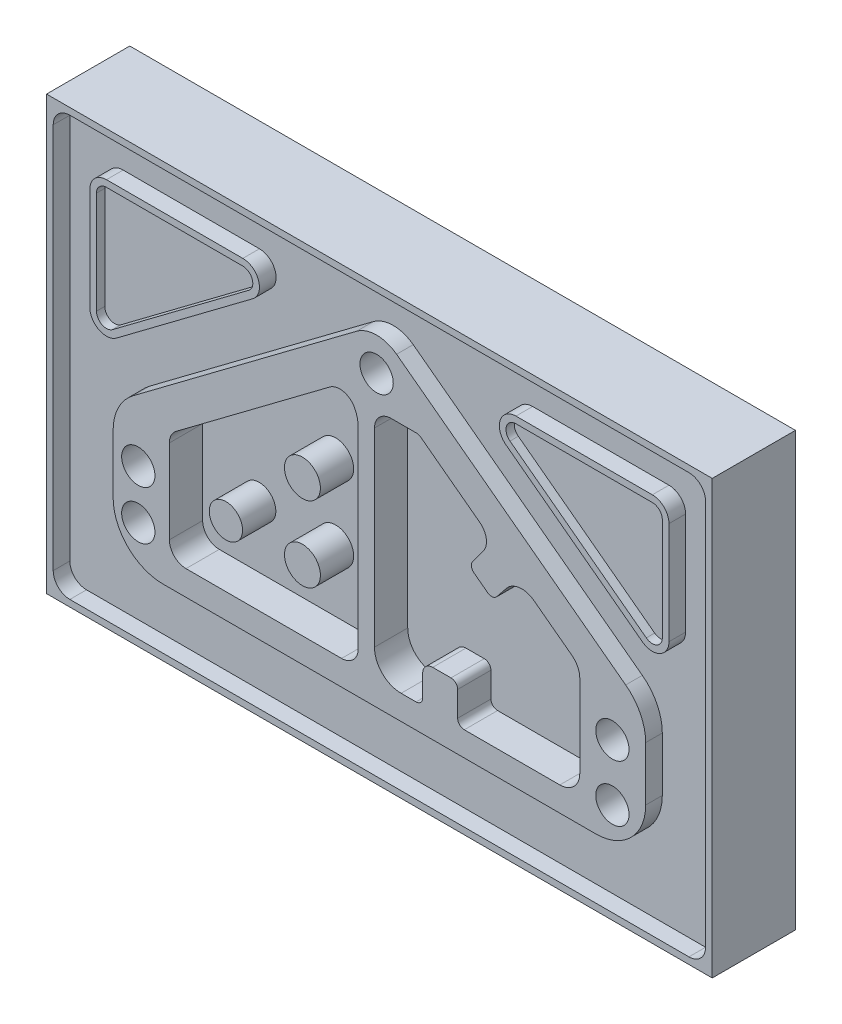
ISO-10303-21;
HEADER;
FILE_DESCRIPTION(('STEP AP214'),'2;1');
FILE_NAME('part.step','',(''),(''),'','','');
FILE_SCHEMA(('AUTOMOTIVE_DESIGN { 1 0 10303 214 1 1 1 1 }'));
ENDSEC;
DATA;
#1=APPLICATION_CONTEXT('core data for automotive mechanical design processes');
#2=APPLICATION_PROTOCOL_DEFINITION('international standard','automotive_design',2000,#1);
#3=PRODUCT_CONTEXT('',#1,'mechanical');
#4=PRODUCT('Part','Part','',(#3));
#5=PRODUCT_RELATED_PRODUCT_CATEGORY('part','',(#4));
#6=PRODUCT_DEFINITION_FORMATION('','',#4);
#7=PRODUCT_DEFINITION_CONTEXT('part definition',#1,'design');
#8=PRODUCT_DEFINITION('design','',#6,#7);
#9=PRODUCT_DEFINITION_SHAPE('','',#8);
#10=(LENGTH_UNIT() NAMED_UNIT(*) SI_UNIT(.MILLI.,.METRE.));
#11=(NAMED_UNIT(*) PLANE_ANGLE_UNIT() SI_UNIT($,.RADIAN.));
#12=(NAMED_UNIT(*) SI_UNIT($,.STERADIAN.) SOLID_ANGLE_UNIT());
#13=UNCERTAINTY_MEASURE_WITH_UNIT(LENGTH_MEASURE(1.E-05),#10,'distance_accuracy_value','');
#14=(GEOMETRIC_REPRESENTATION_CONTEXT(3) GLOBAL_UNCERTAINTY_ASSIGNED_CONTEXT((#13)) GLOBAL_UNIT_ASSIGNED_CONTEXT((#10,
#11,#12)) REPRESENTATION_CONTEXT('',''));
#15=CARTESIAN_POINT('',(0.,0.,0.));
#16=DIRECTION('',(0.,0.,1.));
#17=DIRECTION('',(1.,0.,0.));
#18=AXIS2_PLACEMENT_3D('',#15,#16,#17);
#19=CARTESIAN_POINT('',(-200.,-120.,40.));
#20=DIRECTION('',(0.,0.,-1.));
#21=DIRECTION('',(-1.,0.,0.));
#22=AXIS2_PLACEMENT_3D('',#19,#20,#21);
#23=PLANE('',#22);
#24=CARTESIAN_POINT('',(-186.,126.,40.));
#25=DIRECTION('',(0.,0.,-1.));
#26=DIRECTION('',(-1.,0.,0.));
#27=AXIS2_PLACEMENT_3D('',#24,#25,#26);
#28=CIRCLE('',#27,10.);
#29=CARTESIAN_POINT('',(-196.,126.,40.));
#30=VERTEX_POINT('',#29);
#31=CARTESIAN_POINT('',(-186.,136.,40.));
#32=VERTEX_POINT('',#31);
#33=EDGE_CURVE('E722',#30,#32,#28,.T.);
#34=ORIENTED_EDGE('',*,*,#33,.F.);
#35=DIRECTION('',(0.,-1.,0.));
#36=VECTOR('',#35,1.);
#37=CARTESIAN_POINT('',(-196.,126.,40.));
#38=LINE('',#37,#36);
#39=CARTESIAN_POINT('',(-196.,-106.,40.));
#40=VERTEX_POINT('',#39);
#41=EDGE_CURVE('E757',#30,#40,#38,.T.);
#42=ORIENTED_EDGE('',*,*,#41,.T.);
#43=CARTESIAN_POINT('',(-186.,-106.,40.));
#44=DIRECTION('',(0.,0.,-1.));
#45=DIRECTION('',(-1.,0.,0.));
#46=AXIS2_PLACEMENT_3D('',#43,#44,#45);
#47=CIRCLE('',#46,10.);
#48=CARTESIAN_POINT('',(-186.,-116.,40.));
#49=VERTEX_POINT('',#48);
#50=EDGE_CURVE('E754',#49,#40,#47,.T.);
#51=ORIENTED_EDGE('',*,*,#50,.F.);
#52=DIRECTION('',(1.,0.,0.));
#53=VECTOR('',#52,1.);
#54=CARTESIAN_POINT('',(-186.,-116.,40.));
#55=LINE('',#54,#53);
#56=CARTESIAN_POINT('',(186.,-116.,40.));
#57=VERTEX_POINT('',#56);
#58=EDGE_CURVE('E751',#49,#57,#55,.T.);
#59=ORIENTED_EDGE('',*,*,#58,.T.);
#60=CARTESIAN_POINT('',(186.,-106.,40.));
#61=DIRECTION('',(0.,0.,-1.));
#62=DIRECTION('',(-1.,0.,0.));
#63=AXIS2_PLACEMENT_3D('',#60,#61,#62);
#64=CIRCLE('',#63,10.);
#65=CARTESIAN_POINT('',(196.,-106.,40.));
#66=VERTEX_POINT('',#65);
#67=EDGE_CURVE('E748',#66,#57,#64,.T.);
#68=ORIENTED_EDGE('',*,*,#67,.F.);
#69=DIRECTION('',(0.,1.,0.));
#70=VECTOR('',#69,1.);
#71=CARTESIAN_POINT('',(196.,-106.,40.));
#72=LINE('',#71,#70);
#73=CARTESIAN_POINT('',(196.,126.,40.));
#74=VERTEX_POINT('',#73);
#75=EDGE_CURVE('E745',#66,#74,#72,.T.);
#76=ORIENTED_EDGE('',*,*,#75,.T.);
#77=CARTESIAN_POINT('',(186.,126.,40.));
#78=DIRECTION('',(0.,0.,-1.));
#79=DIRECTION('',(-1.,0.,0.));
#80=AXIS2_PLACEMENT_3D('',#77,#78,#79);
#81=CIRCLE('',#80,10.);
#82=CARTESIAN_POINT('',(186.,136.,40.));
#83=VERTEX_POINT('',#82);
#84=EDGE_CURVE('E742',#83,#74,#81,.T.);
#85=ORIENTED_EDGE('',*,*,#84,.F.);
#86=DIRECTION('',(-1.,0.,0.));
#87=VECTOR('',#86,1.);
#88=CARTESIAN_POINT('',(186.,136.,40.));
#89=LINE('',#88,#87);
#90=EDGE_CURVE('E739',#83,#32,#89,.T.);
#91=ORIENTED_EDGE('',*,*,#90,.T.);
#92=EDGE_LOOP('',(#34,#42,#51,#59,#68,#76,#85,#91));
#93=FACE_BOUND('',#92,.T.);
#94=DIRECTION('',(0.8,0.6,0.));
#95=VECTOR('',#94,1.);
#96=CARTESIAN_POINT('',(-13.6666666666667,109.75,40.));
#97=LINE('',#96,#95);
#98=CARTESIAN_POINT('',(-148.,8.99999999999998,40.));
#99=VERTEX_POINT('',#98);
#100=CARTESIAN_POINT('',(-13.6666666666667,109.75,40.));
#101=VERTEX_POINT('',#100);
#102=EDGE_CURVE('E1155',#99,#101,#97,.T.);
#103=ORIENTED_EDGE('',*,*,#102,.T.);
#104=CARTESIAN_POINT('',(-1.66666666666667,93.75,40.));
#105=DIRECTION('',(0.,0.,-1.));
#106=DIRECTION('',(-1.,0.,0.));
#107=AXIS2_PLACEMENT_3D('',#104,#105,#106);
#108=CIRCLE('',#107,20.);
#109=CARTESIAN_POINT('',(10.3333333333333,109.75,40.));
#110=VERTEX_POINT('',#109);
#111=EDGE_CURVE('E1157',#101,#110,#108,.T.);
#112=ORIENTED_EDGE('',*,*,#111,.T.);
#113=DIRECTION('',(-0.8,0.6,0.));
#114=VECTOR('',#113,1.);
#115=CARTESIAN_POINT('',(10.3333333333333,109.75,40.));
#116=LINE('',#115,#114);
#117=CARTESIAN_POINT('',(148.,6.4999999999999,40.));
#118=VERTEX_POINT('',#117);
#119=EDGE_CURVE('E1215',#118,#110,#116,.T.);
#120=ORIENTED_EDGE('',*,*,#119,.F.);
#121=CARTESIAN_POINT('',(130.,-17.5000000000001,40.));
#122=DIRECTION('',(0.,0.,-1.));
#123=DIRECTION('',(-1.,0.,0.));
#124=AXIS2_PLACEMENT_3D('',#121,#122,#123);
#125=CIRCLE('',#124,30.);
#126=CARTESIAN_POINT('',(160.,-17.5000000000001,40.));
#127=VERTEX_POINT('',#126);
#128=EDGE_CURVE('E1132',#118,#127,#125,.T.);
#129=ORIENTED_EDGE('',*,*,#128,.T.);
#130=DIRECTION('',(0.,1.,0.));
#131=VECTOR('',#130,1.);
#132=CARTESIAN_POINT('',(160.,-17.5000000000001,40.));
#133=LINE('',#132,#131);
#134=CARTESIAN_POINT('',(160.,-50.,40.));
#135=VERTEX_POINT('',#134);
#136=EDGE_CURVE('E1139',#135,#127,#133,.T.);
#137=ORIENTED_EDGE('',*,*,#136,.F.);
#138=CARTESIAN_POINT('',(130.,-50.,40.));
#139=DIRECTION('',(0.,0.,-1.));
#140=DIRECTION('',(-1.,0.,0.));
#141=AXIS2_PLACEMENT_3D('',#138,#139,#140);
#142=CIRCLE('',#141,30.);
#143=CARTESIAN_POINT('',(130.,-80.,40.));
#144=VERTEX_POINT('',#143);
#145=EDGE_CURVE('E1142',#135,#144,#142,.T.);
#146=ORIENTED_EDGE('',*,*,#145,.T.);
#147=DIRECTION('',(1.,0.,0.));
#148=VECTOR('',#147,1.);
#149=CARTESIAN_POINT('',(130.,-80.,40.));
#150=LINE('',#149,#148);
#151=CARTESIAN_POINT('',(-130.,-80.,40.));
#152=VERTEX_POINT('',#151);
#153=EDGE_CURVE('E1144',#152,#144,#150,.T.);
#154=ORIENTED_EDGE('',*,*,#153,.F.);
#155=CARTESIAN_POINT('',(-130.,-50.,40.));
#156=DIRECTION('',(0.,0.,-1.));
#157=DIRECTION('',(-1.,0.,0.));
#158=AXIS2_PLACEMENT_3D('',#155,#156,#157);
#159=CIRCLE('',#158,30.);
#160=CARTESIAN_POINT('',(-160.,-50.,40.));
#161=VERTEX_POINT('',#160);
#162=EDGE_CURVE('E1147',#161,#152,#159,.F.);
#163=ORIENTED_EDGE('',*,*,#162,.F.);
#164=DIRECTION('',(0.,1.,0.));
#165=VECTOR('',#164,1.);
#166=CARTESIAN_POINT('',(-160.,-15.,40.));
#167=LINE('',#166,#165);
#168=CARTESIAN_POINT('',(-160.,-15.,40.));
#169=VERTEX_POINT('',#168);
#170=EDGE_CURVE('E1150',#161,#169,#167,.T.);
#171=ORIENTED_EDGE('',*,*,#170,.T.);
#172=CARTESIAN_POINT('',(-130.,-15.,40.));
#173=DIRECTION('',(0.,0.,-1.));
#174=DIRECTION('',(-1.,0.,0.));
#175=AXIS2_PLACEMENT_3D('',#172,#173,#174);
#176=CIRCLE('',#175,30.);
#177=EDGE_CURVE('E1152',#99,#169,#176,.F.);
#178=ORIENTED_EDGE('',*,*,#177,.F.);
#179=EDGE_LOOP('',(#103,#112,#120,#129,#137,#146,#154,#163,#171,#178));
#180=FACE_BOUND('',#179,.T.);
#181=DIRECTION('',(1.,0.,0.));
#182=VECTOR('',#181,1.);
#183=CARTESIAN_POINT('',(-164.,113.448068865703,40.));
#184=LINE('',#183,#182);
#185=CARTESIAN_POINT('',(-164.,113.448068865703,40.));
#186=VERTEX_POINT('',#185);
#187=CARTESIAN_POINT('',(-82.0692415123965,113.448068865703,40.));
#188=VERTEX_POINT('',#187);
#189=EDGE_CURVE('E700',#186,#188,#184,.T.);
#190=ORIENTED_EDGE('',*,*,#189,.T.);
#191=CARTESIAN_POINT('',(-82.0692415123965,103.448068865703,40.));
#192=DIRECTION('',(0.,0.,-1.));
#193=DIRECTION('',(-1.,0.,0.));
#194=AXIS2_PLACEMENT_3D('',#191,#192,#193);
#195=CIRCLE('',#194,10.);
#196=CARTESIAN_POINT('',(-76.0692415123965,95.4480688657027,40.));
#197=VERTEX_POINT('',#196);
#198=EDGE_CURVE('E688',#188,#197,#195,.T.);
#199=ORIENTED_EDGE('',*,*,#198,.T.);
#200=DIRECTION('',(0.8,0.6,0.));
#201=VECTOR('',#200,1.);
#202=CARTESIAN_POINT('',(-158.,34.,40.));
#203=LINE('',#202,#201);
#204=CARTESIAN_POINT('',(-158.,34.,40.));
#205=VERTEX_POINT('',#204);
#206=EDGE_CURVE('E690',#205,#197,#203,.T.);
#207=ORIENTED_EDGE('',*,*,#206,.F.);
#208=CARTESIAN_POINT('',(-164.,42.,40.));
#209=DIRECTION('',(0.,0.,-1.));
#210=DIRECTION('',(-1.,0.,0.));
#211=AXIS2_PLACEMENT_3D('',#208,#209,#210);
#212=CIRCLE('',#211,10.);
#213=CARTESIAN_POINT('',(-174.,42.,40.));
#214=VERTEX_POINT('',#213);
#215=EDGE_CURVE('E693',#205,#214,#212,.T.);
#216=ORIENTED_EDGE('',*,*,#215,.T.);
#217=DIRECTION('',(0.,-1.,0.));
#218=VECTOR('',#217,1.);
#219=CARTESIAN_POINT('',(-174.,103.448068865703,40.));
#220=LINE('',#219,#218);
#221=CARTESIAN_POINT('',(-174.,103.448068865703,40.));
#222=VERTEX_POINT('',#221);
#223=EDGE_CURVE('E695',#222,#214,#220,.T.);
#224=ORIENTED_EDGE('',*,*,#223,.F.);
#225=CARTESIAN_POINT('',(-164.,103.448068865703,40.));
#226=DIRECTION('',(0.,0.,-1.));
#227=DIRECTION('',(-1.,0.,0.));
#228=AXIS2_PLACEMENT_3D('',#225,#226,#227);
#229=CIRCLE('',#228,9.99999999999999);
#230=EDGE_CURVE('E698',#222,#186,#229,.T.);
#231=ORIENTED_EDGE('',*,*,#230,.T.);
#232=EDGE_LOOP('',(#190,#199,#207,#216,#224,#231));
#233=FACE_BOUND('',#232,.T.);
#234=CARTESIAN_POINT('',(164.,42.,40.));
#235=DIRECTION('',(0.,0.,1.));
#236=DIRECTION('',(1.,0.,0.));
#237=AXIS2_PLACEMENT_3D('',#234,#235,#236);
#238=CIRCLE('',#237,10.);
#239=CARTESIAN_POINT('',(158.,34.,40.));
#240=VERTEX_POINT('',#239);
#241=CARTESIAN_POINT('',(174.,42.,40.));
#242=VERTEX_POINT('',#241);
#243=EDGE_CURVE('E635',#240,#242,#238,.T.);
#244=ORIENTED_EDGE('',*,*,#243,.F.);
#245=DIRECTION('',(-0.8,0.6,0.));
#246=VECTOR('',#245,1.);
#247=CARTESIAN_POINT('',(158.,34.,40.));
#248=LINE('',#247,#246);
#249=CARTESIAN_POINT('',(76.0692415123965,95.4480688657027,40.));
#250=VERTEX_POINT('',#249);
#251=EDGE_CURVE('E656',#240,#250,#248,.T.);
#252=ORIENTED_EDGE('',*,*,#251,.T.);
#253=CARTESIAN_POINT('',(82.0692415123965,103.448068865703,40.));
#254=DIRECTION('',(0.,0.,1.));
#255=DIRECTION('',(1.,0.,0.));
#256=AXIS2_PLACEMENT_3D('',#253,#254,#255);
#257=CIRCLE('',#256,10.);
#258=CARTESIAN_POINT('',(82.0692415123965,113.448068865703,40.));
#259=VERTEX_POINT('',#258);
#260=EDGE_CURVE('E654',#259,#250,#257,.T.);
#261=ORIENTED_EDGE('',*,*,#260,.F.);
#262=DIRECTION('',(-1.,0.,0.));
#263=VECTOR('',#262,1.);
#264=CARTESIAN_POINT('',(164.,113.448068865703,40.));
#265=LINE('',#264,#263);
#266=CARTESIAN_POINT('',(164.,113.448068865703,40.));
#267=VERTEX_POINT('',#266);
#268=EDGE_CURVE('E652',#267,#259,#265,.T.);
#269=ORIENTED_EDGE('',*,*,#268,.F.);
#270=CARTESIAN_POINT('',(164.,103.448068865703,40.));
#271=DIRECTION('',(0.,0.,1.));
#272=DIRECTION('',(1.,0.,0.));
#273=AXIS2_PLACEMENT_3D('',#270,#271,#272);
#274=CIRCLE('',#273,9.99999999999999);
#275=CARTESIAN_POINT('',(174.,103.448068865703,40.));
#276=VERTEX_POINT('',#275);
#277=EDGE_CURVE('E650',#276,#267,#274,.T.);
#278=ORIENTED_EDGE('',*,*,#277,.F.);
#279=DIRECTION('',(0.,-1.,0.));
#280=VECTOR('',#279,1.);
#281=CARTESIAN_POINT('',(174.,103.448068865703,40.));
#282=LINE('',#281,#280);
#283=EDGE_CURVE('E647',#276,#242,#282,.T.);
#284=ORIENTED_EDGE('',*,*,#283,.T.);
#285=EDGE_LOOP('',(#244,#252,#261,#269,#278,#284));
#286=FACE_BOUND('',#285,.T.);
#287=ADVANCED_FACE('F38',(#93,#180,#233,#286),#23,.F.);
#288=CARTESIAN_POINT('',(-116.203922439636,-4.65294182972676,30.));
#289=DIRECTION('',(0.,0.,-1.));
#290=DIRECTION('',(-1.,0.,0.));
#291=AXIS2_PLACEMENT_3D('',#288,#289,#290);
#292=PLANE('',#291);
#293=CARTESIAN_POINT('',(-46.2461760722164,-28.1717671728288,30.));
#294=DIRECTION('',(0.,0.,-1.));
#295=DIRECTION('',(-1.,0.,0.));
#296=AXIS2_PLACEMENT_3D('',#293,#294,#295);
#297=CIRCLE('',#296,10.7866026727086);
#298=CARTESIAN_POINT('',(-57.0327787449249,-28.1717671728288,30.));
#299=VERTEX_POINT('',#298);
#300=EDGE_CURVE('E46',#299,#299,#297,.F.);
#301=ORIENTED_EDGE('',*,*,#300,.F.);
#302=EDGE_LOOP('',(#301));
#303=FACE_BOUND('',#302,.T.);
#304=CARTESIAN_POINT('',(-116.203922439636,-4.65294182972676,30.));
#305=DIRECTION('',(0.,0.,-1.));
#306=DIRECTION('',(-1.,0.,0.));
#307=AXIS2_PLACEMENT_3D('',#304,#305,#306);
#308=CIRCLE('',#307,10.);
#309=CARTESIAN_POINT('',(-126.203922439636,-4.65294182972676,30.));
#310=VERTEX_POINT('',#309);
#311=CARTESIAN_POINT('',(-122.203922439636,3.34705817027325,30.));
#312=VERTEX_POINT('',#311);
#313=EDGE_CURVE('E1074',#310,#312,#308,.T.);
#314=ORIENTED_EDGE('',*,*,#313,.F.);
#315=DIRECTION('',(0.,-1.,0.));
#316=VECTOR('',#315,1.);
#317=CARTESIAN_POINT('',(-126.203922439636,-4.65294182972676,30.));
#318=LINE('',#317,#316);
#319=CARTESIAN_POINT('',(-126.203922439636,-55.0614367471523,30.));
#320=VERTEX_POINT('',#319);
#321=EDGE_CURVE('E1095',#310,#320,#318,.T.);
#322=ORIENTED_EDGE('',*,*,#321,.T.);
#323=CARTESIAN_POINT('',(-116.203922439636,-55.0614367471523,30.));
#324=DIRECTION('',(0.,0.,-1.));
#325=DIRECTION('',(-1.,0.,0.));
#326=AXIS2_PLACEMENT_3D('',#323,#324,#325);
#327=CIRCLE('',#326,9.99999999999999);
#328=CARTESIAN_POINT('',(-116.203922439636,-65.0614367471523,30.));
#329=VERTEX_POINT('',#328);
#330=EDGE_CURVE('E1093',#329,#320,#327,.T.);
#331=ORIENTED_EDGE('',*,*,#330,.F.);
#332=DIRECTION('',(1.,0.,0.));
#333=VECTOR('',#332,1.);
#334=CARTESIAN_POINT('',(-116.203922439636,-65.0614367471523,30.));
#335=LINE('',#334,#333);
#336=CARTESIAN_POINT('',(-22.7291877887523,-65.0614367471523,30.));
#337=VERTEX_POINT('',#336);
#338=EDGE_CURVE('E1090',#329,#337,#335,.T.);
#339=ORIENTED_EDGE('',*,*,#338,.T.);
#340=CARTESIAN_POINT('',(-22.7291877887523,-55.0614367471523,30.));
#341=DIRECTION('',(0.,0.,1.));
#342=DIRECTION('',(1.,0.,0.));
#343=AXIS2_PLACEMENT_3D('',#340,#341,#342);
#344=CIRCLE('',#343,10.);
#345=CARTESIAN_POINT('',(-12.7291877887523,-55.0614367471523,30.));
#346=VERTEX_POINT('',#345);
#347=EDGE_CURVE('E1087',#337,#346,#344,.T.);
#348=ORIENTED_EDGE('',*,*,#347,.T.);
#349=DIRECTION('',(0.,1.,0.));
#350=VECTOR('',#349,1.);
#351=CARTESIAN_POINT('',(-12.7291877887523,-55.0614367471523,30.));
#352=LINE('',#351,#350);
#353=CARTESIAN_POINT('',(-12.7291877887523,60.200563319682,30.));
#354=VERTEX_POINT('',#353);
#355=EDGE_CURVE('E1084',#346,#354,#352,.T.);
#356=ORIENTED_EDGE('',*,*,#355,.T.);
#357=CARTESIAN_POINT('',(-32.7291877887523,60.200563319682,30.));
#358=DIRECTION('',(0.,0.,1.));
#359=DIRECTION('',(1.,0.,0.));
#360=AXIS2_PLACEMENT_3D('',#357,#358,#359);
#361=CIRCLE('',#360,20.);
#362=CARTESIAN_POINT('',(-14.8323700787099,69.1282682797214,30.));
#363=VERTEX_POINT('',#362);
#364=EDGE_CURVE('E1081',#354,#363,#361,.T.);
#365=ORIENTED_EDGE('',*,*,#364,.T.);
#366=CARTESIAN_POINT('',(-23.7807789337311,64.6644157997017,30.));
#367=DIRECTION('',(0.,0.,-1.));
#368=DIRECTION('',(-1.,0.,0.));
#369=AXIS2_PLACEMENT_3D('',#366,#367,#368);
#370=CIRCLE('',#369,9.99999999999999);
#371=CARTESIAN_POINT('',(-29.7807789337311,72.6644157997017,30.));
#372=VERTEX_POINT('',#371);
#373=EDGE_CURVE('E1079',#372,#363,#370,.T.);
#374=ORIENTED_EDGE('',*,*,#373,.F.);
#375=DIRECTION('',(-0.8,-0.6,0.));
#376=VECTOR('',#375,1.);
#377=CARTESIAN_POINT('',(-29.7807789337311,72.6644157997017,30.));
#378=LINE('',#377,#376);
#379=EDGE_CURVE('E1076',#372,#312,#378,.T.);
#380=ORIENTED_EDGE('',*,*,#379,.T.);
#381=EDGE_LOOP('',(#314,#322,#331,#339,#348,#356,#365,#374,#380));
#382=FACE_BOUND('',#381,.T.);
#383=CARTESIAN_POINT('',(-46.2461760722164,17.1616138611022,30.));
#384=DIRECTION('',(0.,0.,-1.));
#385=DIRECTION('',(-1.,0.,0.));
#386=AXIS2_PLACEMENT_3D('',#383,#384,#385);
#387=CIRCLE('',#386,10.7866026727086);
#388=CARTESIAN_POINT('',(-57.0327787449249,17.1616138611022,30.));
#389=VERTEX_POINT('',#388);
#390=EDGE_CURVE('E1218',#389,#389,#387,.F.);
#391=ORIENTED_EDGE('',*,*,#390,.F.);
#392=EDGE_LOOP('',(#391));
#393=FACE_BOUND('',#392,.T.);
#394=CARTESIAN_POINT('',(-92.2224947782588,-28.1717671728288,30.));
#395=DIRECTION('',(0.,0.,-1.));
#396=DIRECTION('',(-1.,0.,0.));
#397=AXIS2_PLACEMENT_3D('',#394,#395,#396);
#398=CIRCLE('',#397,10.);
#399=CARTESIAN_POINT('',(-102.222494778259,-28.1717671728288,30.));
#400=VERTEX_POINT('',#399);
#401=EDGE_CURVE('E11',#400,#400,#398,.F.);
#402=ORIENTED_EDGE('',*,*,#401,.F.);
#403=EDGE_LOOP('',(#402));
#404=FACE_BOUND('',#403,.T.);
#405=ADVANCED_FACE('F1225',(#303,#382,#393,#404),#292,.F.);
#406=CARTESIAN_POINT('',(-1.66666666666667,93.75,50.));
#407=DIRECTION('',(0.,0.,1.));
#408=DIRECTION('',(1.,0.,0.));
#409=AXIS2_PLACEMENT_3D('',#406,#407,#408);
#410=PLANE('',#409);
#411=CARTESIAN_POINT('',(-1.66666666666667,93.75,50.));
#412=DIRECTION('',(0.,0.,1.));
#413=DIRECTION('',(1.,0.,0.));
#414=AXIS2_PLACEMENT_3D('',#411,#412,#413);
#415=CIRCLE('',#414,9.99999999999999);
#416=CARTESIAN_POINT('',(8.33333333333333,93.75,50.));
#417=VERTEX_POINT('',#416);
#418=EDGE_CURVE('E817',#417,#417,#415,.T.);
#419=ORIENTED_EDGE('',*,*,#418,.F.);
#420=EDGE_LOOP('',(#419));
#421=FACE_BOUND('',#420,.T.);
#422=CARTESIAN_POINT('',(140.,-60.,50.));
#423=DIRECTION('',(0.,0.,1.));
#424=DIRECTION('',(1.,0.,0.));
#425=AXIS2_PLACEMENT_3D('',#422,#423,#424);
#426=CIRCLE('',#425,9.99999999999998);
#427=CARTESIAN_POINT('',(150.,-60.,50.));
#428=VERTEX_POINT('',#427);
#429=EDGE_CURVE('E823',#428,#428,#426,.T.);
#430=ORIENTED_EDGE('',*,*,#429,.F.);
#431=EDGE_LOOP('',(#430));
#432=FACE_BOUND('',#431,.T.);
#433=CARTESIAN_POINT('',(140.,-26.0833707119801,50.));
#434=DIRECTION('',(0.,0.,1.));
#435=DIRECTION('',(1.,0.,0.));
#436=AXIS2_PLACEMENT_3D('',#433,#434,#435);
#437=CIRCLE('',#436,9.99999999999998);
#438=CARTESIAN_POINT('',(150.,-26.0833707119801,50.));
#439=VERTEX_POINT('',#438);
#440=EDGE_CURVE('E829',#439,#439,#437,.T.);
#441=ORIENTED_EDGE('',*,*,#440,.F.);
#442=EDGE_LOOP('',(#441));
#443=FACE_BOUND('',#442,.T.);
#444=CARTESIAN_POINT('',(-144.880429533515,-55.4542610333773,50.));
#445=DIRECTION('',(0.,0.,1.));
#446=DIRECTION('',(1.,0.,0.));
#447=AXIS2_PLACEMENT_3D('',#444,#445,#446);
#448=CIRCLE('',#447,10.);
#449=CARTESIAN_POINT('',(-134.880429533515,-55.4542610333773,50.));
#450=VERTEX_POINT('',#449);
#451=EDGE_CURVE('E835',#450,#450,#448,.T.);
#452=ORIENTED_EDGE('',*,*,#451,.F.);
#453=EDGE_LOOP('',(#452));
#454=FACE_BOUND('',#453,.T.);
#455=CARTESIAN_POINT('',(-144.880429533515,-26.0833707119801,50.));
#456=DIRECTION('',(0.,0.,1.));
#457=DIRECTION('',(1.,0.,0.));
#458=AXIS2_PLACEMENT_3D('',#455,#456,#457);
#459=CIRCLE('',#458,9.99999999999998);
#460=CARTESIAN_POINT('',(-134.880429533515,-26.0833707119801,50.));
#461=VERTEX_POINT('',#460);
#462=EDGE_CURVE('E841',#461,#461,#459,.T.);
#463=ORIENTED_EDGE('',*,*,#462,.F.);
#464=EDGE_LOOP('',(#463));
#465=FACE_BOUND('',#464,.T.);
#466=DIRECTION('',(0.,-1.,0.));
#467=VECTOR('',#466,1.);
#468=CARTESIAN_POINT('',(-126.203922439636,-4.65294182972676,50.));
#469=LINE('',#468,#467);
#470=CARTESIAN_POINT('',(-126.203922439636,-4.65294182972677,50.));
#471=VERTEX_POINT('',#470);
#472=CARTESIAN_POINT('',(-126.203922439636,-55.0614367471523,50.));
#473=VERTEX_POINT('',#472);
#474=EDGE_CURVE('E1071',#471,#473,#469,.T.);
#475=ORIENTED_EDGE('',*,*,#474,.F.);
#476=CARTESIAN_POINT('',(-116.203922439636,-4.65294182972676,50.));
#477=DIRECTION('',(0.,0.,-1.));
#478=DIRECTION('',(-1.,0.,0.));
#479=AXIS2_PLACEMENT_3D('',#476,#477,#478);
#480=CIRCLE('',#479,10.);
#481=CARTESIAN_POINT('',(-122.203922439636,3.34705817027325,50.));
#482=VERTEX_POINT('',#481);
#483=EDGE_CURVE('E1047',#471,#482,#480,.T.);
#484=ORIENTED_EDGE('',*,*,#483,.T.);
#485=DIRECTION('',(-0.8,-0.6,0.));
#486=VECTOR('',#485,1.);
#487=CARTESIAN_POINT('',(-29.7807789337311,72.6644157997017,50.));
#488=LINE('',#487,#486);
#489=CARTESIAN_POINT('',(-29.7807789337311,72.6644157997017,50.));
#490=VERTEX_POINT('',#489);
#491=EDGE_CURVE('E1050',#490,#482,#488,.T.);
#492=ORIENTED_EDGE('',*,*,#491,.F.);
#493=CARTESIAN_POINT('',(-23.7807789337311,64.6644157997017,50.));
#494=DIRECTION('',(0.,0.,-1.));
#495=DIRECTION('',(-1.,0.,0.));
#496=AXIS2_PLACEMENT_3D('',#493,#494,#495);
#497=CIRCLE('',#496,9.99999999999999);
#498=CARTESIAN_POINT('',(-14.8323700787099,69.1282682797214,50.));
#499=VERTEX_POINT('',#498);
#500=EDGE_CURVE('E1053',#490,#499,#497,.T.);
#501=ORIENTED_EDGE('',*,*,#500,.T.);
#502=CARTESIAN_POINT('',(-32.7291877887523,60.200563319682,50.));
#503=DIRECTION('',(0.,0.,1.));
#504=DIRECTION('',(1.,0.,0.));
#505=AXIS2_PLACEMENT_3D('',#502,#503,#504);
#506=CIRCLE('',#505,20.);
#507=CARTESIAN_POINT('',(-12.7291877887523,60.200563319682,50.));
#508=VERTEX_POINT('',#507);
#509=EDGE_CURVE('E1056',#508,#499,#506,.T.);
#510=ORIENTED_EDGE('',*,*,#509,.F.);
#511=DIRECTION('',(0.,1.,0.));
#512=VECTOR('',#511,1.);
#513=CARTESIAN_POINT('',(-12.7291877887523,-55.0614367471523,50.));
#514=LINE('',#513,#512);
#515=CARTESIAN_POINT('',(-12.7291877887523,-55.0614367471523,50.));
#516=VERTEX_POINT('',#515);
#517=EDGE_CURVE('E1059',#516,#508,#514,.T.);
#518=ORIENTED_EDGE('',*,*,#517,.F.);
#519=CARTESIAN_POINT('',(-22.7291877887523,-55.0614367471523,50.));
#520=DIRECTION('',(0.,0.,1.));
#521=DIRECTION('',(1.,0.,0.));
#522=AXIS2_PLACEMENT_3D('',#519,#520,#521);
#523=CIRCLE('',#522,10.);
#524=CARTESIAN_POINT('',(-22.7291877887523,-65.0614367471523,50.));
#525=VERTEX_POINT('',#524);
#526=EDGE_CURVE('E1062',#525,#516,#523,.T.);
#527=ORIENTED_EDGE('',*,*,#526,.F.);
#528=DIRECTION('',(1.,0.,0.));
#529=VECTOR('',#528,1.);
#530=CARTESIAN_POINT('',(-116.203922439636,-65.0614367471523,50.));
#531=LINE('',#530,#529);
#532=CARTESIAN_POINT('',(-116.203922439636,-65.0614367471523,50.));
#533=VERTEX_POINT('',#532);
#534=EDGE_CURVE('E1065',#533,#525,#531,.T.);
#535=ORIENTED_EDGE('',*,*,#534,.F.);
#536=CARTESIAN_POINT('',(-116.203922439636,-55.0614367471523,50.));
#537=DIRECTION('',(0.,0.,-1.));
#538=DIRECTION('',(-1.,0.,0.));
#539=AXIS2_PLACEMENT_3D('',#536,#537,#538);
#540=CIRCLE('',#539,9.99999999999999);
#541=EDGE_CURVE('E1068',#533,#473,#540,.T.);
#542=ORIENTED_EDGE('',*,*,#541,.T.);
#543=EDGE_LOOP('',(#475,#484,#492,#501,#510,#518,#527,#535,#542));
#544=FACE_BOUND('',#543,.T.);
#545=CARTESIAN_POINT('',(-1.66666666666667,93.75,50.));
#546=DIRECTION('',(0.,0.,1.));
#547=DIRECTION('',(1.,0.,0.));
#548=AXIS2_PLACEMENT_3D('',#545,#546,#547);
#549=CIRCLE('',#548,20.);
#550=CARTESIAN_POINT('',(10.3333333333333,109.75,50.));
#551=VERTEX_POINT('',#550);
#552=CARTESIAN_POINT('',(-13.6666666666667,109.75,50.));
#553=VERTEX_POINT('',#552);
#554=EDGE_CURVE('E1159',#551,#553,#549,.T.);
#555=ORIENTED_EDGE('',*,*,#554,.T.);
#556=DIRECTION('',(-0.8,-0.6,0.));
#557=VECTOR('',#556,1.);
#558=CARTESIAN_POINT('',(-13.6666666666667,109.75,50.));
#559=LINE('',#558,#557);
#560=CARTESIAN_POINT('',(-148.,8.99999999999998,50.));
#561=VERTEX_POINT('',#560);
#562=EDGE_CURVE('E1162',#553,#561,#559,.T.);
#563=ORIENTED_EDGE('',*,*,#562,.T.);
#564=CARTESIAN_POINT('',(-130.,-15.,50.));
#565=DIRECTION('',(0.,0.,-1.));
#566=DIRECTION('',(-1.,0.,0.));
#567=AXIS2_PLACEMENT_3D('',#564,#565,#566);
#568=CIRCLE('',#567,30.);
#569=CARTESIAN_POINT('',(-160.,-15.,50.));
#570=VERTEX_POINT('',#569);
#571=EDGE_CURVE('E1164',#570,#561,#568,.T.);
#572=ORIENTED_EDGE('',*,*,#571,.F.);
#573=DIRECTION('',(0.,-1.,0.));
#574=VECTOR('',#573,1.);
#575=CARTESIAN_POINT('',(-160.,-15.,50.));
#576=LINE('',#575,#574);
#577=CARTESIAN_POINT('',(-160.,-50.,50.));
#578=VERTEX_POINT('',#577);
#579=EDGE_CURVE('E1167',#570,#578,#576,.T.);
#580=ORIENTED_EDGE('',*,*,#579,.T.);
#581=CARTESIAN_POINT('',(-130.,-50.,50.));
#582=DIRECTION('',(0.,0.,-1.));
#583=DIRECTION('',(-1.,0.,0.));
#584=AXIS2_PLACEMENT_3D('',#581,#582,#583);
#585=CIRCLE('',#584,30.);
#586=CARTESIAN_POINT('',(-130.,-80.,50.));
#587=VERTEX_POINT('',#586);
#588=EDGE_CURVE('E1169',#587,#578,#585,.T.);
#589=ORIENTED_EDGE('',*,*,#588,.F.);
#590=DIRECTION('',(-1.,0.,0.));
#591=VECTOR('',#590,1.);
#592=CARTESIAN_POINT('',(130.,-80.,50.));
#593=LINE('',#592,#591);
#594=CARTESIAN_POINT('',(130.,-80.,50.));
#595=VERTEX_POINT('',#594);
#596=EDGE_CURVE('E1172',#595,#587,#593,.T.);
#597=ORIENTED_EDGE('',*,*,#596,.F.);
#598=CARTESIAN_POINT('',(130.,-50.,50.));
#599=DIRECTION('',(0.,0.,1.));
#600=DIRECTION('',(1.,0.,0.));
#601=AXIS2_PLACEMENT_3D('',#598,#599,#600);
#602=CIRCLE('',#601,30.);
#603=CARTESIAN_POINT('',(160.,-50.,50.));
#604=VERTEX_POINT('',#603);
#605=EDGE_CURVE('E1175',#595,#604,#602,.T.);
#606=ORIENTED_EDGE('',*,*,#605,.T.);
#607=DIRECTION('',(0.,-1.,0.));
#608=VECTOR('',#607,1.);
#609=CARTESIAN_POINT('',(160.,-17.5000000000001,50.));
#610=LINE('',#609,#608);
#611=CARTESIAN_POINT('',(160.,-17.5000000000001,50.));
#612=VERTEX_POINT('',#611);
#613=EDGE_CURVE('E1177',#612,#604,#610,.T.);
#614=ORIENTED_EDGE('',*,*,#613,.F.);
#615=CARTESIAN_POINT('',(130.,-17.5000000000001,50.));
#616=DIRECTION('',(0.,0.,1.));
#617=DIRECTION('',(1.,0.,0.));
#618=AXIS2_PLACEMENT_3D('',#615,#616,#617);
#619=CIRCLE('',#618,30.);
#620=CARTESIAN_POINT('',(148.,6.4999999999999,50.));
#621=VERTEX_POINT('',#620);
#622=EDGE_CURVE('E1180',#612,#621,#619,.T.);
#623=ORIENTED_EDGE('',*,*,#622,.T.);
#624=DIRECTION('',(0.8,-0.6,0.));
#625=VECTOR('',#624,1.);
#626=CARTESIAN_POINT('',(10.3333333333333,109.75,50.));
#627=LINE('',#626,#625);
#628=EDGE_CURVE('E1182',#551,#621,#627,.T.);
#629=ORIENTED_EDGE('',*,*,#628,.F.);
#630=EDGE_LOOP('',(#555,#563,#572,#580,#589,#597,#606,#614,#623,#629));
#631=FACE_BOUND('',#630,.T.);
#632=DIRECTION('',(0.,-1.,0.));
#633=VECTOR('',#632,1.);
#634=CARTESIAN_POINT('',(-2.96909768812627,64.723935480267,50.));
#635=LINE('',#634,#633);
#636=CARTESIAN_POINT('',(-2.96909768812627,64.723935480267,50.));
#637=VERTEX_POINT('',#636);
#638=CARTESIAN_POINT('',(-2.96909768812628,-49.3196764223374,50.));
#639=VERTEX_POINT('',#638);
#640=EDGE_CURVE('E922',#637,#639,#635,.T.);
#641=ORIENTED_EDGE('',*,*,#640,.F.);
#642=CARTESIAN_POINT('',(7.03090231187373,64.723935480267,50.));
#643=DIRECTION('',(0.,0.,-1.));
#644=DIRECTION('',(-1.,0.,0.));
#645=AXIS2_PLACEMENT_3D('',#642,#643,#644);
#646=CIRCLE('',#645,9.99999999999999);
#647=CARTESIAN_POINT('',(7.03090231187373,74.723935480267,50.));
#648=VERTEX_POINT('',#647);
#649=EDGE_CURVE('E847',#637,#648,#646,.T.);
#650=ORIENTED_EDGE('',*,*,#649,.T.);
#651=DIRECTION('',(1.,0.,0.));
#652=VECTOR('',#651,1.);
#653=CARTESIAN_POINT('',(7.03090231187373,74.723935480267,50.));
#654=LINE('',#653,#652);
#655=CARTESIAN_POINT('',(22.3680860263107,74.723935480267,50.));
#656=VERTEX_POINT('',#655);
#657=EDGE_CURVE('E850',#648,#656,#654,.T.);
#658=ORIENTED_EDGE('',*,*,#657,.T.);
#659=CARTESIAN_POINT('',(22.3680860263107,70.723935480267,50.));
#660=DIRECTION('',(0.,0.,-1.));
#661=DIRECTION('',(-1.,0.,0.));
#662=AXIS2_PLACEMENT_3D('',#659,#660,#661);
#663=CIRCLE('',#662,4.00000000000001);
#664=CARTESIAN_POINT('',(24.7680860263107,73.923935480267,50.));
#665=VERTEX_POINT('',#664);
#666=EDGE_CURVE('E853',#656,#665,#663,.T.);
#667=ORIENTED_EDGE('',*,*,#666,.T.);
#668=DIRECTION('',(0.8,-0.6,0.));
#669=VECTOR('',#668,1.);
#670=CARTESIAN_POINT('',(24.7680860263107,73.923935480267,50.));
#671=LINE('',#670,#669);
#672=CARTESIAN_POINT('',(60.3439563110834,47.2420327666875,50.));
#673=VERTEX_POINT('',#672);
#674=EDGE_CURVE('E856',#665,#673,#671,.T.);
#675=ORIENTED_EDGE('',*,*,#674,.T.);
#676=CARTESIAN_POINT('',(54.3439563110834,39.2420327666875,50.));
#677=DIRECTION('',(0.,0.,1.));
#678=DIRECTION('',(1.,0.,0.));
#679=AXIS2_PLACEMENT_3D('',#676,#677,#678);
#680=CIRCLE('',#679,9.99999999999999);
#681=CARTESIAN_POINT('',(62.3439563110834,33.2420327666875,50.));
#682=VERTEX_POINT('',#681);
#683=EDGE_CURVE('E859',#682,#673,#680,.T.);
#684=ORIENTED_EDGE('',*,*,#683,.F.);
#685=DIRECTION('',(-0.600000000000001,-0.8,0.));
#686=VECTOR('',#685,1.);
#687=CARTESIAN_POINT('',(62.3439563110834,33.2420327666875,50.));
#688=LINE('',#687,#686);
#689=CARTESIAN_POINT('',(56.0300141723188,24.8234432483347,50.));
#690=VERTEX_POINT('',#689);
#691=EDGE_CURVE('E862',#682,#690,#688,.T.);
#692=ORIENTED_EDGE('',*,*,#691,.T.);
#693=CARTESIAN_POINT('',(59.2300141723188,22.4234432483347,50.));
#694=DIRECTION('',(0.,0.,-1.));
#695=DIRECTION('',(-1.,0.,0.));
#696=AXIS2_PLACEMENT_3D('',#693,#694,#695);
#697=CIRCLE('',#696,4.);
#698=CARTESIAN_POINT('',(56.8300141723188,19.2234432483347,50.));
#699=VERTEX_POINT('',#698);
#700=EDGE_CURVE('E865',#699,#690,#697,.T.);
#701=ORIENTED_EDGE('',*,*,#700,.F.);
#702=DIRECTION('',(0.8,-0.6,0.));
#703=VECTOR('',#702,1.);
#704=CARTESIAN_POINT('',(56.8300141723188,19.2234432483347,50.));
#705=LINE('',#704,#703);
#706=CARTESIAN_POINT('',(65.0483268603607,13.0597087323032,50.));
#707=VERTEX_POINT('',#706);
#708=EDGE_CURVE('E868',#699,#707,#705,.T.);
#709=ORIENTED_EDGE('',*,*,#708,.T.);
#710=CARTESIAN_POINT('',(67.4483268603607,16.2597087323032,50.));
#711=DIRECTION('',(0.,0.,-1.));
#712=DIRECTION('',(-1.,0.,0.));
#713=AXIS2_PLACEMENT_3D('',#710,#711,#712);
#714=CIRCLE('',#713,4.);
#715=CARTESIAN_POINT('',(70.571566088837,13.7606335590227,50.));
#716=VERTEX_POINT('',#715);
#717=EDGE_CURVE('E871',#716,#707,#714,.T.);
#718=ORIENTED_EDGE('',*,*,#717,.F.);
#719=DIRECTION('',(0.624768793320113,0.780809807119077,0.));
#720=VECTOR('',#719,1.);
#721=CARTESIAN_POINT('',(70.571566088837,13.7606335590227,50.));
#722=LINE('',#721,#720);
#723=CARTESIAN_POINT('',(76.2125631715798,20.8105148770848,50.));
#724=VERTEX_POINT('',#723);
#725=EDGE_CURVE('E874',#716,#724,#722,.T.);
#726=ORIENTED_EDGE('',*,*,#725,.T.);
#727=CARTESIAN_POINT('',(85.5822808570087,13.3132893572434,50.));
#728=DIRECTION('',(0.,0.,1.));
#729=DIRECTION('',(1.,0.,0.));
#730=AXIS2_PLACEMENT_3D('',#727,#728,#729);
#731=CIRCLE('',#730,12.);
#732=CARTESIAN_POINT('',(92.7822808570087,22.9132893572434,50.));
#733=VERTEX_POINT('',#732);
#734=EDGE_CURVE('E877',#733,#724,#731,.T.);
#735=ORIENTED_EDGE('',*,*,#734,.F.);
#736=DIRECTION('',(0.8,-0.6,0.));
#737=VECTOR('',#736,1.);
#738=CARTESIAN_POINT('',(92.7822808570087,22.9132893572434,50.));
#739=LINE('',#738,#737);
#740=CARTESIAN_POINT('',(115.617947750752,5.78653918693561,50.));
#741=VERTEX_POINT('',#740);
#742=EDGE_CURVE('E880',#733,#741,#739,.T.);
#743=ORIENTED_EDGE('',*,*,#742,.T.);
#744=CARTESIAN_POINT('',(108.417947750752,-3.81346081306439,50.));
#745=DIRECTION('',(0.,0.,1.));
#746=DIRECTION('',(1.,0.,0.));
#747=AXIS2_PLACEMENT_3D('',#744,#745,#746);
#748=CIRCLE('',#747,12.);
#749=CARTESIAN_POINT('',(120.417947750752,-3.8134608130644,50.));
#750=VERTEX_POINT('',#749);
#751=EDGE_CURVE('E883',#750,#741,#748,.T.);
#752=ORIENTED_EDGE('',*,*,#751,.F.);
#753=DIRECTION('',(0.,-1.,0.));
#754=VECTOR('',#753,1.);
#755=CARTESIAN_POINT('',(120.417947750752,-3.8134608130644,50.));
#756=LINE('',#755,#754);
#757=CARTESIAN_POINT('',(120.417947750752,-53.3196764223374,50.));
#758=VERTEX_POINT('',#757);
#759=EDGE_CURVE('E886',#750,#758,#756,.T.);
#760=ORIENTED_EDGE('',*,*,#759,.T.);
#761=CARTESIAN_POINT('',(108.417947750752,-53.3196764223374,50.));
#762=DIRECTION('',(0.,0.,1.));
#763=DIRECTION('',(1.,0.,0.));
#764=AXIS2_PLACEMENT_3D('',#761,#762,#763);
#765=CIRCLE('',#764,12.);
#766=CARTESIAN_POINT('',(108.417947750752,-65.3196764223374,50.));
#767=VERTEX_POINT('',#766);
#768=EDGE_CURVE('E889',#767,#758,#765,.T.);
#769=ORIENTED_EDGE('',*,*,#768,.F.);
#770=DIRECTION('',(1.,0.,0.));
#771=VECTOR('',#770,1.);
#772=CARTESIAN_POINT('',(51.0119233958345,-65.3196764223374,50.));
#773=LINE('',#772,#771);
#774=CARTESIAN_POINT('',(51.0119233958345,-65.3196764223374,50.));
#775=VERTEX_POINT('',#774);
#776=EDGE_CURVE('E892',#775,#767,#773,.T.);
#777=ORIENTED_EDGE('',*,*,#776,.F.);
#778=CARTESIAN_POINT('',(51.0119233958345,-61.3196764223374,50.));
#779=DIRECTION('',(0.,0.,-1.));
#780=DIRECTION('',(-1.,0.,0.));
#781=AXIS2_PLACEMENT_3D('',#778,#779,#780);
#782=CIRCLE('',#781,4.);
#783=CARTESIAN_POINT('',(47.0119233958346,-61.3196764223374,50.));
#784=VERTEX_POINT('',#783);
#785=EDGE_CURVE('E895',#775,#784,#782,.T.);
#786=ORIENTED_EDGE('',*,*,#785,.T.);
#787=DIRECTION('',(0.,-1.,0.));
#788=VECTOR('',#787,1.);
#789=CARTESIAN_POINT('',(47.0119233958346,-46.3196764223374,50.));
#790=LINE('',#789,#788);
#791=CARTESIAN_POINT('',(47.0119233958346,-46.3196764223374,50.));
#792=VERTEX_POINT('',#791);
#793=EDGE_CURVE('E898',#792,#784,#790,.T.);
#794=ORIENTED_EDGE('',*,*,#793,.F.);
#795=CARTESIAN_POINT('',(43.0119233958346,-46.3196764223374,50.));
#796=DIRECTION('',(0.,0.,-1.));
#797=DIRECTION('',(-1.,0.,0.));
#798=AXIS2_PLACEMENT_3D('',#795,#796,#797);
#799=CIRCLE('',#798,4.);
#800=CARTESIAN_POINT('',(43.0119233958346,-42.3196764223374,50.));
#801=VERTEX_POINT('',#800);
#802=EDGE_CURVE('E901',#801,#792,#799,.T.);
#803=ORIENTED_EDGE('',*,*,#802,.F.);
#804=DIRECTION('',(1.,0.,0.));
#805=VECTOR('',#804,1.);
#806=CARTESIAN_POINT('',(32.0119233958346,-42.3196764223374,50.));
#807=LINE('',#806,#805);
#808=CARTESIAN_POINT('',(32.0119233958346,-42.3196764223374,50.));
#809=VERTEX_POINT('',#808);
#810=EDGE_CURVE('E904',#809,#801,#807,.T.);
#811=ORIENTED_EDGE('',*,*,#810,.F.);
#812=CARTESIAN_POINT('',(32.0119233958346,-48.3196764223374,50.));
#813=DIRECTION('',(0.,0.,-1.));
#814=DIRECTION('',(-1.,0.,0.));
#815=AXIS2_PLACEMENT_3D('',#812,#813,#814);
#816=CIRCLE('',#815,5.99999999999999);
#817=CARTESIAN_POINT('',(26.0119233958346,-48.3196764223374,50.));
#818=VERTEX_POINT('',#817);
#819=EDGE_CURVE('E907',#818,#809,#816,.T.);
#820=ORIENTED_EDGE('',*,*,#819,.F.);
#821=DIRECTION('',(0.,1.,0.));
#822=VECTOR('',#821,1.);
#823=CARTESIAN_POINT('',(26.0119233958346,-61.3196764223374,50.));
#824=LINE('',#823,#822);
#825=CARTESIAN_POINT('',(26.0119233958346,-61.3196764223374,50.));
#826=VERTEX_POINT('',#825);
#827=EDGE_CURVE('E910',#826,#818,#824,.T.);
#828=ORIENTED_EDGE('',*,*,#827,.F.);
#829=CARTESIAN_POINT('',(22.0119233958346,-61.3196764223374,50.));
#830=DIRECTION('',(0.,0.,-1.));
#831=DIRECTION('',(-1.,0.,0.));
#832=AXIS2_PLACEMENT_3D('',#829,#830,#831);
#833=CIRCLE('',#832,4.);
#834=CARTESIAN_POINT('',(22.0119233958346,-65.3196764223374,50.));
#835=VERTEX_POINT('',#834);
#836=EDGE_CURVE('E913',#826,#835,#833,.T.);
#837=ORIENTED_EDGE('',*,*,#836,.T.);
#838=DIRECTION('',(1.,0.,0.));
#839=VECTOR('',#838,1.);
#840=CARTESIAN_POINT('',(13.0309023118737,-65.3196764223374,50.));
#841=LINE('',#840,#839);
#842=CARTESIAN_POINT('',(13.0309023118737,-65.3196764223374,50.));
#843=VERTEX_POINT('',#842);
#844=EDGE_CURVE('E916',#843,#835,#841,.T.);
#845=ORIENTED_EDGE('',*,*,#844,.F.);
#846=CARTESIAN_POINT('',(13.0309023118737,-49.3196764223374,50.));
#847=DIRECTION('',(0.,0.,1.));
#848=DIRECTION('',(1.,0.,0.));
#849=AXIS2_PLACEMENT_3D('',#846,#847,#848);
#850=CIRCLE('',#849,16.);
#851=EDGE_CURVE('E919',#639,#843,#850,.T.);
#852=ORIENTED_EDGE('',*,*,#851,.F.);
#853=EDGE_LOOP('',(#641,#650,#658,#667,#675,#684,#692,#701,#709,#718,#726,#735,#743,#752,#760,
#769,#777,#786,#794,#803,#811,#820,#828,#837,#845,#852));
#854=FACE_BOUND('',#853,.T.);
#855=ADVANCED_FACE('F1228',(#421,#432,#443,#454,#465,#544,#631,#854),#410,.T.);
#856=CARTESIAN_POINT('',(-1.66666666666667,93.75,50.));
#857=DIRECTION('',(0.,0.,-1.));
#858=DIRECTION('',(-1.,0.,0.));
#859=AXIS2_PLACEMENT_3D('',#856,#857,#858);
#860=CYLINDRICAL_SURFACE('',#859,20.);
#861=ORIENTED_EDGE('',*,*,#111,.F.);
#862=DIRECTION('',(0.,0.,-1.));
#863=VECTOR('',#862,1.);
#864=CARTESIAN_POINT('',(-13.6666666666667,109.75,50.));
#865=LINE('',#864,#863);
#866=EDGE_CURVE('E1212',#553,#101,#865,.T.);
#867=ORIENTED_EDGE('',*,*,#866,.F.);
#868=ORIENTED_EDGE('',*,*,#554,.F.);
#869=DIRECTION('',(0.,0.,-1.));
#870=VECTOR('',#869,1.);
#871=CARTESIAN_POINT('',(10.3333333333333,109.75,50.));
#872=LINE('',#871,#870);
#873=EDGE_CURVE('E1185',#551,#110,#872,.T.);
#874=ORIENTED_EDGE('',*,*,#873,.T.);
#875=EDGE_LOOP('',(#861,#867,#868,#874));
#876=FACE_BOUND('',#875,.T.);
#877=ADVANCED_FACE('F40',(#876),#860,.T.);
#878=CARTESIAN_POINT('',(-13.6666666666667,109.75,50.));
#879=DIRECTION('',(0.6,-0.8,0.));
#880=DIRECTION('',(0.8,0.6,0.));
#881=AXIS2_PLACEMENT_3D('',#878,#879,#880);
#882=PLANE('',#881);
#883=ORIENTED_EDGE('',*,*,#102,.F.);
#884=DIRECTION('',(0.,0.,-1.));
#885=VECTOR('',#884,1.);
#886=CARTESIAN_POINT('',(-148.,8.99999999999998,50.));
#887=LINE('',#886,#885);
#888=EDGE_CURVE('E1209',#561,#99,#887,.T.);
#889=ORIENTED_EDGE('',*,*,#888,.F.);
#890=ORIENTED_EDGE('',*,*,#562,.F.);
#891=ORIENTED_EDGE('',*,*,#866,.T.);
#892=EDGE_LOOP('',(#883,#889,#890,#891));
#893=FACE_BOUND('',#892,.T.);
#894=ADVANCED_FACE('F1319',(#893),#882,.F.);
#895=CARTESIAN_POINT('',(-130.,-15.,50.));
#896=DIRECTION('',(0.,0.,-1.));
#897=DIRECTION('',(-1.,0.,0.));
#898=AXIS2_PLACEMENT_3D('',#895,#896,#897);
#899=CYLINDRICAL_SURFACE('',#898,30.);
#900=ORIENTED_EDGE('',*,*,#888,.T.);
#901=ORIENTED_EDGE('',*,*,#177,.T.);
#902=DIRECTION('',(0.,0.,-1.));
#903=VECTOR('',#902,1.);
#904=CARTESIAN_POINT('',(-160.,-15.,50.));
#905=LINE('',#904,#903);
#906=EDGE_CURVE('E1206',#570,#169,#905,.T.);
#907=ORIENTED_EDGE('',*,*,#906,.F.);
#908=ORIENTED_EDGE('',*,*,#571,.T.);
#909=EDGE_LOOP('',(#900,#901,#907,#908));
#910=FACE_BOUND('',#909,.T.);
#911=ADVANCED_FACE('F1316',(#910),#899,.T.);
#912=CARTESIAN_POINT('',(-160.,-15.,50.));
#913=DIRECTION('',(1.,0.,0.));
#914=DIRECTION('',(0.,0.,-1.));
#915=AXIS2_PLACEMENT_3D('',#912,#913,#914);
#916=PLANE('',#915);
#917=ORIENTED_EDGE('',*,*,#170,.F.);
#918=DIRECTION('',(0.,0.,-1.));
#919=VECTOR('',#918,1.);
#920=CARTESIAN_POINT('',(-160.,-50.,50.));
#921=LINE('',#920,#919);
#922=EDGE_CURVE('E1203',#578,#161,#921,.T.);
#923=ORIENTED_EDGE('',*,*,#922,.F.);
#924=ORIENTED_EDGE('',*,*,#579,.F.);
#925=ORIENTED_EDGE('',*,*,#906,.T.);
#926=EDGE_LOOP('',(#917,#923,#924,#925));
#927=FACE_BOUND('',#926,.T.);
#928=ADVANCED_FACE('F1312',(#927),#916,.F.);
#929=CARTESIAN_POINT('',(-130.,-50.,50.));
#930=DIRECTION('',(0.,0.,-1.));
#931=DIRECTION('',(-1.,0.,0.));
#932=AXIS2_PLACEMENT_3D('',#929,#930,#931);
#933=CYLINDRICAL_SURFACE('',#932,30.);
#934=ORIENTED_EDGE('',*,*,#922,.T.);
#935=ORIENTED_EDGE('',*,*,#162,.T.);
#936=DIRECTION('',(0.,0.,-1.));
#937=VECTOR('',#936,1.);
#938=CARTESIAN_POINT('',(-130.,-80.,50.));
#939=LINE('',#938,#937);
#940=EDGE_CURVE('E1200',#587,#152,#939,.T.);
#941=ORIENTED_EDGE('',*,*,#940,.F.);
#942=ORIENTED_EDGE('',*,*,#588,.T.);
#943=EDGE_LOOP('',(#934,#935,#941,#942));
#944=FACE_BOUND('',#943,.T.);
#945=ADVANCED_FACE('F1308',(#944),#933,.T.);
#946=CARTESIAN_POINT('',(130.,-80.,50.));
#947=DIRECTION('',(0.,-1.,0.));
#948=DIRECTION('',(0.,0.,-1.));
#949=AXIS2_PLACEMENT_3D('',#946,#947,#948);
#950=PLANE('',#949);
#951=ORIENTED_EDGE('',*,*,#940,.T.);
#952=ORIENTED_EDGE('',*,*,#153,.T.);
#953=DIRECTION('',(0.,0.,-1.));
#954=VECTOR('',#953,1.);
#955=CARTESIAN_POINT('',(130.,-80.,50.));
#956=LINE('',#955,#954);
#957=EDGE_CURVE('E1197',#595,#144,#956,.T.);
#958=ORIENTED_EDGE('',*,*,#957,.F.);
#959=ORIENTED_EDGE('',*,*,#596,.T.);
#960=EDGE_LOOP('',(#951,#952,#958,#959));
#961=FACE_BOUND('',#960,.T.);
#962=ADVANCED_FACE('F1304',(#961),#950,.T.);
#963=CARTESIAN_POINT('',(130.,-50.,50.));
#964=DIRECTION('',(0.,0.,-1.));
#965=DIRECTION('',(-1.,0.,0.));
#966=AXIS2_PLACEMENT_3D('',#963,#964,#965);
#967=CYLINDRICAL_SURFACE('',#966,30.);
#968=ORIENTED_EDGE('',*,*,#145,.F.);
#969=DIRECTION('',(0.,0.,-1.));
#970=VECTOR('',#969,1.);
#971=CARTESIAN_POINT('',(160.,-50.,50.));
#972=LINE('',#971,#970);
#973=EDGE_CURVE('E1194',#604,#135,#972,.T.);
#974=ORIENTED_EDGE('',*,*,#973,.F.);
#975=ORIENTED_EDGE('',*,*,#605,.F.);
#976=ORIENTED_EDGE('',*,*,#957,.T.);
#977=EDGE_LOOP('',(#968,#974,#975,#976));
#978=FACE_BOUND('',#977,.T.);
#979=ADVANCED_FACE('F1300',(#978),#967,.T.);
#980=CARTESIAN_POINT('',(160.,-17.5000000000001,50.));
#981=DIRECTION('',(1.,0.,0.));
#982=DIRECTION('',(0.,0.,-1.));
#983=AXIS2_PLACEMENT_3D('',#980,#981,#982);
#984=PLANE('',#983);
#985=ORIENTED_EDGE('',*,*,#973,.T.);
#986=ORIENTED_EDGE('',*,*,#136,.T.);
#987=DIRECTION('',(0.,0.,-1.));
#988=VECTOR('',#987,1.);
#989=CARTESIAN_POINT('',(160.,-17.5000000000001,50.));
#990=LINE('',#989,#988);
#991=EDGE_CURVE('E1191',#612,#127,#990,.T.);
#992=ORIENTED_EDGE('',*,*,#991,.F.);
#993=ORIENTED_EDGE('',*,*,#613,.T.);
#994=EDGE_LOOP('',(#985,#986,#992,#993));
#995=FACE_BOUND('',#994,.T.);
#996=ADVANCED_FACE('F1296',(#995),#984,.T.);
#997=CARTESIAN_POINT('',(130.,-17.5000000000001,50.));
#998=DIRECTION('',(0.,0.,-1.));
#999=DIRECTION('',(-1.,0.,0.));
#1000=AXIS2_PLACEMENT_3D('',#997,#998,#999);
#1001=CYLINDRICAL_SURFACE('',#1000,30.);
#1002=ORIENTED_EDGE('',*,*,#128,.F.);
#1003=DIRECTION('',(0.,0.,-1.));
#1004=VECTOR('',#1003,1.);
#1005=CARTESIAN_POINT('',(148.,6.4999999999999,50.));
#1006=LINE('',#1005,#1004);
#1007=EDGE_CURVE('E1188',#621,#118,#1006,.T.);
#1008=ORIENTED_EDGE('',*,*,#1007,.F.);
#1009=ORIENTED_EDGE('',*,*,#622,.F.);
#1010=ORIENTED_EDGE('',*,*,#991,.T.);
#1011=EDGE_LOOP('',(#1002,#1008,#1009,#1010));
#1012=FACE_BOUND('',#1011,.T.);
#1013=ADVANCED_FACE('F1292',(#1012),#1001,.T.);
#1014=CARTESIAN_POINT('',(10.3333333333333,109.75,50.));
#1015=DIRECTION('',(0.6,0.8,0.));
#1016=DIRECTION('',(-0.8,0.6,0.));
#1017=AXIS2_PLACEMENT_3D('',#1014,#1015,#1016);
#1018=PLANE('',#1017);
#1019=ORIENTED_EDGE('',*,*,#1007,.T.);
#1020=ORIENTED_EDGE('',*,*,#119,.T.);
#1021=ORIENTED_EDGE('',*,*,#873,.F.);
#1022=ORIENTED_EDGE('',*,*,#628,.T.);
#1023=EDGE_LOOP('',(#1019,#1020,#1021,#1022));
#1024=FACE_BOUND('',#1023,.T.);
#1025=ADVANCED_FACE('F1289',(#1024),#1018,.T.);
#1026=CARTESIAN_POINT('',(-116.203922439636,-4.65294182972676,30.));
#1027=DIRECTION('',(0.,0.,1.));
#1028=DIRECTION('',(1.,0.,0.));
#1029=AXIS2_PLACEMENT_3D('',#1026,#1027,#1028);
#1030=CYLINDRICAL_SURFACE('',#1029,10.);
#1031=ORIENTED_EDGE('',*,*,#483,.F.);
#1032=DIRECTION('',(0.,0.,1.));
#1033=VECTOR('',#1032,1.);
#1034=CARTESIAN_POINT('',(-126.203922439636,-4.65294182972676,30.));
#1035=LINE('',#1034,#1033);
#1036=EDGE_CURVE('E1098',#310,#471,#1035,.T.);
#1037=ORIENTED_EDGE('',*,*,#1036,.F.);
#1038=ORIENTED_EDGE('',*,*,#313,.T.);
#1039=DIRECTION('',(0.,0.,1.));
#1040=VECTOR('',#1039,1.);
#1041=CARTESIAN_POINT('',(-122.203922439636,3.34705817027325,30.));
#1042=LINE('',#1041,#1040);
#1043=EDGE_CURVE('E1115',#312,#482,#1042,.T.);
#1044=ORIENTED_EDGE('',*,*,#1043,.T.);
#1045=EDGE_LOOP('',(#1031,#1037,#1038,#1044));
#1046=FACE_BOUND('',#1045,.T.);
#1047=ADVANCED_FACE('F1262',(#1046),#1030,.F.);
#1048=CARTESIAN_POINT('',(-29.7807789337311,72.6644157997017,30.));
#1049=DIRECTION('',(-0.6,0.8,0.));
#1050=DIRECTION('',(-0.8,-0.6,0.));
#1051=AXIS2_PLACEMENT_3D('',#1048,#1049,#1050);
#1052=PLANE('',#1051);
#1053=ORIENTED_EDGE('',*,*,#491,.T.);
#1054=ORIENTED_EDGE('',*,*,#1043,.F.);
#1055=ORIENTED_EDGE('',*,*,#379,.F.);
#1056=DIRECTION('',(0.,0.,1.));
#1057=VECTOR('',#1056,1.);
#1058=CARTESIAN_POINT('',(-29.7807789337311,72.6644157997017,30.));
#1059=LINE('',#1058,#1057);
#1060=EDGE_CURVE('E1113',#372,#490,#1059,.T.);
#1061=ORIENTED_EDGE('',*,*,#1060,.T.);
#1062=EDGE_LOOP('',(#1053,#1054,#1055,#1061));
#1063=FACE_BOUND('',#1062,.T.);
#1064=ADVANCED_FACE('F2273',(#1063),#1052,.F.);
#1065=CARTESIAN_POINT('',(-23.7807789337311,64.6644157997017,30.));
#1066=DIRECTION('',(0.,0.,1.));
#1067=DIRECTION('',(1.,0.,0.));
#1068=AXIS2_PLACEMENT_3D('',#1065,#1066,#1067);
#1069=CYLINDRICAL_SURFACE('',#1068,9.99999999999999);
#1070=ORIENTED_EDGE('',*,*,#500,.F.);
#1071=ORIENTED_EDGE('',*,*,#1060,.F.);
#1072=ORIENTED_EDGE('',*,*,#373,.T.);
#1073=DIRECTION('',(0.,0.,1.));
#1074=VECTOR('',#1073,1.);
#1075=CARTESIAN_POINT('',(-14.8323700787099,69.1282682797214,30.));
#1076=LINE('',#1075,#1074);
#1077=EDGE_CURVE('E1111',#363,#499,#1076,.T.);
#1078=ORIENTED_EDGE('',*,*,#1077,.T.);
#1079=EDGE_LOOP('',(#1070,#1071,#1072,#1078));
#1080=FACE_BOUND('',#1079,.T.);
#1081=ADVANCED_FACE('F2264',(#1080),#1069,.F.);
#1082=CARTESIAN_POINT('',(-32.7291877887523,60.200563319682,30.));
#1083=DIRECTION('',(0.,0.,1.));
#1084=DIRECTION('',(1.,0.,0.));
#1085=AXIS2_PLACEMENT_3D('',#1082,#1083,#1084);
#1086=CYLINDRICAL_SURFACE('',#1085,20.);
#1087=ORIENTED_EDGE('',*,*,#509,.T.);
#1088=ORIENTED_EDGE('',*,*,#1077,.F.);
#1089=ORIENTED_EDGE('',*,*,#364,.F.);
#1090=DIRECTION('',(0.,0.,1.));
#1091=VECTOR('',#1090,1.);
#1092=CARTESIAN_POINT('',(-12.7291877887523,60.200563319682,30.));
#1093=LINE('',#1092,#1091);
#1094=EDGE_CURVE('E1109',#354,#508,#1093,.T.);
#1095=ORIENTED_EDGE('',*,*,#1094,.T.);
#1096=EDGE_LOOP('',(#1087,#1088,#1089,#1095));
#1097=FACE_BOUND('',#1096,.T.);
#1098=ADVANCED_FACE('F2255',(#1097),#1086,.F.);
#1099=CARTESIAN_POINT('',(-12.7291877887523,-55.0614367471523,30.));
#1100=DIRECTION('',(1.,0.,0.));
#1101=DIRECTION('',(0.,0.,-1.));
#1102=AXIS2_PLACEMENT_3D('',#1099,#1100,#1101);
#1103=PLANE('',#1102);
#1104=ORIENTED_EDGE('',*,*,#517,.T.);
#1105=ORIENTED_EDGE('',*,*,#1094,.F.);
#1106=ORIENTED_EDGE('',*,*,#355,.F.);
#1107=DIRECTION('',(0.,0.,1.));
#1108=VECTOR('',#1107,1.);
#1109=CARTESIAN_POINT('',(-12.7291877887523,-55.0614367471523,30.));
#1110=LINE('',#1109,#1108);
#1111=EDGE_CURVE('E1107',#346,#516,#1110,.T.);
#1112=ORIENTED_EDGE('',*,*,#1111,.T.);
#1113=EDGE_LOOP('',(#1104,#1105,#1106,#1112));
#1114=FACE_BOUND('',#1113,.T.);
#1115=ADVANCED_FACE('F2246',(#1114),#1103,.F.);
#1116=CARTESIAN_POINT('',(-22.7291877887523,-55.0614367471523,30.));
#1117=DIRECTION('',(0.,0.,1.));
#1118=DIRECTION('',(1.,0.,0.));
#1119=AXIS2_PLACEMENT_3D('',#1116,#1117,#1118);
#1120=CYLINDRICAL_SURFACE('',#1119,10.);
#1121=ORIENTED_EDGE('',*,*,#526,.T.);
#1122=ORIENTED_EDGE('',*,*,#1111,.F.);
#1123=ORIENTED_EDGE('',*,*,#347,.F.);
#1124=DIRECTION('',(0.,0.,1.));
#1125=VECTOR('',#1124,1.);
#1126=CARTESIAN_POINT('',(-22.7291877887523,-65.0614367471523,30.));
#1127=LINE('',#1126,#1125);
#1128=EDGE_CURVE('E1105',#337,#525,#1127,.T.);
#1129=ORIENTED_EDGE('',*,*,#1128,.T.);
#1130=EDGE_LOOP('',(#1121,#1122,#1123,#1129));
#1131=FACE_BOUND('',#1130,.T.);
#1132=ADVANCED_FACE('F2237',(#1131),#1120,.F.);
#1133=CARTESIAN_POINT('',(-116.203922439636,-65.0614367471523,30.));
#1134=DIRECTION('',(0.,-1.,0.));
#1135=DIRECTION('',(0.,0.,-1.));
#1136=AXIS2_PLACEMENT_3D('',#1133,#1134,#1135);
#1137=PLANE('',#1136);
#1138=ORIENTED_EDGE('',*,*,#534,.T.);
#1139=ORIENTED_EDGE('',*,*,#1128,.F.);
#1140=ORIENTED_EDGE('',*,*,#338,.F.);
#1141=DIRECTION('',(0.,0.,1.));
#1142=VECTOR('',#1141,1.);
#1143=CARTESIAN_POINT('',(-116.203922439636,-65.0614367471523,30.));
#1144=LINE('',#1143,#1142);
#1145=EDGE_CURVE('E1103',#329,#533,#1144,.T.);
#1146=ORIENTED_EDGE('',*,*,#1145,.T.);
#1147=EDGE_LOOP('',(#1138,#1139,#1140,#1146));
#1148=FACE_BOUND('',#1147,.T.);
#1149=ADVANCED_FACE('F2228',(#1148),#1137,.F.);
#1150=CARTESIAN_POINT('',(-116.203922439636,-55.0614367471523,30.));
#1151=DIRECTION('',(0.,0.,1.));
#1152=DIRECTION('',(1.,0.,0.));
#1153=AXIS2_PLACEMENT_3D('',#1150,#1151,#1152);
#1154=CYLINDRICAL_SURFACE('',#1153,9.99999999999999);
#1155=ORIENTED_EDGE('',*,*,#541,.F.);
#1156=ORIENTED_EDGE('',*,*,#1145,.F.);
#1157=ORIENTED_EDGE('',*,*,#330,.T.);
#1158=DIRECTION('',(0.,0.,1.));
#1159=VECTOR('',#1158,1.);
#1160=CARTESIAN_POINT('',(-126.203922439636,-55.0614367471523,30.));
#1161=LINE('',#1160,#1159);
#1162=EDGE_CURVE('E1101',#320,#473,#1161,.T.);
#1163=ORIENTED_EDGE('',*,*,#1162,.T.);
#1164=EDGE_LOOP('',(#1155,#1156,#1157,#1163));
#1165=FACE_BOUND('',#1164,.T.);
#1166=ADVANCED_FACE('F2219',(#1165),#1154,.F.);
#1167=CARTESIAN_POINT('',(-126.203922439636,-4.65294182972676,30.));
#1168=DIRECTION('',(-1.,0.,0.));
#1169=DIRECTION('',(0.,0.,1.));
#1170=AXIS2_PLACEMENT_3D('',#1167,#1168,#1169);
#1171=PLANE('',#1170);
#1172=ORIENTED_EDGE('',*,*,#474,.T.);
#1173=ORIENTED_EDGE('',*,*,#1162,.F.);
#1174=ORIENTED_EDGE('',*,*,#321,.F.);
#1175=ORIENTED_EDGE('',*,*,#1036,.T.);
#1176=EDGE_LOOP('',(#1172,#1173,#1174,#1175));
#1177=FACE_BOUND('',#1176,.T.);
#1178=ADVANCED_FACE('F2210',(#1177),#1171,.F.);
#1179=CARTESIAN_POINT('',(7.03090231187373,64.723935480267,30.));
#1180=DIRECTION('',(0.,0.,1.));
#1181=DIRECTION('',(1.,0.,0.));
#1182=AXIS2_PLACEMENT_3D('',#1179,#1180,#1181);
#1183=CYLINDRICAL_SURFACE('',#1182,9.99999999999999);
#1184=ORIENTED_EDGE('',*,*,#649,.F.);
#1185=DIRECTION('',(0.,0.,1.));
#1186=VECTOR('',#1185,1.);
#1187=CARTESIAN_POINT('',(-2.96909768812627,64.723935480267,30.));
#1188=LINE('',#1187,#1186);
#1189=CARTESIAN_POINT('',(-2.96909768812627,64.723935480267,30.));
#1190=VERTEX_POINT('',#1189);
#1191=EDGE_CURVE('E993',#1190,#637,#1188,.T.);
#1192=ORIENTED_EDGE('',*,*,#1191,.F.);
#1193=CARTESIAN_POINT('',(7.03090231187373,64.723935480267,30.));
#1194=DIRECTION('',(0.,0.,-1.));
#1195=DIRECTION('',(-1.,0.,0.));
#1196=AXIS2_PLACEMENT_3D('',#1193,#1194,#1195);
#1197=CIRCLE('',#1196,9.99999999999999);
#1198=CARTESIAN_POINT('',(7.03090231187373,74.723935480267,30.));
#1199=VERTEX_POINT('',#1198);
#1200=EDGE_CURVE('E925',#1190,#1199,#1197,.T.);
#1201=ORIENTED_EDGE('',*,*,#1200,.T.);
#1202=DIRECTION('',(0.,0.,1.));
#1203=VECTOR('',#1202,1.);
#1204=CARTESIAN_POINT('',(7.03090231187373,74.723935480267,30.));
#1205=LINE('',#1204,#1203);
#1206=EDGE_CURVE('E1044',#1199,#648,#1205,.T.);
#1207=ORIENTED_EDGE('',*,*,#1206,.T.);
#1208=EDGE_LOOP('',(#1184,#1192,#1201,#1207));
#1209=FACE_BOUND('',#1208,.T.);
#1210=ADVANCED_FACE('F2201',(#1209),#1183,.F.);
#1211=CARTESIAN_POINT('',(7.03090231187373,74.723935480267,30.));
#1212=DIRECTION('',(0.,-1.,0.));
#1213=DIRECTION('',(1.,0.,0.));
#1214=AXIS2_PLACEMENT_3D('',#1211,#1212,#1213);
#1215=PLANE('',#1214);
#1216=ORIENTED_EDGE('',*,*,#657,.F.);
#1217=ORIENTED_EDGE('',*,*,#1206,.F.);
#1218=DIRECTION('',(1.,0.,0.));
#1219=VECTOR('',#1218,1.);
#1220=CARTESIAN_POINT('',(7.03090231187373,74.723935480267,30.));
#1221=LINE('',#1220,#1219);
#1222=CARTESIAN_POINT('',(22.3680860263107,74.723935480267,30.));
#1223=VERTEX_POINT('',#1222);
#1224=EDGE_CURVE('E928',#1199,#1223,#1221,.T.);
#1225=ORIENTED_EDGE('',*,*,#1224,.T.);
#1226=DIRECTION('',(0.,0.,1.));
#1227=VECTOR('',#1226,1.);
#1228=CARTESIAN_POINT('',(22.3680860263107,74.723935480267,30.));
#1229=LINE('',#1228,#1227);
#1230=EDGE_CURVE('E1042',#1223,#656,#1229,.T.);
#1231=ORIENTED_EDGE('',*,*,#1230,.T.);
#1232=EDGE_LOOP('',(#1216,#1217,#1225,#1231));
#1233=FACE_BOUND('',#1232,.T.);
#1234=ADVANCED_FACE('F2192',(#1233),#1215,.T.);
#1235=CARTESIAN_POINT('',(22.3680860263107,70.723935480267,30.));
#1236=DIRECTION('',(0.,0.,1.));
#1237=DIRECTION('',(1.,0.,0.));
#1238=AXIS2_PLACEMENT_3D('',#1235,#1236,#1237);
#1239=CYLINDRICAL_SURFACE('',#1238,4.00000000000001);
#1240=ORIENTED_EDGE('',*,*,#666,.F.);
#1241=ORIENTED_EDGE('',*,*,#1230,.F.);
#1242=CARTESIAN_POINT('',(22.3680860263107,70.723935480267,30.));
#1243=DIRECTION('',(0.,0.,-1.));
#1244=DIRECTION('',(-1.,0.,0.));
#1245=AXIS2_PLACEMENT_3D('',#1242,#1243,#1244);
#1246=CIRCLE('',#1245,4.00000000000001);
#1247=CARTESIAN_POINT('',(24.7680860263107,73.923935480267,30.));
#1248=VERTEX_POINT('',#1247);
#1249=EDGE_CURVE('E930',#1223,#1248,#1246,.T.);
#1250=ORIENTED_EDGE('',*,*,#1249,.T.);
#1251=DIRECTION('',(0.,0.,1.));
#1252=VECTOR('',#1251,1.);
#1253=CARTESIAN_POINT('',(24.7680860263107,73.923935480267,30.));
#1254=LINE('',#1253,#1252);
#1255=EDGE_CURVE('E1040',#1248,#665,#1254,.T.);
#1256=ORIENTED_EDGE('',*,*,#1255,.T.);
#1257=EDGE_LOOP('',(#1240,#1241,#1250,#1256));
#1258=FACE_BOUND('',#1257,.T.);
#1259=ADVANCED_FACE('F2183',(#1258),#1239,.F.);
#1260=CARTESIAN_POINT('',(24.7680860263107,73.923935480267,30.));
#1261=DIRECTION('',(-0.6,-0.8,0.));
#1262=DIRECTION('',(0.8,-0.6,0.));
#1263=AXIS2_PLACEMENT_3D('',#1260,#1261,#1262);
#1264=PLANE('',#1263);
#1265=ORIENTED_EDGE('',*,*,#674,.F.);
#1266=ORIENTED_EDGE('',*,*,#1255,.F.);
#1267=DIRECTION('',(0.8,-0.6,0.));
#1268=VECTOR('',#1267,1.);
#1269=CARTESIAN_POINT('',(24.7680860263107,73.923935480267,30.));
#1270=LINE('',#1269,#1268);
#1271=CARTESIAN_POINT('',(60.3439563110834,47.2420327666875,30.));
#1272=VERTEX_POINT('',#1271);
#1273=EDGE_CURVE('E932',#1248,#1272,#1270,.T.);
#1274=ORIENTED_EDGE('',*,*,#1273,.T.);
#1275=DIRECTION('',(0.,0.,1.));
#1276=VECTOR('',#1275,1.);
#1277=CARTESIAN_POINT('',(60.3439563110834,47.2420327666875,30.));
#1278=LINE('',#1277,#1276);
#1279=EDGE_CURVE('E1038',#1272,#673,#1278,.T.);
#1280=ORIENTED_EDGE('',*,*,#1279,.T.);
#1281=EDGE_LOOP('',(#1265,#1266,#1274,#1280));
#1282=FACE_BOUND('',#1281,.T.);
#1283=ADVANCED_FACE('F2174',(#1282),#1264,.T.);
#1284=CARTESIAN_POINT('',(54.3439563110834,39.2420327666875,30.));
#1285=DIRECTION('',(0.,0.,1.));
#1286=DIRECTION('',(1.,0.,0.));
#1287=AXIS2_PLACEMENT_3D('',#1284,#1285,#1286);
#1288=CYLINDRICAL_SURFACE('',#1287,9.99999999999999);
#1289=ORIENTED_EDGE('',*,*,#683,.T.);
#1290=ORIENTED_EDGE('',*,*,#1279,.F.);
#1291=CARTESIAN_POINT('',(54.3439563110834,39.2420327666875,30.));
#1292=DIRECTION('',(0.,0.,1.));
#1293=DIRECTION('',(1.,0.,0.));
#1294=AXIS2_PLACEMENT_3D('',#1291,#1292,#1293);
#1295=CIRCLE('',#1294,9.99999999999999);
#1296=CARTESIAN_POINT('',(62.3439563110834,33.2420327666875,30.));
#1297=VERTEX_POINT('',#1296);
#1298=EDGE_CURVE('E934',#1297,#1272,#1295,.T.);
#1299=ORIENTED_EDGE('',*,*,#1298,.F.);
#1300=DIRECTION('',(0.,0.,1.));
#1301=VECTOR('',#1300,1.);
#1302=CARTESIAN_POINT('',(62.3439563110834,33.2420327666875,30.));
#1303=LINE('',#1302,#1301);
#1304=EDGE_CURVE('E1036',#1297,#682,#1303,.T.);
#1305=ORIENTED_EDGE('',*,*,#1304,.T.);
#1306=EDGE_LOOP('',(#1289,#1290,#1299,#1305));
#1307=FACE_BOUND('',#1306,.T.);
#1308=ADVANCED_FACE('F2165',(#1307),#1288,.F.);
#1309=CARTESIAN_POINT('',(62.3439563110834,33.2420327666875,30.));
#1310=DIRECTION('',(-0.8,0.600000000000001,0.));
#1311=DIRECTION('',(-0.600000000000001,-0.8,0.));
#1312=AXIS2_PLACEMENT_3D('',#1309,#1310,#1311);
#1313=PLANE('',#1312);
#1314=ORIENTED_EDGE('',*,*,#691,.F.);
#1315=ORIENTED_EDGE('',*,*,#1304,.F.);
#1316=DIRECTION('',(-0.600000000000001,-0.8,0.));
#1317=VECTOR('',#1316,1.);
#1318=CARTESIAN_POINT('',(62.3439563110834,33.2420327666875,30.));
#1319=LINE('',#1318,#1317);
#1320=CARTESIAN_POINT('',(56.0300141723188,24.8234432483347,30.));
#1321=VERTEX_POINT('',#1320);
#1322=EDGE_CURVE('E937',#1297,#1321,#1319,.T.);
#1323=ORIENTED_EDGE('',*,*,#1322,.T.);
#1324=DIRECTION('',(0.,0.,1.));
#1325=VECTOR('',#1324,1.);
#1326=CARTESIAN_POINT('',(56.0300141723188,24.8234432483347,30.));
#1327=LINE('',#1326,#1325);
#1328=EDGE_CURVE('E1034',#1321,#690,#1327,.T.);
#1329=ORIENTED_EDGE('',*,*,#1328,.T.);
#1330=EDGE_LOOP('',(#1314,#1315,#1323,#1329));
#1331=FACE_BOUND('',#1330,.T.);
#1332=ADVANCED_FACE('F2156',(#1331),#1313,.T.);
#1333=CARTESIAN_POINT('',(59.2300141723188,22.4234432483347,30.));
#1334=DIRECTION('',(0.,0.,1.));
#1335=DIRECTION('',(1.,0.,0.));
#1336=AXIS2_PLACEMENT_3D('',#1333,#1334,#1335);
#1337=CYLINDRICAL_SURFACE('',#1336,4.);
#1338=ORIENTED_EDGE('',*,*,#700,.T.);
#1339=ORIENTED_EDGE('',*,*,#1328,.F.);
#1340=CARTESIAN_POINT('',(59.2300141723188,22.4234432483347,30.));
#1341=DIRECTION('',(0.,0.,-1.));
#1342=DIRECTION('',(-1.,0.,0.));
#1343=AXIS2_PLACEMENT_3D('',#1340,#1341,#1342);
#1344=CIRCLE('',#1343,4.);
#1345=CARTESIAN_POINT('',(56.8300141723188,19.2234432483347,30.));
#1346=VERTEX_POINT('',#1345);
#1347=EDGE_CURVE('E939',#1346,#1321,#1344,.T.);
#1348=ORIENTED_EDGE('',*,*,#1347,.F.);
#1349=DIRECTION('',(0.,0.,1.));
#1350=VECTOR('',#1349,1.);
#1351=CARTESIAN_POINT('',(56.8300141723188,19.2234432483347,30.));
#1352=LINE('',#1351,#1350);
#1353=EDGE_CURVE('E1032',#1346,#699,#1352,.T.);
#1354=ORIENTED_EDGE('',*,*,#1353,.T.);
#1355=EDGE_LOOP('',(#1338,#1339,#1348,#1354));
#1356=FACE_BOUND('',#1355,.T.);
#1357=ADVANCED_FACE('F2147',(#1356),#1337,.T.);
#1358=CARTESIAN_POINT('',(56.8300141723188,19.2234432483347,30.));
#1359=DIRECTION('',(-0.6,-0.8,0.));
#1360=DIRECTION('',(0.8,-0.6,0.));
#1361=AXIS2_PLACEMENT_3D('',#1358,#1359,#1360);
#1362=PLANE('',#1361);
#1363=ORIENTED_EDGE('',*,*,#708,.F.);
#1364=ORIENTED_EDGE('',*,*,#1353,.F.);
#1365=DIRECTION('',(0.8,-0.6,0.));
#1366=VECTOR('',#1365,1.);
#1367=CARTESIAN_POINT('',(56.8300141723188,19.2234432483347,30.));
#1368=LINE('',#1367,#1366);
#1369=CARTESIAN_POINT('',(65.0483268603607,13.0597087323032,30.));
#1370=VERTEX_POINT('',#1369);
#1371=EDGE_CURVE('E942',#1346,#1370,#1368,.T.);
#1372=ORIENTED_EDGE('',*,*,#1371,.T.);
#1373=DIRECTION('',(0.,0.,1.));
#1374=VECTOR('',#1373,1.);
#1375=CARTESIAN_POINT('',(65.0483268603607,13.0597087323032,30.));
#1376=LINE('',#1375,#1374);
#1377=EDGE_CURVE('E1030',#1370,#707,#1376,.T.);
#1378=ORIENTED_EDGE('',*,*,#1377,.T.);
#1379=EDGE_LOOP('',(#1363,#1364,#1372,#1378));
#1380=FACE_BOUND('',#1379,.T.);
#1381=ADVANCED_FACE('F2138',(#1380),#1362,.T.);
#1382=CARTESIAN_POINT('',(67.4483268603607,16.2597087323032,30.));
#1383=DIRECTION('',(0.,0.,1.));
#1384=DIRECTION('',(1.,0.,0.));
#1385=AXIS2_PLACEMENT_3D('',#1382,#1383,#1384);
#1386=CYLINDRICAL_SURFACE('',#1385,4.);
#1387=ORIENTED_EDGE('',*,*,#717,.T.);
#1388=ORIENTED_EDGE('',*,*,#1377,.F.);
#1389=CARTESIAN_POINT('',(67.4483268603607,16.2597087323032,30.));
#1390=DIRECTION('',(0.,0.,-1.));
#1391=DIRECTION('',(-1.,0.,0.));
#1392=AXIS2_PLACEMENT_3D('',#1389,#1390,#1391);
#1393=CIRCLE('',#1392,4.);
#1394=CARTESIAN_POINT('',(70.571566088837,13.7606335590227,30.));
#1395=VERTEX_POINT('',#1394);
#1396=EDGE_CURVE('E944',#1395,#1370,#1393,.T.);
#1397=ORIENTED_EDGE('',*,*,#1396,.F.);
#1398=DIRECTION('',(0.,0.,1.));
#1399=VECTOR('',#1398,1.);
#1400=CARTESIAN_POINT('',(70.571566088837,13.7606335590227,30.));
#1401=LINE('',#1400,#1399);
#1402=EDGE_CURVE('E1028',#1395,#716,#1401,.T.);
#1403=ORIENTED_EDGE('',*,*,#1402,.T.);
#1404=EDGE_LOOP('',(#1387,#1388,#1397,#1403));
#1405=FACE_BOUND('',#1404,.T.);
#1406=ADVANCED_FACE('F2129',(#1405),#1386,.T.);
#1407=CARTESIAN_POINT('',(70.571566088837,13.7606335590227,30.));
#1408=DIRECTION('',(0.780809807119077,-0.624768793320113,0.));
#1409=DIRECTION('',(0.624768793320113,0.780809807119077,0.));
#1410=AXIS2_PLACEMENT_3D('',#1407,#1408,#1409);
#1411=PLANE('',#1410);
#1412=ORIENTED_EDGE('',*,*,#725,.F.);
#1413=ORIENTED_EDGE('',*,*,#1402,.F.);
#1414=DIRECTION('',(0.624768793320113,0.780809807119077,0.));
#1415=VECTOR('',#1414,1.);
#1416=CARTESIAN_POINT('',(70.571566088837,13.7606335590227,30.));
#1417=LINE('',#1416,#1415);
#1418=CARTESIAN_POINT('',(76.2125631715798,20.8105148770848,30.));
#1419=VERTEX_POINT('',#1418);
#1420=EDGE_CURVE('E947',#1395,#1419,#1417,.T.);
#1421=ORIENTED_EDGE('',*,*,#1420,.T.);
#1422=DIRECTION('',(0.,0.,1.));
#1423=VECTOR('',#1422,1.);
#1424=CARTESIAN_POINT('',(76.2125631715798,20.8105148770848,30.));
#1425=LINE('',#1424,#1423);
#1426=EDGE_CURVE('E1026',#1419,#724,#1425,.T.);
#1427=ORIENTED_EDGE('',*,*,#1426,.T.);
#1428=EDGE_LOOP('',(#1412,#1413,#1421,#1427));
#1429=FACE_BOUND('',#1428,.T.);
#1430=ADVANCED_FACE('F2120',(#1429),#1411,.T.);
#1431=CARTESIAN_POINT('',(85.5822808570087,13.3132893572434,30.));
#1432=DIRECTION('',(0.,0.,1.));
#1433=DIRECTION('',(1.,0.,0.));
#1434=AXIS2_PLACEMENT_3D('',#1431,#1432,#1433);
#1435=CYLINDRICAL_SURFACE('',#1434,12.);
#1436=ORIENTED_EDGE('',*,*,#734,.T.);
#1437=ORIENTED_EDGE('',*,*,#1426,.F.);
#1438=CARTESIAN_POINT('',(85.5822808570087,13.3132893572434,30.));
#1439=DIRECTION('',(0.,0.,1.));
#1440=DIRECTION('',(1.,0.,0.));
#1441=AXIS2_PLACEMENT_3D('',#1438,#1439,#1440);
#1442=CIRCLE('',#1441,12.);
#1443=CARTESIAN_POINT('',(92.7822808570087,22.9132893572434,30.));
#1444=VERTEX_POINT('',#1443);
#1445=EDGE_CURVE('E949',#1444,#1419,#1442,.T.);
#1446=ORIENTED_EDGE('',*,*,#1445,.F.);
#1447=DIRECTION('',(0.,0.,1.));
#1448=VECTOR('',#1447,1.);
#1449=CARTESIAN_POINT('',(92.7822808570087,22.9132893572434,30.));
#1450=LINE('',#1449,#1448);
#1451=EDGE_CURVE('E1024',#1444,#733,#1450,.T.);
#1452=ORIENTED_EDGE('',*,*,#1451,.T.);
#1453=EDGE_LOOP('',(#1436,#1437,#1446,#1452));
#1454=FACE_BOUND('',#1453,.T.);
#1455=ADVANCED_FACE('F2111',(#1454),#1435,.F.);
#1456=CARTESIAN_POINT('',(92.7822808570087,22.9132893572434,30.));
#1457=DIRECTION('',(-0.6,-0.8,0.));
#1458=DIRECTION('',(0.8,-0.6,0.));
#1459=AXIS2_PLACEMENT_3D('',#1456,#1457,#1458);
#1460=PLANE('',#1459);
#1461=ORIENTED_EDGE('',*,*,#742,.F.);
#1462=ORIENTED_EDGE('',*,*,#1451,.F.);
#1463=DIRECTION('',(0.8,-0.6,0.));
#1464=VECTOR('',#1463,1.);
#1465=CARTESIAN_POINT('',(92.7822808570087,22.9132893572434,30.));
#1466=LINE('',#1465,#1464);
#1467=CARTESIAN_POINT('',(115.617947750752,5.78653918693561,30.));
#1468=VERTEX_POINT('',#1467);
#1469=EDGE_CURVE('E952',#1444,#1468,#1466,.T.);
#1470=ORIENTED_EDGE('',*,*,#1469,.T.);
#1471=DIRECTION('',(0.,0.,1.));
#1472=VECTOR('',#1471,1.);
#1473=CARTESIAN_POINT('',(115.617947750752,5.78653918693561,30.));
#1474=LINE('',#1473,#1472);
#1475=EDGE_CURVE('E1022',#1468,#741,#1474,.T.);
#1476=ORIENTED_EDGE('',*,*,#1475,.T.);
#1477=EDGE_LOOP('',(#1461,#1462,#1470,#1476));
#1478=FACE_BOUND('',#1477,.T.);
#1479=ADVANCED_FACE('F2102',(#1478),#1460,.T.);
#1480=CARTESIAN_POINT('',(108.417947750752,-3.81346081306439,30.));
#1481=DIRECTION('',(0.,0.,1.));
#1482=DIRECTION('',(1.,0.,0.));
#1483=AXIS2_PLACEMENT_3D('',#1480,#1481,#1482);
#1484=CYLINDRICAL_SURFACE('',#1483,12.);
#1485=ORIENTED_EDGE('',*,*,#751,.T.);
#1486=ORIENTED_EDGE('',*,*,#1475,.F.);
#1487=CARTESIAN_POINT('',(108.417947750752,-3.81346081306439,30.));
#1488=DIRECTION('',(0.,0.,1.));
#1489=DIRECTION('',(1.,0.,0.));
#1490=AXIS2_PLACEMENT_3D('',#1487,#1488,#1489);
#1491=CIRCLE('',#1490,12.);
#1492=CARTESIAN_POINT('',(120.417947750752,-3.8134608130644,30.));
#1493=VERTEX_POINT('',#1492);
#1494=EDGE_CURVE('E954',#1493,#1468,#1491,.T.);
#1495=ORIENTED_EDGE('',*,*,#1494,.F.);
#1496=DIRECTION('',(0.,0.,1.));
#1497=VECTOR('',#1496,1.);
#1498=CARTESIAN_POINT('',(120.417947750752,-3.8134608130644,30.));
#1499=LINE('',#1498,#1497);
#1500=EDGE_CURVE('E1020',#1493,#750,#1499,.T.);
#1501=ORIENTED_EDGE('',*,*,#1500,.T.);
#1502=EDGE_LOOP('',(#1485,#1486,#1495,#1501));
#1503=FACE_BOUND('',#1502,.T.);
#1504=ADVANCED_FACE('F2093',(#1503),#1484,.F.);
#1505=CARTESIAN_POINT('',(120.417947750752,-3.8134608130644,30.));
#1506=DIRECTION('',(-1.,0.,0.));
#1507=DIRECTION('',(0.,-1.,0.));
#1508=AXIS2_PLACEMENT_3D('',#1505,#1506,#1507);
#1509=PLANE('',#1508);
#1510=ORIENTED_EDGE('',*,*,#759,.F.);
#1511=ORIENTED_EDGE('',*,*,#1500,.F.);
#1512=DIRECTION('',(0.,-1.,0.));
#1513=VECTOR('',#1512,1.);
#1514=CARTESIAN_POINT('',(120.417947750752,-3.8134608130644,30.));
#1515=LINE('',#1514,#1513);
#1516=CARTESIAN_POINT('',(120.417947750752,-53.3196764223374,30.));
#1517=VERTEX_POINT('',#1516);
#1518=EDGE_CURVE('E957',#1493,#1517,#1515,.T.);
#1519=ORIENTED_EDGE('',*,*,#1518,.T.);
#1520=DIRECTION('',(0.,0.,1.));
#1521=VECTOR('',#1520,1.);
#1522=CARTESIAN_POINT('',(120.417947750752,-53.3196764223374,30.));
#1523=LINE('',#1522,#1521);
#1524=EDGE_CURVE('E1018',#1517,#758,#1523,.T.);
#1525=ORIENTED_EDGE('',*,*,#1524,.T.);
#1526=EDGE_LOOP('',(#1510,#1511,#1519,#1525));
#1527=FACE_BOUND('',#1526,.T.);
#1528=ADVANCED_FACE('F2084',(#1527),#1509,.T.);
#1529=CARTESIAN_POINT('',(108.417947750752,-53.3196764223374,30.));
#1530=DIRECTION('',(0.,0.,1.));
#1531=DIRECTION('',(1.,0.,0.));
#1532=AXIS2_PLACEMENT_3D('',#1529,#1530,#1531);
#1533=CYLINDRICAL_SURFACE('',#1532,12.);
#1534=ORIENTED_EDGE('',*,*,#768,.T.);
#1535=ORIENTED_EDGE('',*,*,#1524,.F.);
#1536=CARTESIAN_POINT('',(108.417947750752,-53.3196764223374,30.));
#1537=DIRECTION('',(0.,0.,1.));
#1538=DIRECTION('',(1.,0.,0.));
#1539=AXIS2_PLACEMENT_3D('',#1536,#1537,#1538);
#1540=CIRCLE('',#1539,12.);
#1541=CARTESIAN_POINT('',(108.417947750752,-65.3196764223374,30.));
#1542=VERTEX_POINT('',#1541);
#1543=EDGE_CURVE('E959',#1542,#1517,#1540,.T.);
#1544=ORIENTED_EDGE('',*,*,#1543,.F.);
#1545=DIRECTION('',(0.,0.,1.));
#1546=VECTOR('',#1545,1.);
#1547=CARTESIAN_POINT('',(108.417947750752,-65.3196764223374,30.));
#1548=LINE('',#1547,#1546);
#1549=EDGE_CURVE('E1016',#1542,#767,#1548,.T.);
#1550=ORIENTED_EDGE('',*,*,#1549,.T.);
#1551=EDGE_LOOP('',(#1534,#1535,#1544,#1550));
#1552=FACE_BOUND('',#1551,.T.);
#1553=ADVANCED_FACE('F2075',(#1552),#1533,.F.);
#1554=CARTESIAN_POINT('',(51.0119233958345,-65.3196764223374,30.));
#1555=DIRECTION('',(0.,-1.,0.));
#1556=DIRECTION('',(1.,0.,0.));
#1557=AXIS2_PLACEMENT_3D('',#1554,#1555,#1556);
#1558=PLANE('',#1557);
#1559=ORIENTED_EDGE('',*,*,#776,.T.);
#1560=ORIENTED_EDGE('',*,*,#1549,.F.);
#1561=DIRECTION('',(1.,0.,0.));
#1562=VECTOR('',#1561,1.);
#1563=CARTESIAN_POINT('',(51.0119233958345,-65.3196764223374,30.));
#1564=LINE('',#1563,#1562);
#1565=CARTESIAN_POINT('',(51.0119233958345,-65.3196764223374,30.));
#1566=VERTEX_POINT('',#1565);
#1567=EDGE_CURVE('E962',#1566,#1542,#1564,.T.);
#1568=ORIENTED_EDGE('',*,*,#1567,.F.);
#1569=DIRECTION('',(0.,0.,1.));
#1570=VECTOR('',#1569,1.);
#1571=CARTESIAN_POINT('',(51.0119233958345,-65.3196764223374,30.));
#1572=LINE('',#1571,#1570);
#1573=EDGE_CURVE('E1014',#1566,#775,#1572,.T.);
#1574=ORIENTED_EDGE('',*,*,#1573,.T.);
#1575=EDGE_LOOP('',(#1559,#1560,#1568,#1574));
#1576=FACE_BOUND('',#1575,.T.);
#1577=ADVANCED_FACE('F2066',(#1576),#1558,.F.);
#1578=CARTESIAN_POINT('',(51.0119233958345,-61.3196764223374,30.));
#1579=DIRECTION('',(0.,0.,1.));
#1580=DIRECTION('',(1.,0.,0.));
#1581=AXIS2_PLACEMENT_3D('',#1578,#1579,#1580);
#1582=CYLINDRICAL_SURFACE('',#1581,4.);
#1583=ORIENTED_EDGE('',*,*,#785,.F.);
#1584=ORIENTED_EDGE('',*,*,#1573,.F.);
#1585=CARTESIAN_POINT('',(51.0119233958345,-61.3196764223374,30.));
#1586=DIRECTION('',(0.,0.,-1.));
#1587=DIRECTION('',(-1.,0.,0.));
#1588=AXIS2_PLACEMENT_3D('',#1585,#1586,#1587);
#1589=CIRCLE('',#1588,4.);
#1590=CARTESIAN_POINT('',(47.0119233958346,-61.3196764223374,30.));
#1591=VERTEX_POINT('',#1590);
#1592=EDGE_CURVE('E965',#1566,#1591,#1589,.T.);
#1593=ORIENTED_EDGE('',*,*,#1592,.T.);
#1594=DIRECTION('',(0.,0.,1.));
#1595=VECTOR('',#1594,1.);
#1596=CARTESIAN_POINT('',(47.0119233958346,-61.3196764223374,30.));
#1597=LINE('',#1596,#1595);
#1598=EDGE_CURVE('E1012',#1591,#784,#1597,.T.);
#1599=ORIENTED_EDGE('',*,*,#1598,.T.);
#1600=EDGE_LOOP('',(#1583,#1584,#1593,#1599));
#1601=FACE_BOUND('',#1600,.T.);
#1602=ADVANCED_FACE('F2057',(#1601),#1582,.F.);
#1603=CARTESIAN_POINT('',(47.0119233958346,-46.3196764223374,30.));
#1604=DIRECTION('',(-1.,0.,0.));
#1605=DIRECTION('',(0.,-1.,0.));
#1606=AXIS2_PLACEMENT_3D('',#1603,#1604,#1605);
#1607=PLANE('',#1606);
#1608=ORIENTED_EDGE('',*,*,#793,.T.);
#1609=ORIENTED_EDGE('',*,*,#1598,.F.);
#1610=DIRECTION('',(0.,-1.,0.));
#1611=VECTOR('',#1610,1.);
#1612=CARTESIAN_POINT('',(47.0119233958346,-46.3196764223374,30.));
#1613=LINE('',#1612,#1611);
#1614=CARTESIAN_POINT('',(47.0119233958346,-46.3196764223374,30.));
#1615=VERTEX_POINT('',#1614);
#1616=EDGE_CURVE('E967',#1615,#1591,#1613,.T.);
#1617=ORIENTED_EDGE('',*,*,#1616,.F.);
#1618=DIRECTION('',(0.,0.,1.));
#1619=VECTOR('',#1618,1.);
#1620=CARTESIAN_POINT('',(47.0119233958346,-46.3196764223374,30.));
#1621=LINE('',#1620,#1619);
#1622=EDGE_CURVE('E1010',#1615,#792,#1621,.T.);
#1623=ORIENTED_EDGE('',*,*,#1622,.T.);
#1624=EDGE_LOOP('',(#1608,#1609,#1617,#1623));
#1625=FACE_BOUND('',#1624,.T.);
#1626=ADVANCED_FACE('F2048',(#1625),#1607,.F.);
#1627=CARTESIAN_POINT('',(43.0119233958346,-46.3196764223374,30.));
#1628=DIRECTION('',(0.,0.,1.));
#1629=DIRECTION('',(1.,0.,0.));
#1630=AXIS2_PLACEMENT_3D('',#1627,#1628,#1629);
#1631=CYLINDRICAL_SURFACE('',#1630,4.);
#1632=ORIENTED_EDGE('',*,*,#802,.T.);
#1633=ORIENTED_EDGE('',*,*,#1622,.F.);
#1634=CARTESIAN_POINT('',(43.0119233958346,-46.3196764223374,30.));
#1635=DIRECTION('',(0.,0.,-1.));
#1636=DIRECTION('',(-1.,0.,0.));
#1637=AXIS2_PLACEMENT_3D('',#1634,#1635,#1636);
#1638=CIRCLE('',#1637,4.);
#1639=CARTESIAN_POINT('',(43.0119233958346,-42.3196764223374,30.));
#1640=VERTEX_POINT('',#1639);
#1641=EDGE_CURVE('E970',#1640,#1615,#1638,.T.);
#1642=ORIENTED_EDGE('',*,*,#1641,.F.);
#1643=DIRECTION('',(0.,0.,1.));
#1644=VECTOR('',#1643,1.);
#1645=CARTESIAN_POINT('',(43.0119233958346,-42.3196764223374,30.));
#1646=LINE('',#1645,#1644);
#1647=EDGE_CURVE('E1008',#1640,#801,#1646,.T.);
#1648=ORIENTED_EDGE('',*,*,#1647,.T.);
#1649=EDGE_LOOP('',(#1632,#1633,#1642,#1648));
#1650=FACE_BOUND('',#1649,.T.);
#1651=ADVANCED_FACE('F2039',(#1650),#1631,.T.);
#1652=CARTESIAN_POINT('',(32.0119233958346,-42.3196764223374,30.));
#1653=DIRECTION('',(0.,-1.,0.));
#1654=DIRECTION('',(1.,0.,0.));
#1655=AXIS2_PLACEMENT_3D('',#1652,#1653,#1654);
#1656=PLANE('',#1655);
#1657=ORIENTED_EDGE('',*,*,#810,.T.);
#1658=ORIENTED_EDGE('',*,*,#1647,.F.);
#1659=DIRECTION('',(1.,0.,0.));
#1660=VECTOR('',#1659,1.);
#1661=CARTESIAN_POINT('',(32.0119233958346,-42.3196764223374,30.));
#1662=LINE('',#1661,#1660);
#1663=CARTESIAN_POINT('',(32.0119233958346,-42.3196764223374,30.));
#1664=VERTEX_POINT('',#1663);
#1665=EDGE_CURVE('E973',#1664,#1640,#1662,.T.);
#1666=ORIENTED_EDGE('',*,*,#1665,.F.);
#1667=DIRECTION('',(0.,0.,1.));
#1668=VECTOR('',#1667,1.);
#1669=CARTESIAN_POINT('',(32.0119233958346,-42.3196764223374,30.));
#1670=LINE('',#1669,#1668);
#1671=EDGE_CURVE('E1006',#1664,#809,#1670,.T.);
#1672=ORIENTED_EDGE('',*,*,#1671,.T.);
#1673=EDGE_LOOP('',(#1657,#1658,#1666,#1672));
#1674=FACE_BOUND('',#1673,.T.);
#1675=ADVANCED_FACE('F2030',(#1674),#1656,.F.);
#1676=CARTESIAN_POINT('',(32.0119233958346,-48.3196764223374,30.));
#1677=DIRECTION('',(0.,0.,1.));
#1678=DIRECTION('',(1.,0.,0.));
#1679=AXIS2_PLACEMENT_3D('',#1676,#1677,#1678);
#1680=CYLINDRICAL_SURFACE('',#1679,5.99999999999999);
#1681=ORIENTED_EDGE('',*,*,#819,.T.);
#1682=ORIENTED_EDGE('',*,*,#1671,.F.);
#1683=CARTESIAN_POINT('',(32.0119233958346,-48.3196764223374,30.));
#1684=DIRECTION('',(0.,0.,-1.));
#1685=DIRECTION('',(-1.,0.,0.));
#1686=AXIS2_PLACEMENT_3D('',#1683,#1684,#1685);
#1687=CIRCLE('',#1686,5.99999999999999);
#1688=CARTESIAN_POINT('',(26.0119233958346,-48.3196764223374,30.));
#1689=VERTEX_POINT('',#1688);
#1690=EDGE_CURVE('E976',#1689,#1664,#1687,.T.);
#1691=ORIENTED_EDGE('',*,*,#1690,.F.);
#1692=DIRECTION('',(0.,0.,1.));
#1693=VECTOR('',#1692,1.);
#1694=CARTESIAN_POINT('',(26.0119233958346,-48.3196764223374,30.));
#1695=LINE('',#1694,#1693);
#1696=EDGE_CURVE('E1004',#1689,#818,#1695,.T.);
#1697=ORIENTED_EDGE('',*,*,#1696,.T.);
#1698=EDGE_LOOP('',(#1681,#1682,#1691,#1697));
#1699=FACE_BOUND('',#1698,.T.);
#1700=ADVANCED_FACE('F2021',(#1699),#1680,.T.);
#1701=CARTESIAN_POINT('',(26.0119233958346,-61.3196764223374,30.));
#1702=DIRECTION('',(1.,0.,0.));
#1703=DIRECTION('',(0.,1.,0.));
#1704=AXIS2_PLACEMENT_3D('',#1701,#1702,#1703);
#1705=PLANE('',#1704);
#1706=ORIENTED_EDGE('',*,*,#827,.T.);
#1707=ORIENTED_EDGE('',*,*,#1696,.F.);
#1708=DIRECTION('',(0.,1.,0.));
#1709=VECTOR('',#1708,1.);
#1710=CARTESIAN_POINT('',(26.0119233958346,-61.3196764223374,30.));
#1711=LINE('',#1710,#1709);
#1712=CARTESIAN_POINT('',(26.0119233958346,-61.3196764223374,30.));
#1713=VERTEX_POINT('',#1712);
#1714=EDGE_CURVE('E979',#1713,#1689,#1711,.T.);
#1715=ORIENTED_EDGE('',*,*,#1714,.F.);
#1716=DIRECTION('',(0.,0.,1.));
#1717=VECTOR('',#1716,1.);
#1718=CARTESIAN_POINT('',(26.0119233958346,-61.3196764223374,30.));
#1719=LINE('',#1718,#1717);
#1720=EDGE_CURVE('E1002',#1713,#826,#1719,.T.);
#1721=ORIENTED_EDGE('',*,*,#1720,.T.);
#1722=EDGE_LOOP('',(#1706,#1707,#1715,#1721));
#1723=FACE_BOUND('',#1722,.T.);
#1724=ADVANCED_FACE('F2012',(#1723),#1705,.F.);
#1725=CARTESIAN_POINT('',(22.0119233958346,-61.3196764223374,30.));
#1726=DIRECTION('',(0.,0.,1.));
#1727=DIRECTION('',(1.,0.,0.));
#1728=AXIS2_PLACEMENT_3D('',#1725,#1726,#1727);
#1729=CYLINDRICAL_SURFACE('',#1728,4.);
#1730=ORIENTED_EDGE('',*,*,#836,.F.);
#1731=ORIENTED_EDGE('',*,*,#1720,.F.);
#1732=CARTESIAN_POINT('',(22.0119233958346,-61.3196764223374,30.));
#1733=DIRECTION('',(0.,0.,-1.));
#1734=DIRECTION('',(-1.,0.,0.));
#1735=AXIS2_PLACEMENT_3D('',#1732,#1733,#1734);
#1736=CIRCLE('',#1735,4.);
#1737=CARTESIAN_POINT('',(22.0119233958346,-65.3196764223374,30.));
#1738=VERTEX_POINT('',#1737);
#1739=EDGE_CURVE('E982',#1713,#1738,#1736,.T.);
#1740=ORIENTED_EDGE('',*,*,#1739,.T.);
#1741=DIRECTION('',(0.,0.,1.));
#1742=VECTOR('',#1741,1.);
#1743=CARTESIAN_POINT('',(22.0119233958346,-65.3196764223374,30.));
#1744=LINE('',#1743,#1742);
#1745=EDGE_CURVE('E1000',#1738,#835,#1744,.T.);
#1746=ORIENTED_EDGE('',*,*,#1745,.T.);
#1747=EDGE_LOOP('',(#1730,#1731,#1740,#1746));
#1748=FACE_BOUND('',#1747,.T.);
#1749=ADVANCED_FACE('F2003',(#1748),#1729,.F.);
#1750=CARTESIAN_POINT('',(13.0309023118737,-65.3196764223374,30.));
#1751=DIRECTION('',(0.,-1.,0.));
#1752=DIRECTION('',(0.,0.,-1.));
#1753=AXIS2_PLACEMENT_3D('',#1750,#1751,#1752);
#1754=PLANE('',#1753);
#1755=ORIENTED_EDGE('',*,*,#844,.T.);
#1756=ORIENTED_EDGE('',*,*,#1745,.F.);
#1757=DIRECTION('',(1.,0.,0.));
#1758=VECTOR('',#1757,1.);
#1759=CARTESIAN_POINT('',(13.0309023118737,-65.3196764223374,30.));
#1760=LINE('',#1759,#1758);
#1761=CARTESIAN_POINT('',(13.0309023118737,-65.3196764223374,30.));
#1762=VERTEX_POINT('',#1761);
#1763=EDGE_CURVE('E984',#1762,#1738,#1760,.T.);
#1764=ORIENTED_EDGE('',*,*,#1763,.F.);
#1765=DIRECTION('',(0.,0.,1.));
#1766=VECTOR('',#1765,1.);
#1767=CARTESIAN_POINT('',(13.0309023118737,-65.3196764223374,30.));
#1768=LINE('',#1767,#1766);
#1769=EDGE_CURVE('E998',#1762,#843,#1768,.T.);
#1770=ORIENTED_EDGE('',*,*,#1769,.T.);
#1771=EDGE_LOOP('',(#1755,#1756,#1764,#1770));
#1772=FACE_BOUND('',#1771,.T.);
#1773=ADVANCED_FACE('F1994',(#1772),#1754,.F.);
#1774=CARTESIAN_POINT('',(13.0309023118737,-49.3196764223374,30.));
#1775=DIRECTION('',(0.,0.,1.));
#1776=DIRECTION('',(1.,0.,0.));
#1777=AXIS2_PLACEMENT_3D('',#1774,#1775,#1776);
#1778=CYLINDRICAL_SURFACE('',#1777,16.);
#1779=ORIENTED_EDGE('',*,*,#851,.T.);
#1780=ORIENTED_EDGE('',*,*,#1769,.F.);
#1781=CARTESIAN_POINT('',(13.0309023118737,-49.3196764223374,30.));
#1782=DIRECTION('',(0.,0.,1.));
#1783=DIRECTION('',(1.,0.,0.));
#1784=AXIS2_PLACEMENT_3D('',#1781,#1782,#1783);
#1785=CIRCLE('',#1784,16.);
#1786=CARTESIAN_POINT('',(-2.96909768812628,-49.3196764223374,30.));
#1787=VERTEX_POINT('',#1786);
#1788=EDGE_CURVE('E987',#1787,#1762,#1785,.T.);
#1789=ORIENTED_EDGE('',*,*,#1788,.F.);
#1790=DIRECTION('',(0.,0.,1.));
#1791=VECTOR('',#1790,1.);
#1792=CARTESIAN_POINT('',(-2.96909768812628,-49.3196764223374,30.));
#1793=LINE('',#1792,#1791);
#1794=EDGE_CURVE('E996',#1787,#639,#1793,.T.);
#1795=ORIENTED_EDGE('',*,*,#1794,.T.);
#1796=EDGE_LOOP('',(#1779,#1780,#1789,#1795));
#1797=FACE_BOUND('',#1796,.T.);
#1798=ADVANCED_FACE('F1985',(#1797),#1778,.F.);
#1799=CARTESIAN_POINT('',(-2.96909768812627,64.723935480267,30.));
#1800=DIRECTION('',(-1.,0.,0.));
#1801=DIRECTION('',(0.,-1.,0.));
#1802=AXIS2_PLACEMENT_3D('',#1799,#1800,#1801);
#1803=PLANE('',#1802);
#1804=ORIENTED_EDGE('',*,*,#640,.T.);
#1805=ORIENTED_EDGE('',*,*,#1794,.F.);
#1806=DIRECTION('',(0.,-1.,0.));
#1807=VECTOR('',#1806,1.);
#1808=CARTESIAN_POINT('',(-2.96909768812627,64.723935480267,30.));
#1809=LINE('',#1808,#1807);
#1810=EDGE_CURVE('E990',#1190,#1787,#1809,.T.);
#1811=ORIENTED_EDGE('',*,*,#1810,.F.);
#1812=ORIENTED_EDGE('',*,*,#1191,.T.);
#1813=EDGE_LOOP('',(#1804,#1805,#1811,#1812));
#1814=FACE_BOUND('',#1813,.T.);
#1815=ADVANCED_FACE('F1976',(#1814),#1803,.F.);
#1816=CARTESIAN_POINT('',(7.03090231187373,64.723935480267,30.));
#1817=DIRECTION('',(0.,0.,-1.));
#1818=DIRECTION('',(-1.,0.,0.));
#1819=AXIS2_PLACEMENT_3D('',#1816,#1817,#1818);
#1820=PLANE('',#1819);
#1821=ORIENTED_EDGE('',*,*,#1200,.F.);
#1822=ORIENTED_EDGE('',*,*,#1810,.T.);
#1823=ORIENTED_EDGE('',*,*,#1788,.T.);
#1824=ORIENTED_EDGE('',*,*,#1763,.T.);
#1825=ORIENTED_EDGE('',*,*,#1739,.F.);
#1826=ORIENTED_EDGE('',*,*,#1714,.T.);
#1827=ORIENTED_EDGE('',*,*,#1690,.T.);
#1828=ORIENTED_EDGE('',*,*,#1665,.T.);
#1829=ORIENTED_EDGE('',*,*,#1641,.T.);
#1830=ORIENTED_EDGE('',*,*,#1616,.T.);
#1831=ORIENTED_EDGE('',*,*,#1592,.F.);
#1832=ORIENTED_EDGE('',*,*,#1567,.T.);
#1833=ORIENTED_EDGE('',*,*,#1543,.T.);
#1834=ORIENTED_EDGE('',*,*,#1518,.F.);
#1835=ORIENTED_EDGE('',*,*,#1494,.T.);
#1836=ORIENTED_EDGE('',*,*,#1469,.F.);
#1837=ORIENTED_EDGE('',*,*,#1445,.T.);
#1838=ORIENTED_EDGE('',*,*,#1420,.F.);
#1839=ORIENTED_EDGE('',*,*,#1396,.T.);
#1840=ORIENTED_EDGE('',*,*,#1371,.F.);
#1841=ORIENTED_EDGE('',*,*,#1347,.T.);
#1842=ORIENTED_EDGE('',*,*,#1322,.F.);
#1843=ORIENTED_EDGE('',*,*,#1298,.T.);
#1844=ORIENTED_EDGE('',*,*,#1273,.F.);
#1845=ORIENTED_EDGE('',*,*,#1249,.F.);
#1846=ORIENTED_EDGE('',*,*,#1224,.F.);
#1847=EDGE_LOOP('',(#1821,#1822,#1823,#1824,#1825,#1826,#1827,#1828,#1829,#1830,#1831,#1832,
#1833,#1834,#1835,#1836,#1837,#1838,#1839,#1840,#1841,#1842,#1843,#1844,#1845,#1846));
#1848=FACE_BOUND('',#1847,.T.);
#1849=ADVANCED_FACE('F1967',(#1848),#1820,.F.);
#1850=CARTESIAN_POINT('',(-144.880429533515,-26.0833707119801,10.));
#1851=DIRECTION('',(0.,0.,1.));
#1852=DIRECTION('',(1.,0.,0.));
#1853=AXIS2_PLACEMENT_3D('',#1850,#1851,#1852);
#1854=CYLINDRICAL_SURFACE('',#1853,9.99999999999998);
#1855=CARTESIAN_POINT('',(-144.880429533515,-26.0833707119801,10.));
#1856=DIRECTION('',(0.,0.,1.));
#1857=DIRECTION('',(1.,0.,0.));
#1858=AXIS2_PLACEMENT_3D('',#1855,#1856,#1857);
#1859=CIRCLE('',#1858,9.99999999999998);
#1860=CARTESIAN_POINT('',(-134.880429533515,-26.0833707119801,10.));
#1861=VERTEX_POINT('',#1860);
#1862=EDGE_CURVE('E844',#1861,#1861,#1859,.T.);
#1863=ORIENTED_EDGE('',*,*,#1862,.F.);
#1864=EDGE_LOOP('',(#1863));
#1865=FACE_BOUND('',#1864,.T.);
#1866=ORIENTED_EDGE('',*,*,#462,.T.);
#1867=EDGE_LOOP('',(#1866));
#1868=FACE_BOUND('',#1867,.T.);
#1869=ADVANCED_FACE('F1958',(#1865,#1868),#1854,.F.);
#1870=CARTESIAN_POINT('',(-144.880429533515,-26.0833707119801,10.));
#1871=DIRECTION('',(0.,0.,1.));
#1872=DIRECTION('',(1.,0.,0.));
#1873=AXIS2_PLACEMENT_3D('',#1870,#1871,#1872);
#1874=PLANE('',#1873);
#1875=ORIENTED_EDGE('',*,*,#1862,.T.);
#1876=EDGE_LOOP('',(#1875));
#1877=FACE_BOUND('',#1876,.T.);
#1878=ADVANCED_FACE('F1948',(#1877),#1874,.T.);
#1879=CARTESIAN_POINT('',(-144.880429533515,-55.4542610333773,10.));
#1880=DIRECTION('',(0.,0.,1.));
#1881=DIRECTION('',(1.,0.,0.));
#1882=AXIS2_PLACEMENT_3D('',#1879,#1880,#1881);
#1883=CYLINDRICAL_SURFACE('',#1882,10.);
#1884=CARTESIAN_POINT('',(-144.880429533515,-55.4542610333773,10.));
#1885=DIRECTION('',(0.,0.,1.));
#1886=DIRECTION('',(1.,0.,0.));
#1887=AXIS2_PLACEMENT_3D('',#1884,#1885,#1886);
#1888=CIRCLE('',#1887,10.);
#1889=CARTESIAN_POINT('',(-134.880429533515,-55.4542610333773,10.));
#1890=VERTEX_POINT('',#1889);
#1891=EDGE_CURVE('E838',#1890,#1890,#1888,.T.);
#1892=ORIENTED_EDGE('',*,*,#1891,.F.);
#1893=EDGE_LOOP('',(#1892));
#1894=FACE_BOUND('',#1893,.T.);
#1895=ORIENTED_EDGE('',*,*,#451,.T.);
#1896=EDGE_LOOP('',(#1895));
#1897=FACE_BOUND('',#1896,.T.);
#1898=ADVANCED_FACE('F1939',(#1894,#1897),#1883,.F.);
#1899=CARTESIAN_POINT('',(-144.880429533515,-55.4542610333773,10.));
#1900=DIRECTION('',(0.,0.,1.));
#1901=DIRECTION('',(1.,0.,0.));
#1902=AXIS2_PLACEMENT_3D('',#1899,#1900,#1901);
#1903=PLANE('',#1902);
#1904=ORIENTED_EDGE('',*,*,#1891,.T.);
#1905=EDGE_LOOP('',(#1904));
#1906=FACE_BOUND('',#1905,.T.);
#1907=ADVANCED_FACE('F1929',(#1906),#1903,.T.);
#1908=CARTESIAN_POINT('',(140.,-26.0833707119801,10.));
#1909=DIRECTION('',(0.,0.,1.));
#1910=DIRECTION('',(1.,0.,0.));
#1911=AXIS2_PLACEMENT_3D('',#1908,#1909,#1910);
#1912=CYLINDRICAL_SURFACE('',#1911,9.99999999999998);
#1913=CARTESIAN_POINT('',(140.,-26.0833707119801,10.));
#1914=DIRECTION('',(0.,0.,1.));
#1915=DIRECTION('',(1.,0.,0.));
#1916=AXIS2_PLACEMENT_3D('',#1913,#1914,#1915);
#1917=CIRCLE('',#1916,9.99999999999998);
#1918=CARTESIAN_POINT('',(150.,-26.0833707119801,10.));
#1919=VERTEX_POINT('',#1918);
#1920=EDGE_CURVE('E832',#1919,#1919,#1917,.T.);
#1921=ORIENTED_EDGE('',*,*,#1920,.F.);
#1922=EDGE_LOOP('',(#1921));
#1923=FACE_BOUND('',#1922,.T.);
#1924=ORIENTED_EDGE('',*,*,#440,.T.);
#1925=EDGE_LOOP('',(#1924));
#1926=FACE_BOUND('',#1925,.T.);
#1927=ADVANCED_FACE('F1920',(#1923,#1926),#1912,.F.);
#1928=CARTESIAN_POINT('',(140.,-26.0833707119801,10.));
#1929=DIRECTION('',(0.,0.,1.));
#1930=DIRECTION('',(1.,0.,0.));
#1931=AXIS2_PLACEMENT_3D('',#1928,#1929,#1930);
#1932=PLANE('',#1931);
#1933=ORIENTED_EDGE('',*,*,#1920,.T.);
#1934=EDGE_LOOP('',(#1933));
#1935=FACE_BOUND('',#1934,.T.);
#1936=ADVANCED_FACE('F1910',(#1935),#1932,.T.);
#1937=CARTESIAN_POINT('',(140.,-60.,10.));
#1938=DIRECTION('',(0.,0.,1.));
#1939=DIRECTION('',(1.,0.,0.));
#1940=AXIS2_PLACEMENT_3D('',#1937,#1938,#1939);
#1941=CYLINDRICAL_SURFACE('',#1940,9.99999999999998);
#1942=CARTESIAN_POINT('',(140.,-60.,10.));
#1943=DIRECTION('',(0.,0.,1.));
#1944=DIRECTION('',(1.,0.,0.));
#1945=AXIS2_PLACEMENT_3D('',#1942,#1943,#1944);
#1946=CIRCLE('',#1945,9.99999999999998);
#1947=CARTESIAN_POINT('',(150.,-60.,10.));
#1948=VERTEX_POINT('',#1947);
#1949=EDGE_CURVE('E826',#1948,#1948,#1946,.T.);
#1950=ORIENTED_EDGE('',*,*,#1949,.F.);
#1951=EDGE_LOOP('',(#1950));
#1952=FACE_BOUND('',#1951,.T.);
#1953=ORIENTED_EDGE('',*,*,#429,.T.);
#1954=EDGE_LOOP('',(#1953));
#1955=FACE_BOUND('',#1954,.T.);
#1956=ADVANCED_FACE('F1901',(#1952,#1955),#1941,.F.);
#1957=CARTESIAN_POINT('',(140.,-60.,10.));
#1958=DIRECTION('',(0.,0.,1.));
#1959=DIRECTION('',(1.,0.,0.));
#1960=AXIS2_PLACEMENT_3D('',#1957,#1958,#1959);
#1961=PLANE('',#1960);
#1962=ORIENTED_EDGE('',*,*,#1949,.T.);
#1963=EDGE_LOOP('',(#1962));
#1964=FACE_BOUND('',#1963,.T.);
#1965=ADVANCED_FACE('F1891',(#1964),#1961,.T.);
#1966=CARTESIAN_POINT('',(-1.66666666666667,93.75,10.));
#1967=DIRECTION('',(0.,0.,1.));
#1968=DIRECTION('',(1.,0.,0.));
#1969=AXIS2_PLACEMENT_3D('',#1966,#1967,#1968);
#1970=CYLINDRICAL_SURFACE('',#1969,9.99999999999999);
#1971=CARTESIAN_POINT('',(-1.66666666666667,93.75,10.));
#1972=DIRECTION('',(0.,0.,1.));
#1973=DIRECTION('',(1.,0.,0.));
#1974=AXIS2_PLACEMENT_3D('',#1971,#1972,#1973);
#1975=CIRCLE('',#1974,9.99999999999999);
#1976=CARTESIAN_POINT('',(8.33333333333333,93.75,10.));
#1977=VERTEX_POINT('',#1976);
#1978=EDGE_CURVE('E820',#1977,#1977,#1975,.T.);
#1979=ORIENTED_EDGE('',*,*,#1978,.F.);
#1980=EDGE_LOOP('',(#1979));
#1981=FACE_BOUND('',#1980,.T.);
#1982=ORIENTED_EDGE('',*,*,#418,.T.);
#1983=EDGE_LOOP('',(#1982));
#1984=FACE_BOUND('',#1983,.T.);
#1985=ADVANCED_FACE('F1881',(#1981,#1984),#1970,.F.);
#1986=CARTESIAN_POINT('',(-1.66666666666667,93.75,10.));
#1987=DIRECTION('',(0.,0.,1.));
#1988=DIRECTION('',(1.,0.,0.));
#1989=AXIS2_PLACEMENT_3D('',#1986,#1987,#1988);
#1990=PLANE('',#1989);
#1991=ORIENTED_EDGE('',*,*,#1978,.T.);
#1992=EDGE_LOOP('',(#1991));
#1993=FACE_BOUND('',#1992,.T.);
#1994=ADVANCED_FACE('F1867',(#1993),#1990,.T.);
#1995=CARTESIAN_POINT('',(-46.2461760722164,17.1616138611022,50.));
#1996=DIRECTION('',(0.,0.,-1.));
#1997=DIRECTION('',(-1.,0.,0.));
#1998=AXIS2_PLACEMENT_3D('',#1995,#1996,#1997);
#1999=CYLINDRICAL_SURFACE('',#1998,10.7866026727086);
#2000=CARTESIAN_POINT('',(-46.2461760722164,17.1616138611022,50.));
#2001=DIRECTION('',(0.,0.,1.));
#2002=DIRECTION('',(1.,0.,0.));
#2003=AXIS2_PLACEMENT_3D('',#2000,#2001,#2002);
#2004=CIRCLE('',#2003,10.7866026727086);
#2005=CARTESIAN_POINT('',(-35.4595733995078,17.1616138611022,50.));
#2006=VERTEX_POINT('',#2005);
#2007=EDGE_CURVE('E814',#2006,#2006,#2004,.T.);
#2008=ORIENTED_EDGE('',*,*,#2007,.F.);
#2009=EDGE_LOOP('',(#2008));
#2010=FACE_BOUND('',#2009,.T.);
#2011=ORIENTED_EDGE('',*,*,#390,.T.);
#2012=EDGE_LOOP('',(#2011));
#2013=FACE_BOUND('',#2012,.T.);
#2014=ADVANCED_FACE('F1858',(#2010,#2013),#1999,.T.);
#2015=CARTESIAN_POINT('',(-46.2461760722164,17.1616138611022,50.));
#2016=DIRECTION('',(0.,0.,1.));
#2017=DIRECTION('',(1.,0.,0.));
#2018=AXIS2_PLACEMENT_3D('',#2015,#2016,#2017);
#2019=PLANE('',#2018);
#2020=ORIENTED_EDGE('',*,*,#2007,.T.);
#2021=EDGE_LOOP('',(#2020));
#2022=FACE_BOUND('',#2021,.T.);
#2023=ADVANCED_FACE('F1849',(#2022),#2019,.T.);
#2024=CARTESIAN_POINT('',(-46.2461760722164,-28.1717671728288,50.));
#2025=DIRECTION('',(0.,0.,-1.));
#2026=DIRECTION('',(-1.,0.,0.));
#2027=AXIS2_PLACEMENT_3D('',#2024,#2025,#2026);
#2028=CYLINDRICAL_SURFACE('',#2027,10.7866026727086);
#2029=CARTESIAN_POINT('',(-46.2461760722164,-28.1717671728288,50.));
#2030=DIRECTION('',(0.,0.,1.));
#2031=DIRECTION('',(1.,0.,0.));
#2032=AXIS2_PLACEMENT_3D('',#2029,#2030,#2031);
#2033=CIRCLE('',#2032,10.7866026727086);
#2034=CARTESIAN_POINT('',(-35.4595733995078,-28.1717671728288,50.));
#2035=VERTEX_POINT('',#2034);
#2036=EDGE_CURVE('E811',#2035,#2035,#2033,.T.);
#2037=ORIENTED_EDGE('',*,*,#2036,.F.);
#2038=EDGE_LOOP('',(#2037));
#2039=FACE_BOUND('',#2038,.T.);
#2040=ORIENTED_EDGE('',*,*,#300,.T.);
#2041=EDGE_LOOP('',(#2040));
#2042=FACE_BOUND('',#2041,.T.);
#2043=ADVANCED_FACE('F1223',(#2039,#2042),#2028,.T.);
#2044=CARTESIAN_POINT('',(-46.2461760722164,-28.1717671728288,50.));
#2045=DIRECTION('',(0.,0.,1.));
#2046=DIRECTION('',(1.,0.,0.));
#2047=AXIS2_PLACEMENT_3D('',#2044,#2045,#2046);
#2048=PLANE('',#2047);
#2049=ORIENTED_EDGE('',*,*,#2036,.T.);
#2050=EDGE_LOOP('',(#2049));
#2051=FACE_BOUND('',#2050,.T.);
#2052=ADVANCED_FACE('F1240',(#2051),#2048,.T.);
#2053=CARTESIAN_POINT('',(-92.2224947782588,-28.1717671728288,50.));
#2054=DIRECTION('',(0.,0.,-1.));
#2055=DIRECTION('',(-1.,0.,0.));
#2056=AXIS2_PLACEMENT_3D('',#2053,#2054,#2055);
#2057=CYLINDRICAL_SURFACE('',#2056,10.);
#2058=CARTESIAN_POINT('',(-92.2224947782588,-28.1717671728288,50.));
#2059=DIRECTION('',(0.,0.,1.));
#2060=DIRECTION('',(1.,0.,0.));
#2061=AXIS2_PLACEMENT_3D('',#2058,#2059,#2060);
#2062=CIRCLE('',#2061,10.);
#2063=CARTESIAN_POINT('',(-82.2224947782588,-28.1717671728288,50.));
#2064=VERTEX_POINT('',#2063);
#2065=EDGE_CURVE('E808',#2064,#2064,#2062,.T.);
#2066=ORIENTED_EDGE('',*,*,#2065,.F.);
#2067=EDGE_LOOP('',(#2066));
#2068=FACE_BOUND('',#2067,.T.);
#2069=ORIENTED_EDGE('',*,*,#401,.T.);
#2070=EDGE_LOOP('',(#2069));
#2071=FACE_BOUND('',#2070,.T.);
#2072=ADVANCED_FACE('F1237',(#2068,#2071),#2057,.T.);
#2073=CARTESIAN_POINT('',(-92.2224947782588,-28.1717671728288,50.));
#2074=DIRECTION('',(0.,0.,1.));
#2075=DIRECTION('',(1.,0.,0.));
#2076=AXIS2_PLACEMENT_3D('',#2073,#2074,#2075);
#2077=PLANE('',#2076);
#2078=ORIENTED_EDGE('',*,*,#2065,.T.);
#2079=EDGE_LOOP('',(#2078));
#2080=FACE_BOUND('',#2079,.T.);
#2081=ADVANCED_FACE('F1239',(#2080),#2077,.T.);
#2082=CARTESIAN_POINT('',(-200.,140.,50.));
#2083=DIRECTION('',(0.,0.,1.));
#2084=DIRECTION('',(1.,0.,0.));
#2085=AXIS2_PLACEMENT_3D('',#2082,#2083,#2084);
#2086=PLANE('',#2085);
#2087=CARTESIAN_POINT('',(-186.,126.,50.));
#2088=DIRECTION('',(0.,0.,-1.));
#2089=DIRECTION('',(-1.,0.,0.));
#2090=AXIS2_PLACEMENT_3D('',#2087,#2088,#2089);
#2091=CIRCLE('',#2090,10.);
#2092=CARTESIAN_POINT('',(-196.,126.,50.));
#2093=VERTEX_POINT('',#2092);
#2094=CARTESIAN_POINT('',(-186.,136.,50.));
#2095=VERTEX_POINT('',#2094);
#2096=EDGE_CURVE('E760',#2093,#2095,#2091,.T.);
#2097=ORIENTED_EDGE('',*,*,#2096,.T.);
#2098=DIRECTION('',(-1.,0.,0.));
#2099=VECTOR('',#2098,1.);
#2100=CARTESIAN_POINT('',(186.,136.,50.));
#2101=LINE('',#2100,#2099);
#2102=CARTESIAN_POINT('',(186.,136.,50.));
#2103=VERTEX_POINT('',#2102);
#2104=EDGE_CURVE('E763',#2103,#2095,#2101,.T.);
#2105=ORIENTED_EDGE('',*,*,#2104,.F.);
#2106=CARTESIAN_POINT('',(186.,126.,50.));
#2107=DIRECTION('',(0.,0.,-1.));
#2108=DIRECTION('',(-1.,0.,0.));
#2109=AXIS2_PLACEMENT_3D('',#2106,#2107,#2108);
#2110=CIRCLE('',#2109,10.);
#2111=CARTESIAN_POINT('',(196.,126.,50.));
#2112=VERTEX_POINT('',#2111);
#2113=EDGE_CURVE('E765',#2103,#2112,#2110,.T.);
#2114=ORIENTED_EDGE('',*,*,#2113,.T.);
#2115=DIRECTION('',(0.,1.,0.));
#2116=VECTOR('',#2115,1.);
#2117=CARTESIAN_POINT('',(196.,-106.,50.));
#2118=LINE('',#2117,#2116);
#2119=CARTESIAN_POINT('',(196.,-106.,50.));
#2120=VERTEX_POINT('',#2119);
#2121=EDGE_CURVE('E768',#2120,#2112,#2118,.T.);
#2122=ORIENTED_EDGE('',*,*,#2121,.F.);
#2123=CARTESIAN_POINT('',(186.,-106.,50.));
#2124=DIRECTION('',(0.,0.,-1.));
#2125=DIRECTION('',(-1.,0.,0.));
#2126=AXIS2_PLACEMENT_3D('',#2123,#2124,#2125);
#2127=CIRCLE('',#2126,10.);
#2128=CARTESIAN_POINT('',(186.,-116.,50.));
#2129=VERTEX_POINT('',#2128);
#2130=EDGE_CURVE('E770',#2120,#2129,#2127,.T.);
#2131=ORIENTED_EDGE('',*,*,#2130,.T.);
#2132=DIRECTION('',(1.,0.,0.));
#2133=VECTOR('',#2132,1.);
#2134=CARTESIAN_POINT('',(-186.,-116.,50.));
#2135=LINE('',#2134,#2133);
#2136=CARTESIAN_POINT('',(-186.,-116.,50.));
#2137=VERTEX_POINT('',#2136);
#2138=EDGE_CURVE('E773',#2137,#2129,#2135,.T.);
#2139=ORIENTED_EDGE('',*,*,#2138,.F.);
#2140=CARTESIAN_POINT('',(-186.,-106.,50.));
#2141=DIRECTION('',(0.,0.,-1.));
#2142=DIRECTION('',(-1.,0.,0.));
#2143=AXIS2_PLACEMENT_3D('',#2140,#2141,#2142);
#2144=CIRCLE('',#2143,10.);
#2145=CARTESIAN_POINT('',(-196.,-106.,50.));
#2146=VERTEX_POINT('',#2145);
#2147=EDGE_CURVE('E775',#2137,#2146,#2144,.T.);
#2148=ORIENTED_EDGE('',*,*,#2147,.T.);
#2149=DIRECTION('',(0.,-1.,0.));
#2150=VECTOR('',#2149,1.);
#2151=CARTESIAN_POINT('',(-196.,126.,50.));
#2152=LINE('',#2151,#2150);
#2153=EDGE_CURVE('E778',#2093,#2146,#2152,.T.);
#2154=ORIENTED_EDGE('',*,*,#2153,.F.);
#2155=EDGE_LOOP('',(#2097,#2105,#2114,#2122,#2131,#2139,#2148,#2154));
#2156=FACE_BOUND('',#2155,.T.);
#2157=DIRECTION('',(-1.,0.,0.));
#2158=VECTOR('',#2157,1.);
#2159=CARTESIAN_POINT('',(200.,140.,50.));
#2160=LINE('',#2159,#2158);
#2161=CARTESIAN_POINT('',(200.,140.,50.));
#2162=VERTEX_POINT('',#2161);
#2163=CARTESIAN_POINT('',(-200.,140.,50.));
#2164=VERTEX_POINT('',#2163);
#2165=EDGE_CURVE('E783',#2162,#2164,#2160,.T.);
#2166=ORIENTED_EDGE('',*,*,#2165,.T.);
#2167=DIRECTION('',(0.,-1.,0.));
#2168=VECTOR('',#2167,1.);
#2169=CARTESIAN_POINT('',(-200.,140.,50.));
#2170=LINE('',#2169,#2168);
#2171=CARTESIAN_POINT('',(-200.,-120.,50.));
#2172=VERTEX_POINT('',#2171);
#2173=EDGE_CURVE('E799',#2164,#2172,#2170,.T.);
#2174=ORIENTED_EDGE('',*,*,#2173,.T.);
#2175=DIRECTION('',(1.,0.,0.));
#2176=VECTOR('',#2175,1.);
#2177=CARTESIAN_POINT('',(-200.,-120.,50.));
#2178=LINE('',#2177,#2176);
#2179=CARTESIAN_POINT('',(200.,-120.,50.));
#2180=VERTEX_POINT('',#2179);
#2181=EDGE_CURVE('E802',#2172,#2180,#2178,.T.);
#2182=ORIENTED_EDGE('',*,*,#2181,.T.);
#2183=DIRECTION('',(0.,1.,0.));
#2184=VECTOR('',#2183,1.);
#2185=CARTESIAN_POINT('',(200.,-120.,50.));
#2186=LINE('',#2185,#2184);
#2187=EDGE_CURVE('E805',#2180,#2162,#2186,.T.);
#2188=ORIENTED_EDGE('',*,*,#2187,.T.);
#2189=EDGE_LOOP('',(#2166,#2174,#2182,#2188));
#2190=FACE_BOUND('',#2189,.T.);
#2191=ADVANCED_FACE('F1247',(#2156,#2190),#2086,.T.);
#2192=CARTESIAN_POINT('',(-186.,126.,50.));
#2193=DIRECTION('',(0.,0.,-1.));
#2194=DIRECTION('',(-1.,0.,0.));
#2195=AXIS2_PLACEMENT_3D('',#2192,#2193,#2194);
#2196=CYLINDRICAL_SURFACE('',#2195,10.);
#2197=ORIENTED_EDGE('',*,*,#33,.T.);
#2198=DIRECTION('',(0.,0.,-1.));
#2199=VECTOR('',#2198,1.);
#2200=CARTESIAN_POINT('',(-186.,136.,50.));
#2201=LINE('',#2200,#2199);
#2202=EDGE_CURVE('E780',#2095,#32,#2201,.T.);
#2203=ORIENTED_EDGE('',*,*,#2202,.F.);
#2204=ORIENTED_EDGE('',*,*,#2096,.F.);
#2205=DIRECTION('',(0.,0.,-1.));
#2206=VECTOR('',#2205,1.);
#2207=CARTESIAN_POINT('',(-196.,126.,50.));
#2208=LINE('',#2207,#2206);
#2209=EDGE_CURVE('E781',#2093,#30,#2208,.T.);
#2210=ORIENTED_EDGE('',*,*,#2209,.T.);
#2211=EDGE_LOOP('',(#2197,#2203,#2204,#2210));
#2212=FACE_BOUND('',#2211,.T.);
#2213=ADVANCED_FACE('F1432',(#2212),#2196,.F.);
#2214=CARTESIAN_POINT('',(-196.,126.,50.));
#2215=DIRECTION('',(1.,0.,0.));
#2216=DIRECTION('',(0.,0.,-1.));
#2217=AXIS2_PLACEMENT_3D('',#2214,#2215,#2216);
#2218=PLANE('',#2217);
#2219=ORIENTED_EDGE('',*,*,#41,.F.);
#2220=ORIENTED_EDGE('',*,*,#2209,.F.);
#2221=ORIENTED_EDGE('',*,*,#2153,.T.);
#2222=DIRECTION('',(0.,0.,-1.));
#2223=VECTOR('',#2222,1.);
#2224=CARTESIAN_POINT('',(-196.,-106.,50.));
#2225=LINE('',#2224,#2223);
#2226=EDGE_CURVE('E784',#2146,#40,#2225,.T.);
#2227=ORIENTED_EDGE('',*,*,#2226,.T.);
#2228=EDGE_LOOP('',(#2219,#2220,#2221,#2227));
#2229=FACE_BOUND('',#2228,.T.);
#2230=ADVANCED_FACE('F1428',(#2229),#2218,.T.);
#2231=CARTESIAN_POINT('',(-186.,-106.,50.));
#2232=DIRECTION('',(0.,0.,-1.));
#2233=DIRECTION('',(-1.,0.,0.));
#2234=AXIS2_PLACEMENT_3D('',#2231,#2232,#2233);
#2235=CYLINDRICAL_SURFACE('',#2234,10.);
#2236=ORIENTED_EDGE('',*,*,#50,.T.);
#2237=ORIENTED_EDGE('',*,*,#2226,.F.);
#2238=ORIENTED_EDGE('',*,*,#2147,.F.);
#2239=DIRECTION('',(0.,0.,-1.));
#2240=VECTOR('',#2239,1.);
#2241=CARTESIAN_POINT('',(-186.,-116.,50.));
#2242=LINE('',#2241,#2240);
#2243=EDGE_CURVE('E786',#2137,#49,#2242,.T.);
#2244=ORIENTED_EDGE('',*,*,#2243,.T.);
#2245=EDGE_LOOP('',(#2236,#2237,#2238,#2244));
#2246=FACE_BOUND('',#2245,.T.);
#2247=ADVANCED_FACE('F1431',(#2246),#2235,.F.);
#2248=CARTESIAN_POINT('',(-186.,-116.,50.));
#2249=DIRECTION('',(0.,1.,0.));
#2250=DIRECTION('',(-1.,0.,0.));
#2251=AXIS2_PLACEMENT_3D('',#2248,#2249,#2250);
#2252=PLANE('',#2251);
#2253=ORIENTED_EDGE('',*,*,#58,.F.);
#2254=ORIENTED_EDGE('',*,*,#2243,.F.);
#2255=ORIENTED_EDGE('',*,*,#2138,.T.);
#2256=DIRECTION('',(0.,0.,-1.));
#2257=VECTOR('',#2256,1.);
#2258=CARTESIAN_POINT('',(186.,-116.,50.));
#2259=LINE('',#2258,#2257);
#2260=EDGE_CURVE('E788',#2129,#57,#2259,.T.);
#2261=ORIENTED_EDGE('',*,*,#2260,.T.);
#2262=EDGE_LOOP('',(#2253,#2254,#2255,#2261));
#2263=FACE_BOUND('',#2262,.T.);
#2264=ADVANCED_FACE('F1436',(#2263),#2252,.T.);
#2265=CARTESIAN_POINT('',(186.,-106.,50.));
#2266=DIRECTION('',(0.,0.,-1.));
#2267=DIRECTION('',(-1.,0.,0.));
#2268=AXIS2_PLACEMENT_3D('',#2265,#2266,#2267);
#2269=CYLINDRICAL_SURFACE('',#2268,10.);
#2270=ORIENTED_EDGE('',*,*,#67,.T.);
#2271=ORIENTED_EDGE('',*,*,#2260,.F.);
#2272=ORIENTED_EDGE('',*,*,#2130,.F.);
#2273=DIRECTION('',(0.,0.,-1.));
#2274=VECTOR('',#2273,1.);
#2275=CARTESIAN_POINT('',(196.,-106.,50.));
#2276=LINE('',#2275,#2274);
#2277=EDGE_CURVE('E790',#2120,#66,#2276,.T.);
#2278=ORIENTED_EDGE('',*,*,#2277,.T.);
#2279=EDGE_LOOP('',(#2270,#2271,#2272,#2278));
#2280=FACE_BOUND('',#2279,.T.);
#2281=ADVANCED_FACE('F1440',(#2280),#2269,.F.);
#2282=CARTESIAN_POINT('',(196.,-106.,50.));
#2283=DIRECTION('',(-1.,0.,0.));
#2284=DIRECTION('',(0.,-1.,0.));
#2285=AXIS2_PLACEMENT_3D('',#2282,#2283,#2284);
#2286=PLANE('',#2285);
#2287=ORIENTED_EDGE('',*,*,#75,.F.);
#2288=ORIENTED_EDGE('',*,*,#2277,.F.);
#2289=ORIENTED_EDGE('',*,*,#2121,.T.);
#2290=DIRECTION('',(0.,0.,-1.));
#2291=VECTOR('',#2290,1.);
#2292=CARTESIAN_POINT('',(196.,126.,50.));
#2293=LINE('',#2292,#2291);
#2294=EDGE_CURVE('E792',#2112,#74,#2293,.T.);
#2295=ORIENTED_EDGE('',*,*,#2294,.T.);
#2296=EDGE_LOOP('',(#2287,#2288,#2289,#2295));
#2297=FACE_BOUND('',#2296,.T.);
#2298=ADVANCED_FACE('F1444',(#2297),#2286,.T.);
#2299=CARTESIAN_POINT('',(186.,126.,50.));
#2300=DIRECTION('',(0.,0.,-1.));
#2301=DIRECTION('',(-1.,0.,0.));
#2302=AXIS2_PLACEMENT_3D('',#2299,#2300,#2301);
#2303=CYLINDRICAL_SURFACE('',#2302,10.);
#2304=ORIENTED_EDGE('',*,*,#84,.T.);
#2305=ORIENTED_EDGE('',*,*,#2294,.F.);
#2306=ORIENTED_EDGE('',*,*,#2113,.F.);
#2307=DIRECTION('',(0.,0.,-1.));
#2308=VECTOR('',#2307,1.);
#2309=CARTESIAN_POINT('',(186.,136.,50.));
#2310=LINE('',#2309,#2308);
#2311=EDGE_CURVE('E794',#2103,#83,#2310,.T.);
#2312=ORIENTED_EDGE('',*,*,#2311,.T.);
#2313=EDGE_LOOP('',(#2304,#2305,#2306,#2312));
#2314=FACE_BOUND('',#2313,.T.);
#2315=ADVANCED_FACE('F1448',(#2314),#2303,.F.);
#2316=CARTESIAN_POINT('',(186.,136.,50.));
#2317=DIRECTION('',(0.,-1.,0.));
#2318=DIRECTION('',(1.,0.,0.));
#2319=AXIS2_PLACEMENT_3D('',#2316,#2317,#2318);
#2320=PLANE('',#2319);
#2321=ORIENTED_EDGE('',*,*,#90,.F.);
#2322=ORIENTED_EDGE('',*,*,#2311,.F.);
#2323=ORIENTED_EDGE('',*,*,#2104,.T.);
#2324=ORIENTED_EDGE('',*,*,#2202,.T.);
#2325=EDGE_LOOP('',(#2321,#2322,#2323,#2324));
#2326=FACE_BOUND('',#2325,.T.);
#2327=ADVANCED_FACE('F1284',(#2326),#2320,.T.);
#2328=CARTESIAN_POINT('',(-1.66666666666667,93.75,0.));
#2329=DIRECTION('',(0.,0.,1.));
#2330=DIRECTION('',(1.,0.,0.));
#2331=AXIS2_PLACEMENT_3D('',#2328,#2329,#2330);
#2332=PLANE('',#2331);
#2333=DIRECTION('',(0.,1.,0.));
#2334=VECTOR('',#2333,1.);
#2335=CARTESIAN_POINT('',(-200.,-120.,0.));
#2336=LINE('',#2335,#2334);
#2337=CARTESIAN_POINT('',(-200.,-120.,0.));
#2338=VERTEX_POINT('',#2337);
#2339=CARTESIAN_POINT('',(-200.,140.,0.));
#2340=VERTEX_POINT('',#2339);
#2341=EDGE_CURVE('E1117',#2338,#2340,#2336,.T.);
#2342=ORIENTED_EDGE('',*,*,#2341,.T.);
#2343=DIRECTION('',(-1.,0.,0.));
#2344=VECTOR('',#2343,1.);
#2345=CARTESIAN_POINT('',(200.,140.,0.));
#2346=LINE('',#2345,#2344);
#2347=CARTESIAN_POINT('',(200.,140.,0.));
#2348=VERTEX_POINT('',#2347);
#2349=EDGE_CURVE('E1120',#2348,#2340,#2346,.T.);
#2350=ORIENTED_EDGE('',*,*,#2349,.F.);
#2351=DIRECTION('',(0.,-1.,0.));
#2352=VECTOR('',#2351,1.);
#2353=CARTESIAN_POINT('',(200.,140.,0.));
#2354=LINE('',#2353,#2352);
#2355=CARTESIAN_POINT('',(200.,-120.,0.));
#2356=VERTEX_POINT('',#2355);
#2357=EDGE_CURVE('E1123',#2348,#2356,#2354,.T.);
#2358=ORIENTED_EDGE('',*,*,#2357,.T.);
#2359=DIRECTION('',(1.,0.,0.));
#2360=VECTOR('',#2359,1.);
#2361=CARTESIAN_POINT('',(-200.,-120.,0.));
#2362=LINE('',#2361,#2360);
#2363=EDGE_CURVE('E1126',#2338,#2356,#2362,.T.);
#2364=ORIENTED_EDGE('',*,*,#2363,.F.);
#2365=EDGE_LOOP('',(#2342,#2350,#2358,#2364));
#2366=FACE_BOUND('',#2365,.T.);
#2367=ADVANCED_FACE('F1276',(#2366),#2332,.F.);
#2368=CARTESIAN_POINT('',(200.,140.,40.));
#2369=DIRECTION('',(0.,-1.,0.));
#2370=DIRECTION('',(1.,0.,0.));
#2371=AXIS2_PLACEMENT_3D('',#2368,#2369,#2370);
#2372=PLANE('',#2371);
#2373=ORIENTED_EDGE('',*,*,#2349,.T.);
#2374=DIRECTION('',(0.,0.,-1.));
#2375=VECTOR('',#2374,1.);
#2376=CARTESIAN_POINT('',(-200.,140.,40.));
#2377=LINE('',#2376,#2375);
#2378=EDGE_CURVE('E1129',#2164,#2340,#2377,.T.);
#2379=ORIENTED_EDGE('',*,*,#2378,.F.);
#2380=ORIENTED_EDGE('',*,*,#2165,.F.);
#2381=DIRECTION('',(0.,0.,-1.));
#2382=VECTOR('',#2381,1.);
#2383=CARTESIAN_POINT('',(200.,140.,40.));
#2384=LINE('',#2383,#2382);
#2385=EDGE_CURVE('E1135',#2162,#2348,#2384,.T.);
#2386=ORIENTED_EDGE('',*,*,#2385,.T.);
#2387=EDGE_LOOP('',(#2373,#2379,#2380,#2386));
#2388=FACE_BOUND('',#2387,.T.);
#2389=ADVANCED_FACE('F1272',(#2388),#2372,.F.);
#2390=CARTESIAN_POINT('',(200.,140.,40.));
#2391=DIRECTION('',(1.,0.,0.));
#2392=DIRECTION('',(0.,1.,0.));
#2393=AXIS2_PLACEMENT_3D('',#2390,#2391,#2392);
#2394=PLANE('',#2393);
#2395=ORIENTED_EDGE('',*,*,#2357,.F.);
#2396=ORIENTED_EDGE('',*,*,#2385,.F.);
#2397=ORIENTED_EDGE('',*,*,#2187,.F.);
#2398=DIRECTION('',(0.,0.,-1.));
#2399=VECTOR('',#2398,1.);
#2400=CARTESIAN_POINT('',(200.,-120.,40.));
#2401=LINE('',#2400,#2399);
#2402=EDGE_CURVE('E1133',#2180,#2356,#2401,.T.);
#2403=ORIENTED_EDGE('',*,*,#2402,.T.);
#2404=EDGE_LOOP('',(#2395,#2396,#2397,#2403));
#2405=FACE_BOUND('',#2404,.T.);
#2406=ADVANCED_FACE('F1268',(#2405),#2394,.T.);
#2407=CARTESIAN_POINT('',(-200.,-120.,40.));
#2408=DIRECTION('',(0.,1.,0.));
#2409=DIRECTION('',(-1.,0.,0.));
#2410=AXIS2_PLACEMENT_3D('',#2407,#2408,#2409);
#2411=PLANE('',#2410);
#2412=ORIENTED_EDGE('',*,*,#2363,.T.);
#2413=ORIENTED_EDGE('',*,*,#2402,.F.);
#2414=ORIENTED_EDGE('',*,*,#2181,.F.);
#2415=DIRECTION('',(0.,0.,-1.));
#2416=VECTOR('',#2415,1.);
#2417=CARTESIAN_POINT('',(-200.,-120.,40.));
#2418=LINE('',#2417,#2416);
#2419=EDGE_CURVE('E1130',#2172,#2338,#2418,.T.);
#2420=ORIENTED_EDGE('',*,*,#2419,.T.);
#2421=EDGE_LOOP('',(#2412,#2413,#2414,#2420));
#2422=FACE_BOUND('',#2421,.T.);
#2423=ADVANCED_FACE('F1264',(#2422),#2411,.F.);
#2424=CARTESIAN_POINT('',(-200.,-120.,40.));
#2425=DIRECTION('',(-1.,0.,0.));
#2426=DIRECTION('',(0.,0.,1.));
#2427=AXIS2_PLACEMENT_3D('',#2424,#2425,#2426);
#2428=PLANE('',#2427);
#2429=ORIENTED_EDGE('',*,*,#2341,.F.);
#2430=ORIENTED_EDGE('',*,*,#2419,.F.);
#2431=ORIENTED_EDGE('',*,*,#2173,.F.);
#2432=ORIENTED_EDGE('',*,*,#2378,.T.);
#2433=EDGE_LOOP('',(#2429,#2430,#2431,#2432));
#2434=FACE_BOUND('',#2433,.T.);
#2435=ADVANCED_FACE('F1267',(#2434),#2428,.T.);
#2436=CARTESIAN_POINT('',(-82.0692415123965,103.448068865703,50.));
#2437=DIRECTION('',(0.,0.,-1.));
#2438=DIRECTION('',(-1.,0.,0.));
#2439=AXIS2_PLACEMENT_3D('',#2436,#2437,#2438);
#2440=CYLINDRICAL_SURFACE('',#2439,10.);
#2441=ORIENTED_EDGE('',*,*,#198,.F.);
#2442=DIRECTION('',(0.,0.,-1.));
#2443=VECTOR('',#2442,1.);
#2444=CARTESIAN_POINT('',(-82.0692415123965,113.448068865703,50.));
#2445=LINE('',#2444,#2443);
#2446=CARTESIAN_POINT('',(-82.0692415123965,113.448068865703,50.));
#2447=VERTEX_POINT('',#2446);
#2448=EDGE_CURVE('E719',#2447,#188,#2445,.T.);
#2449=ORIENTED_EDGE('',*,*,#2448,.F.);
#2450=CARTESIAN_POINT('',(-82.0692415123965,103.448068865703,50.));
#2451=DIRECTION('',(0.,0.,-1.));
#2452=DIRECTION('',(-1.,0.,0.));
#2453=AXIS2_PLACEMENT_3D('',#2450,#2451,#2452);
#2454=CIRCLE('',#2453,10.);
#2455=CARTESIAN_POINT('',(-76.0692415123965,95.4480688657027,50.));
#2456=VERTEX_POINT('',#2455);
#2457=EDGE_CURVE('E702',#2447,#2456,#2454,.T.);
#2458=ORIENTED_EDGE('',*,*,#2457,.T.);
#2459=DIRECTION('',(0.,0.,-1.));
#2460=VECTOR('',#2459,1.);
#2461=CARTESIAN_POINT('',(-76.0692415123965,95.4480688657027,50.));
#2462=LINE('',#2461,#2460);
#2463=EDGE_CURVE('E718',#2456,#197,#2462,.T.);
#2464=ORIENTED_EDGE('',*,*,#2463,.T.);
#2465=EDGE_LOOP('',(#2441,#2449,#2458,#2464));
#2466=FACE_BOUND('',#2465,.T.);
#2467=ADVANCED_FACE('F1280',(#2466),#2440,.T.);
#2468=CARTESIAN_POINT('',(-164.,113.448068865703,50.));
#2469=DIRECTION('',(0.,1.,0.));
#2470=DIRECTION('',(0.,0.,1.));
#2471=AXIS2_PLACEMENT_3D('',#2468,#2469,#2470);
#2472=PLANE('',#2471);
#2473=ORIENTED_EDGE('',*,*,#189,.F.);
#2474=DIRECTION('',(0.,0.,-1.));
#2475=VECTOR('',#2474,1.);
#2476=CARTESIAN_POINT('',(-164.,113.448068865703,50.));
#2477=LINE('',#2476,#2475);
#2478=CARTESIAN_POINT('',(-164.,113.448068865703,50.));
#2479=VERTEX_POINT('',#2478);
#2480=EDGE_CURVE('E723',#2479,#186,#2477,.T.);
#2481=ORIENTED_EDGE('',*,*,#2480,.F.);
#2482=DIRECTION('',(1.,0.,0.));
#2483=VECTOR('',#2482,1.);
#2484=CARTESIAN_POINT('',(-164.,113.448068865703,50.));
#2485=LINE('',#2484,#2483);
#2486=EDGE_CURVE('E715',#2479,#2447,#2485,.T.);
#2487=ORIENTED_EDGE('',*,*,#2486,.T.);
#2488=ORIENTED_EDGE('',*,*,#2448,.T.);
#2489=EDGE_LOOP('',(#2473,#2481,#2487,#2488));
#2490=FACE_BOUND('',#2489,.T.);
#2491=ADVANCED_FACE('F1406',(#2490),#2472,.T.);
#2492=CARTESIAN_POINT('',(-164.,103.448068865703,50.));
#2493=DIRECTION('',(0.,0.,-1.));
#2494=DIRECTION('',(-1.,0.,0.));
#2495=AXIS2_PLACEMENT_3D('',#2492,#2493,#2494);
#2496=CYLINDRICAL_SURFACE('',#2495,9.99999999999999);
#2497=ORIENTED_EDGE('',*,*,#230,.F.);
#2498=DIRECTION('',(0.,0.,-1.));
#2499=VECTOR('',#2498,1.);
#2500=CARTESIAN_POINT('',(-174.,103.448068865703,50.));
#2501=LINE('',#2500,#2499);
#2502=CARTESIAN_POINT('',(-174.,103.448068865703,50.));
#2503=VERTEX_POINT('',#2502);
#2504=EDGE_CURVE('E726',#2503,#222,#2501,.T.);
#2505=ORIENTED_EDGE('',*,*,#2504,.F.);
#2506=CARTESIAN_POINT('',(-164.,103.448068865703,50.));
#2507=DIRECTION('',(0.,0.,-1.));
#2508=DIRECTION('',(-1.,0.,0.));
#2509=AXIS2_PLACEMENT_3D('',#2506,#2507,#2508);
#2510=CIRCLE('',#2509,9.99999999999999);
#2511=EDGE_CURVE('E712',#2503,#2479,#2510,.T.);
#2512=ORIENTED_EDGE('',*,*,#2511,.T.);
#2513=ORIENTED_EDGE('',*,*,#2480,.T.);
#2514=EDGE_LOOP('',(#2497,#2505,#2512,#2513));
#2515=FACE_BOUND('',#2514,.T.);
#2516=ADVANCED_FACE('F1409',(#2515),#2496,.T.);
#2517=CARTESIAN_POINT('',(-174.,103.448068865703,50.));
#2518=DIRECTION('',(1.,0.,0.));
#2519=DIRECTION('',(0.,1.,0.));
#2520=AXIS2_PLACEMENT_3D('',#2517,#2518,#2519);
#2521=PLANE('',#2520);
#2522=ORIENTED_EDGE('',*,*,#223,.T.);
#2523=DIRECTION('',(0.,0.,-1.));
#2524=VECTOR('',#2523,1.);
#2525=CARTESIAN_POINT('',(-174.,42.,50.));
#2526=LINE('',#2525,#2524);
#2527=CARTESIAN_POINT('',(-174.,42.,50.));
#2528=VERTEX_POINT('',#2527);
#2529=EDGE_CURVE('E729',#2528,#214,#2526,.T.);
#2530=ORIENTED_EDGE('',*,*,#2529,.F.);
#2531=DIRECTION('',(0.,-1.,0.));
#2532=VECTOR('',#2531,1.);
#2533=CARTESIAN_POINT('',(-174.,103.448068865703,50.));
#2534=LINE('',#2533,#2532);
#2535=EDGE_CURVE('E710',#2503,#2528,#2534,.T.);
#2536=ORIENTED_EDGE('',*,*,#2535,.F.);
#2537=ORIENTED_EDGE('',*,*,#2504,.T.);
#2538=EDGE_LOOP('',(#2522,#2530,#2536,#2537));
#2539=FACE_BOUND('',#2538,.T.);
#2540=ADVANCED_FACE('F1413',(#2539),#2521,.F.);
#2541=CARTESIAN_POINT('',(-164.,42.,50.));
#2542=DIRECTION('',(0.,0.,-1.));
#2543=DIRECTION('',(-1.,0.,0.));
#2544=AXIS2_PLACEMENT_3D('',#2541,#2542,#2543);
#2545=CYLINDRICAL_SURFACE('',#2544,10.);
#2546=ORIENTED_EDGE('',*,*,#215,.F.);
#2547=DIRECTION('',(0.,0.,-1.));
#2548=VECTOR('',#2547,1.);
#2549=CARTESIAN_POINT('',(-158.,34.,50.));
#2550=LINE('',#2549,#2548);
#2551=CARTESIAN_POINT('',(-158.,34.,50.));
#2552=VERTEX_POINT('',#2551);
#2553=EDGE_CURVE('E732',#2552,#205,#2550,.T.);
#2554=ORIENTED_EDGE('',*,*,#2553,.F.);
#2555=CARTESIAN_POINT('',(-164.,42.,50.));
#2556=DIRECTION('',(0.,0.,-1.));
#2557=DIRECTION('',(-1.,0.,0.));
#2558=AXIS2_PLACEMENT_3D('',#2555,#2556,#2557);
#2559=CIRCLE('',#2558,10.);
#2560=EDGE_CURVE('E707',#2552,#2528,#2559,.T.);
#2561=ORIENTED_EDGE('',*,*,#2560,.T.);
#2562=ORIENTED_EDGE('',*,*,#2529,.T.);
#2563=EDGE_LOOP('',(#2546,#2554,#2561,#2562));
#2564=FACE_BOUND('',#2563,.T.);
#2565=ADVANCED_FACE('F1417',(#2564),#2545,.T.);
#2566=CARTESIAN_POINT('',(-158.,34.,50.));
#2567=DIRECTION('',(-0.6,0.8,0.));
#2568=DIRECTION('',(-0.8,-0.6,0.));
#2569=AXIS2_PLACEMENT_3D('',#2566,#2567,#2568);
#2570=PLANE('',#2569);
#2571=ORIENTED_EDGE('',*,*,#206,.T.);
#2572=ORIENTED_EDGE('',*,*,#2463,.F.);
#2573=DIRECTION('',(0.8,0.6,0.));
#2574=VECTOR('',#2573,1.);
#2575=CARTESIAN_POINT('',(-158.,34.,50.));
#2576=LINE('',#2575,#2574);
#2577=EDGE_CURVE('E705',#2552,#2456,#2576,.T.);
#2578=ORIENTED_EDGE('',*,*,#2577,.F.);
#2579=ORIENTED_EDGE('',*,*,#2553,.T.);
#2580=EDGE_LOOP('',(#2571,#2572,#2578,#2579));
#2581=FACE_BOUND('',#2580,.T.);
#2582=ADVANCED_FACE('F1404',(#2581),#2570,.F.);
#2583=CARTESIAN_POINT('',(-82.0692415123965,103.448068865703,50.));
#2584=DIRECTION('',(0.,0.,-1.));
#2585=DIRECTION('',(-1.,0.,0.));
#2586=AXIS2_PLACEMENT_3D('',#2583,#2584,#2585);
#2587=PLANE('',#2586);
#2588=DIRECTION('',(-1.,0.,0.));
#2589=VECTOR('',#2588,1.);
#2590=CARTESIAN_POINT('',(-82.0692415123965,109.448068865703,50.));
#2591=LINE('',#2590,#2589);
#2592=CARTESIAN_POINT('',(-82.0692415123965,109.448068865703,50.));
#2593=VERTEX_POINT('',#2592);
#2594=CARTESIAN_POINT('',(-164.,109.448068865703,50.));
#2595=VERTEX_POINT('',#2594);
#2596=EDGE_CURVE('E599',#2593,#2595,#2591,.T.);
#2597=ORIENTED_EDGE('',*,*,#2596,.F.);
#2598=CARTESIAN_POINT('',(-82.0692415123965,103.448068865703,50.));
#2599=DIRECTION('',(0.,0.,1.));
#2600=DIRECTION('',(1.,0.,0.));
#2601=AXIS2_PLACEMENT_3D('',#2598,#2599,#2600);
#2602=CIRCLE('',#2601,6.);
#2603=CARTESIAN_POINT('',(-78.4692415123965,98.6480688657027,50.));
#2604=VERTEX_POINT('',#2603);
#2605=EDGE_CURVE('E61',#2604,#2593,#2602,.T.);
#2606=ORIENTED_EDGE('',*,*,#2605,.F.);
#2607=DIRECTION('',(0.8,0.600000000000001,0.));
#2608=VECTOR('',#2607,1.);
#2609=CARTESIAN_POINT('',(-160.4,37.2,50.));
#2610=LINE('',#2609,#2608);
#2611=CARTESIAN_POINT('',(-160.4,37.2,50.));
#2612=VERTEX_POINT('',#2611);
#2613=EDGE_CURVE('E611',#2612,#2604,#2610,.T.);
#2614=ORIENTED_EDGE('',*,*,#2613,.F.);
#2615=CARTESIAN_POINT('',(-164.,42.,50.));
#2616=DIRECTION('',(0.,0.,1.));
#2617=DIRECTION('',(1.,0.,0.));
#2618=AXIS2_PLACEMENT_3D('',#2615,#2616,#2617);
#2619=CIRCLE('',#2618,6.00000000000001);
#2620=CARTESIAN_POINT('',(-170.,42.,50.));
#2621=VERTEX_POINT('',#2620);
#2622=EDGE_CURVE('E608',#2621,#2612,#2619,.T.);
#2623=ORIENTED_EDGE('',*,*,#2622,.F.);
#2624=DIRECTION('',(0.,-1.,0.));
#2625=VECTOR('',#2624,1.);
#2626=CARTESIAN_POINT('',(-170.,103.448068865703,50.));
#2627=LINE('',#2626,#2625);
#2628=CARTESIAN_POINT('',(-170.,103.448068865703,50.));
#2629=VERTEX_POINT('',#2628);
#2630=EDGE_CURVE('E605',#2629,#2621,#2627,.T.);
#2631=ORIENTED_EDGE('',*,*,#2630,.F.);
#2632=CARTESIAN_POINT('',(-164.,103.448068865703,50.));
#2633=DIRECTION('',(0.,0.,1.));
#2634=DIRECTION('',(1.,0.,0.));
#2635=AXIS2_PLACEMENT_3D('',#2632,#2633,#2634);
#2636=CIRCLE('',#2635,5.99999999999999);
#2637=EDGE_CURVE('E602',#2595,#2629,#2636,.T.);
#2638=ORIENTED_EDGE('',*,*,#2637,.F.);
#2639=EDGE_LOOP('',(#2597,#2606,#2614,#2623,#2631,#2638));
#2640=FACE_BOUND('',#2639,.T.);
#2641=ORIENTED_EDGE('',*,*,#2457,.F.);
#2642=ORIENTED_EDGE('',*,*,#2486,.F.);
#2643=ORIENTED_EDGE('',*,*,#2511,.F.);
#2644=ORIENTED_EDGE('',*,*,#2535,.T.);
#2645=ORIENTED_EDGE('',*,*,#2560,.F.);
#2646=ORIENTED_EDGE('',*,*,#2577,.T.);
#2647=EDGE_LOOP('',(#2641,#2642,#2643,#2644,#2645,#2646));
#2648=FACE_BOUND('',#2647,.T.);
#2649=ADVANCED_FACE('F1401',(#2640,#2648),#2587,.F.);
#2650=CARTESIAN_POINT('',(164.,42.,50.));
#2651=DIRECTION('',(0.,0.,-1.));
#2652=DIRECTION('',(-1.,0.,0.));
#2653=AXIS2_PLACEMENT_3D('',#2650,#2651,#2652);
#2654=CYLINDRICAL_SURFACE('',#2653,10.);
#2655=ORIENTED_EDGE('',*,*,#243,.T.);
#2656=DIRECTION('',(0.,0.,-1.));
#2657=VECTOR('',#2656,1.);
#2658=CARTESIAN_POINT('',(174.,42.,50.));
#2659=LINE('',#2658,#2657);
#2660=CARTESIAN_POINT('',(174.,42.,50.));
#2661=VERTEX_POINT('',#2660);
#2662=EDGE_CURVE('E686',#2661,#242,#2659,.T.);
#2663=ORIENTED_EDGE('',*,*,#2662,.F.);
#2664=CARTESIAN_POINT('',(164.,42.,50.));
#2665=DIRECTION('',(0.,0.,1.));
#2666=DIRECTION('',(1.,0.,0.));
#2667=AXIS2_PLACEMENT_3D('',#2664,#2665,#2666);
#2668=CIRCLE('',#2667,10.);
#2669=CARTESIAN_POINT('',(158.,34.,50.));
#2670=VERTEX_POINT('',#2669);
#2671=EDGE_CURVE('E659',#2670,#2661,#2668,.T.);
#2672=ORIENTED_EDGE('',*,*,#2671,.F.);
#2673=DIRECTION('',(0.,0.,-1.));
#2674=VECTOR('',#2673,1.);
#2675=CARTESIAN_POINT('',(158.,34.,50.));
#2676=LINE('',#2675,#2674);
#2677=EDGE_CURVE('E673',#2670,#240,#2676,.T.);
#2678=ORIENTED_EDGE('',*,*,#2677,.T.);
#2679=EDGE_LOOP('',(#2655,#2663,#2672,#2678));
#2680=FACE_BOUND('',#2679,.T.);
#2681=ADVANCED_FACE('F1358',(#2680),#2654,.T.);
#2682=CARTESIAN_POINT('',(174.,103.448068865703,50.));
#2683=DIRECTION('',(1.,0.,0.));
#2684=DIRECTION('',(0.,1.,0.));
#2685=AXIS2_PLACEMENT_3D('',#2682,#2683,#2684);
#2686=PLANE('',#2685);
#2687=ORIENTED_EDGE('',*,*,#283,.F.);
#2688=DIRECTION('',(0.,0.,-1.));
#2689=VECTOR('',#2688,1.);
#2690=CARTESIAN_POINT('',(174.,103.448068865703,50.));
#2691=LINE('',#2690,#2689);
#2692=CARTESIAN_POINT('',(174.,103.448068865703,50.));
#2693=VERTEX_POINT('',#2692);
#2694=EDGE_CURVE('E684',#2693,#276,#2691,.T.);
#2695=ORIENTED_EDGE('',*,*,#2694,.F.);
#2696=DIRECTION('',(0.,-1.,0.));
#2697=VECTOR('',#2696,1.);
#2698=CARTESIAN_POINT('',(174.,103.448068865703,50.));
#2699=LINE('',#2698,#2697);
#2700=EDGE_CURVE('E661',#2693,#2661,#2699,.T.);
#2701=ORIENTED_EDGE('',*,*,#2700,.T.);
#2702=ORIENTED_EDGE('',*,*,#2662,.T.);
#2703=EDGE_LOOP('',(#2687,#2695,#2701,#2702));
#2704=FACE_BOUND('',#2703,.T.);
#2705=ADVANCED_FACE('F1378',(#2704),#2686,.T.);
#2706=CARTESIAN_POINT('',(164.,103.448068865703,50.));
#2707=DIRECTION('',(0.,0.,-1.));
#2708=DIRECTION('',(-1.,0.,0.));
#2709=AXIS2_PLACEMENT_3D('',#2706,#2707,#2708);
#2710=CYLINDRICAL_SURFACE('',#2709,9.99999999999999);
#2711=ORIENTED_EDGE('',*,*,#277,.T.);
#2712=DIRECTION('',(0.,0.,-1.));
#2713=VECTOR('',#2712,1.);
#2714=CARTESIAN_POINT('',(164.,113.448068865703,50.));
#2715=LINE('',#2714,#2713);
#2716=CARTESIAN_POINT('',(164.,113.448068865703,50.));
#2717=VERTEX_POINT('',#2716);
#2718=EDGE_CURVE('E681',#2717,#267,#2715,.T.);
#2719=ORIENTED_EDGE('',*,*,#2718,.F.);
#2720=CARTESIAN_POINT('',(164.,103.448068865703,50.));
#2721=DIRECTION('',(0.,0.,1.));
#2722=DIRECTION('',(1.,0.,0.));
#2723=AXIS2_PLACEMENT_3D('',#2720,#2721,#2722);
#2724=CIRCLE('',#2723,9.99999999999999);
#2725=EDGE_CURVE('E664',#2693,#2717,#2724,.T.);
#2726=ORIENTED_EDGE('',*,*,#2725,.F.);
#2727=ORIENTED_EDGE('',*,*,#2694,.T.);
#2728=EDGE_LOOP('',(#2711,#2719,#2726,#2727));
#2729=FACE_BOUND('',#2728,.T.);
#2730=ADVANCED_FACE('F1375',(#2729),#2710,.T.);
#2731=CARTESIAN_POINT('',(164.,113.448068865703,50.));
#2732=DIRECTION('',(0.,-1.,0.));
#2733=DIRECTION('',(0.,0.,-1.));
#2734=AXIS2_PLACEMENT_3D('',#2731,#2732,#2733);
#2735=PLANE('',#2734);
#2736=ORIENTED_EDGE('',*,*,#268,.T.);
#2737=DIRECTION('',(0.,0.,-1.));
#2738=VECTOR('',#2737,1.);
#2739=CARTESIAN_POINT('',(82.0692415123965,113.448068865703,50.));
#2740=LINE('',#2739,#2738);
#2741=CARTESIAN_POINT('',(82.0692415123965,113.448068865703,50.));
#2742=VERTEX_POINT('',#2741);
#2743=EDGE_CURVE('E678',#2742,#259,#2740,.T.);
#2744=ORIENTED_EDGE('',*,*,#2743,.F.);
#2745=DIRECTION('',(-1.,0.,0.));
#2746=VECTOR('',#2745,1.);
#2747=CARTESIAN_POINT('',(164.,113.448068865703,50.));
#2748=LINE('',#2747,#2746);
#2749=EDGE_CURVE('E666',#2717,#2742,#2748,.T.);
#2750=ORIENTED_EDGE('',*,*,#2749,.F.);
#2751=ORIENTED_EDGE('',*,*,#2718,.T.);
#2752=EDGE_LOOP('',(#2736,#2744,#2750,#2751));
#2753=FACE_BOUND('',#2752,.T.);
#2754=ADVANCED_FACE('F1370',(#2753),#2735,.F.);
#2755=CARTESIAN_POINT('',(82.0692415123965,103.448068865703,50.));
#2756=DIRECTION('',(0.,0.,-1.));
#2757=DIRECTION('',(-1.,0.,0.));
#2758=AXIS2_PLACEMENT_3D('',#2755,#2756,#2757);
#2759=CYLINDRICAL_SURFACE('',#2758,10.);
#2760=ORIENTED_EDGE('',*,*,#260,.T.);
#2761=DIRECTION('',(0.,0.,-1.));
#2762=VECTOR('',#2761,1.);
#2763=CARTESIAN_POINT('',(76.0692415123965,95.4480688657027,50.));
#2764=LINE('',#2763,#2762);
#2765=CARTESIAN_POINT('',(76.0692415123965,95.4480688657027,50.));
#2766=VERTEX_POINT('',#2765);
#2767=EDGE_CURVE('E675',#2766,#250,#2764,.T.);
#2768=ORIENTED_EDGE('',*,*,#2767,.F.);
#2769=CARTESIAN_POINT('',(82.0692415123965,103.448068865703,50.));
#2770=DIRECTION('',(0.,0.,1.));
#2771=DIRECTION('',(1.,0.,0.));
#2772=AXIS2_PLACEMENT_3D('',#2769,#2770,#2771);
#2773=CIRCLE('',#2772,10.);
#2774=EDGE_CURVE('E668',#2742,#2766,#2773,.T.);
#2775=ORIENTED_EDGE('',*,*,#2774,.F.);
#2776=ORIENTED_EDGE('',*,*,#2743,.T.);
#2777=EDGE_LOOP('',(#2760,#2768,#2775,#2776));
#2778=FACE_BOUND('',#2777,.T.);
#2779=ADVANCED_FACE('F1366',(#2778),#2759,.T.);
#2780=CARTESIAN_POINT('',(158.,34.,50.));
#2781=DIRECTION('',(-0.6,-0.8,0.));
#2782=DIRECTION('',(0.8,-0.6,0.));
#2783=AXIS2_PLACEMENT_3D('',#2780,#2781,#2782);
#2784=PLANE('',#2783);
#2785=ORIENTED_EDGE('',*,*,#251,.F.);
#2786=ORIENTED_EDGE('',*,*,#2677,.F.);
#2787=DIRECTION('',(-0.8,0.6,0.));
#2788=VECTOR('',#2787,1.);
#2789=CARTESIAN_POINT('',(158.,34.,50.));
#2790=LINE('',#2789,#2788);
#2791=EDGE_CURVE('E670',#2670,#2766,#2790,.T.);
#2792=ORIENTED_EDGE('',*,*,#2791,.T.);
#2793=ORIENTED_EDGE('',*,*,#2767,.T.);
#2794=EDGE_LOOP('',(#2785,#2786,#2792,#2793));
#2795=FACE_BOUND('',#2794,.T.);
#2796=ADVANCED_FACE('F1362',(#2795),#2784,.T.);
#2797=CARTESIAN_POINT('',(164.,42.,50.));
#2798=DIRECTION('',(0.,0.,1.));
#2799=DIRECTION('',(1.,0.,0.));
#2800=AXIS2_PLACEMENT_3D('',#2797,#2798,#2799);
#2801=PLANE('',#2800);
#2802=CARTESIAN_POINT('',(164.,42.,50.));
#2803=DIRECTION('',(0.,0.,1.));
#2804=DIRECTION('',(1.,0.,0.));
#2805=AXIS2_PLACEMENT_3D('',#2802,#2803,#2804);
#2806=CIRCLE('',#2805,6.);
#2807=CARTESIAN_POINT('',(160.4,37.2,50.));
#2808=VERTEX_POINT('',#2807);
#2809=CARTESIAN_POINT('',(170.,42.,50.));
#2810=VERTEX_POINT('',#2809);
#2811=EDGE_CURVE('E53',#2808,#2810,#2806,.T.);
#2812=ORIENTED_EDGE('',*,*,#2811,.F.);
#2813=DIRECTION('',(0.8,-0.6,0.));
#2814=VECTOR('',#2813,1.);
#2815=CARTESIAN_POINT('',(78.4692415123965,98.6480688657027,50.));
#2816=LINE('',#2815,#2814);
#2817=CARTESIAN_POINT('',(78.4692415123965,98.6480688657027,50.));
#2818=VERTEX_POINT('',#2817);
#2819=EDGE_CURVE('E572',#2818,#2808,#2816,.T.);
#2820=ORIENTED_EDGE('',*,*,#2819,.F.);
#2821=CARTESIAN_POINT('',(82.0692415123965,103.448068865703,50.));
#2822=DIRECTION('',(0.,0.,1.));
#2823=DIRECTION('',(1.,0.,0.));
#2824=AXIS2_PLACEMENT_3D('',#2821,#2822,#2823);
#2825=CIRCLE('',#2824,6.);
#2826=CARTESIAN_POINT('',(82.0692415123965,109.448068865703,50.));
#2827=VERTEX_POINT('',#2826);
#2828=EDGE_CURVE('E566',#2827,#2818,#2825,.T.);
#2829=ORIENTED_EDGE('',*,*,#2828,.F.);
#2830=DIRECTION('',(-1.,0.,0.));
#2831=VECTOR('',#2830,1.);
#2832=CARTESIAN_POINT('',(164.,109.448068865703,50.));
#2833=LINE('',#2832,#2831);
#2834=CARTESIAN_POINT('',(164.,109.448068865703,50.));
#2835=VERTEX_POINT('',#2834);
#2836=EDGE_CURVE('E564',#2835,#2827,#2833,.T.);
#2837=ORIENTED_EDGE('',*,*,#2836,.F.);
#2838=CARTESIAN_POINT('',(164.,103.448068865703,50.));
#2839=DIRECTION('',(0.,0.,1.));
#2840=DIRECTION('',(1.,0.,0.));
#2841=AXIS2_PLACEMENT_3D('',#2838,#2839,#2840);
#2842=CIRCLE('',#2841,6.);
#2843=CARTESIAN_POINT('',(170.,103.448068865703,50.));
#2844=VERTEX_POINT('',#2843);
#2845=EDGE_CURVE('E545',#2844,#2835,#2842,.T.);
#2846=ORIENTED_EDGE('',*,*,#2845,.F.);
#2847=DIRECTION('',(0.,1.,0.));
#2848=VECTOR('',#2847,1.);
#2849=CARTESIAN_POINT('',(170.,42.,50.));
#2850=LINE('',#2849,#2848);
#2851=EDGE_CURVE('E556',#2810,#2844,#2850,.T.);
#2852=ORIENTED_EDGE('',*,*,#2851,.F.);
#2853=EDGE_LOOP('',(#2812,#2820,#2829,#2837,#2846,#2852));
#2854=FACE_BOUND('',#2853,.T.);
#2855=ORIENTED_EDGE('',*,*,#2671,.T.);
#2856=ORIENTED_EDGE('',*,*,#2700,.F.);
#2857=ORIENTED_EDGE('',*,*,#2725,.T.);
#2858=ORIENTED_EDGE('',*,*,#2749,.T.);
#2859=ORIENTED_EDGE('',*,*,#2774,.T.);
#2860=ORIENTED_EDGE('',*,*,#2791,.F.);
#2861=EDGE_LOOP('',(#2855,#2856,#2857,#2858,#2859,#2860));
#2862=FACE_BOUND('',#2861,.T.);
#2863=ADVANCED_FACE('F560',(#2854,#2862),#2801,.T.);
#2864=CARTESIAN_POINT('',(-82.0692415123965,103.448068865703,45.));
#2865=DIRECTION('',(0.,0.,1.));
#2866=DIRECTION('',(1.,0.,0.));
#2867=AXIS2_PLACEMENT_3D('',#2864,#2865,#2866);
#2868=CYLINDRICAL_SURFACE('',#2867,6.);
#2869=ORIENTED_EDGE('',*,*,#2605,.T.);
#2870=DIRECTION('',(0.,0.,1.));
#2871=VECTOR('',#2870,1.);
#2872=CARTESIAN_POINT('',(-82.0692415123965,109.448068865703,45.));
#2873=LINE('',#2872,#2871);
#2874=CARTESIAN_POINT('',(-82.0692415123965,109.448068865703,45.));
#2875=VERTEX_POINT('',#2874);
#2876=EDGE_CURVE('E632',#2875,#2593,#2873,.T.);
#2877=ORIENTED_EDGE('',*,*,#2876,.F.);
#2878=CARTESIAN_POINT('',(-82.0692415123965,103.448068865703,45.));
#2879=DIRECTION('',(0.,0.,1.));
#2880=DIRECTION('',(1.,0.,0.));
#2881=AXIS2_PLACEMENT_3D('',#2878,#2879,#2880);
#2882=CIRCLE('',#2881,6.);
#2883=CARTESIAN_POINT('',(-78.4692415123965,98.6480688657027,45.));
#2884=VERTEX_POINT('',#2883);
#2885=EDGE_CURVE('E614',#2884,#2875,#2882,.T.);
#2886=ORIENTED_EDGE('',*,*,#2885,.F.);
#2887=DIRECTION('',(0.,0.,1.));
#2888=VECTOR('',#2887,1.);
#2889=CARTESIAN_POINT('',(-78.4692415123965,98.6480688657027,45.));
#2890=LINE('',#2889,#2888);
#2891=EDGE_CURVE('E633',#2884,#2604,#2890,.T.);
#2892=ORIENTED_EDGE('',*,*,#2891,.T.);
#2893=EDGE_LOOP('',(#2869,#2877,#2886,#2892));
#2894=FACE_BOUND('',#2893,.T.);
#2895=ADVANCED_FACE('F1380',(#2894),#2868,.F.);
#2896=CARTESIAN_POINT('',(-160.4,37.2,45.));
#2897=DIRECTION('',(0.600000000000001,-0.8,0.));
#2898=DIRECTION('',(0.8,0.600000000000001,0.));
#2899=AXIS2_PLACEMENT_3D('',#2896,#2897,#2898);
#2900=PLANE('',#2899);
#2901=ORIENTED_EDGE('',*,*,#2613,.T.);
#2902=ORIENTED_EDGE('',*,*,#2891,.F.);
#2903=DIRECTION('',(0.8,0.600000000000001,0.));
#2904=VECTOR('',#2903,1.);
#2905=CARTESIAN_POINT('',(-160.4,37.2,45.));
#2906=LINE('',#2905,#2904);
#2907=CARTESIAN_POINT('',(-160.4,37.2,45.));
#2908=VERTEX_POINT('',#2907);
#2909=EDGE_CURVE('E629',#2908,#2884,#2906,.T.);
#2910=ORIENTED_EDGE('',*,*,#2909,.F.);
#2911=DIRECTION('',(0.,0.,1.));
#2912=VECTOR('',#2911,1.);
#2913=CARTESIAN_POINT('',(-160.4,37.2,45.));
#2914=LINE('',#2913,#2912);
#2915=EDGE_CURVE('E636',#2908,#2612,#2914,.T.);
#2916=ORIENTED_EDGE('',*,*,#2915,.T.);
#2917=EDGE_LOOP('',(#2901,#2902,#2910,#2916));
#2918=FACE_BOUND('',#2917,.T.);
#2919=ADVANCED_FACE('F1386',(#2918),#2900,.F.);
#2920=CARTESIAN_POINT('',(-164.,42.,45.));
#2921=DIRECTION('',(0.,0.,1.));
#2922=DIRECTION('',(1.,0.,0.));
#2923=AXIS2_PLACEMENT_3D('',#2920,#2921,#2922);
#2924=CYLINDRICAL_SURFACE('',#2923,6.00000000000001);
#2925=ORIENTED_EDGE('',*,*,#2622,.T.);
#2926=ORIENTED_EDGE('',*,*,#2915,.F.);
#2927=CARTESIAN_POINT('',(-164.,42.,45.));
#2928=DIRECTION('',(0.,0.,1.));
#2929=DIRECTION('',(1.,0.,0.));
#2930=AXIS2_PLACEMENT_3D('',#2927,#2928,#2929);
#2931=CIRCLE('',#2930,6.00000000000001);
#2932=CARTESIAN_POINT('',(-170.,42.,45.));
#2933=VERTEX_POINT('',#2932);
#2934=EDGE_CURVE('E626',#2933,#2908,#2931,.T.);
#2935=ORIENTED_EDGE('',*,*,#2934,.F.);
#2936=DIRECTION('',(0.,0.,1.));
#2937=VECTOR('',#2936,1.);
#2938=CARTESIAN_POINT('',(-170.,42.,45.));
#2939=LINE('',#2938,#2937);
#2940=EDGE_CURVE('E638',#2933,#2621,#2939,.T.);
#2941=ORIENTED_EDGE('',*,*,#2940,.T.);
#2942=EDGE_LOOP('',(#2925,#2926,#2935,#2941));
#2943=FACE_BOUND('',#2942,.T.);
#2944=ADVANCED_FACE('F1616',(#2943),#2924,.F.);
#2945=CARTESIAN_POINT('',(-170.,103.448068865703,45.));
#2946=DIRECTION('',(-1.,0.,0.));
#2947=DIRECTION('',(0.,-1.,0.));
#2948=AXIS2_PLACEMENT_3D('',#2945,#2946,#2947);
#2949=PLANE('',#2948);
#2950=ORIENTED_EDGE('',*,*,#2630,.T.);
#2951=ORIENTED_EDGE('',*,*,#2940,.F.);
#2952=DIRECTION('',(0.,-1.,0.));
#2953=VECTOR('',#2952,1.);
#2954=CARTESIAN_POINT('',(-170.,103.448068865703,45.));
#2955=LINE('',#2954,#2953);
#2956=CARTESIAN_POINT('',(-170.,103.448068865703,45.));
#2957=VERTEX_POINT('',#2956);
#2958=EDGE_CURVE('E623',#2957,#2933,#2955,.T.);
#2959=ORIENTED_EDGE('',*,*,#2958,.F.);
#2960=DIRECTION('',(0.,0.,1.));
#2961=VECTOR('',#2960,1.);
#2962=CARTESIAN_POINT('',(-170.,103.448068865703,45.));
#2963=LINE('',#2962,#2961);
#2964=EDGE_CURVE('E640',#2957,#2629,#2963,.T.);
#2965=ORIENTED_EDGE('',*,*,#2964,.T.);
#2966=EDGE_LOOP('',(#2950,#2951,#2959,#2965));
#2967=FACE_BOUND('',#2966,.T.);
#2968=ADVANCED_FACE('F1626',(#2967),#2949,.F.);
#2969=CARTESIAN_POINT('',(-164.,103.448068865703,45.));
#2970=DIRECTION('',(0.,0.,1.));
#2971=DIRECTION('',(1.,0.,0.));
#2972=AXIS2_PLACEMENT_3D('',#2969,#2970,#2971);
#2973=CYLINDRICAL_SURFACE('',#2972,5.99999999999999);
#2974=ORIENTED_EDGE('',*,*,#2637,.T.);
#2975=ORIENTED_EDGE('',*,*,#2964,.F.);
#2976=CARTESIAN_POINT('',(-164.,103.448068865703,45.));
#2977=DIRECTION('',(0.,0.,1.));
#2978=DIRECTION('',(1.,0.,0.));
#2979=AXIS2_PLACEMENT_3D('',#2976,#2977,#2978);
#2980=CIRCLE('',#2979,5.99999999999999);
#2981=CARTESIAN_POINT('',(-164.,109.448068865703,45.));
#2982=VERTEX_POINT('',#2981);
#2983=EDGE_CURVE('E620',#2982,#2957,#2980,.T.);
#2984=ORIENTED_EDGE('',*,*,#2983,.F.);
#2985=DIRECTION('',(0.,0.,1.));
#2986=VECTOR('',#2985,1.);
#2987=CARTESIAN_POINT('',(-164.,109.448068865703,45.));
#2988=LINE('',#2987,#2986);
#2989=EDGE_CURVE('E642',#2982,#2595,#2988,.T.);
#2990=ORIENTED_EDGE('',*,*,#2989,.T.);
#2991=EDGE_LOOP('',(#2974,#2975,#2984,#2990));
#2992=FACE_BOUND('',#2991,.T.);
#2993=ADVANCED_FACE('F1636',(#2992),#2973,.F.);
#2994=CARTESIAN_POINT('',(-82.0692415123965,109.448068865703,45.));
#2995=DIRECTION('',(0.,1.,0.));
#2996=DIRECTION('',(-1.,0.,0.));
#2997=AXIS2_PLACEMENT_3D('',#2994,#2995,#2996);
#2998=PLANE('',#2997);
#2999=ORIENTED_EDGE('',*,*,#2596,.T.);
#3000=ORIENTED_EDGE('',*,*,#2989,.F.);
#3001=DIRECTION('',(-1.,0.,0.));
#3002=VECTOR('',#3001,1.);
#3003=CARTESIAN_POINT('',(-82.0692415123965,109.448068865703,45.));
#3004=LINE('',#3003,#3002);
#3005=EDGE_CURVE('E617',#2875,#2982,#3004,.T.);
#3006=ORIENTED_EDGE('',*,*,#3005,.F.);
#3007=ORIENTED_EDGE('',*,*,#2876,.T.);
#3008=EDGE_LOOP('',(#2999,#3000,#3006,#3007));
#3009=FACE_BOUND('',#3008,.T.);
#3010=ADVANCED_FACE('F1646',(#3009),#2998,.F.);
#3011=CARTESIAN_POINT('',(-82.0692415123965,103.448068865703,45.));
#3012=DIRECTION('',(0.,0.,1.));
#3013=DIRECTION('',(1.,0.,0.));
#3014=AXIS2_PLACEMENT_3D('',#3011,#3012,#3013);
#3015=PLANE('',#3014);
#3016=ORIENTED_EDGE('',*,*,#2885,.T.);
#3017=ORIENTED_EDGE('',*,*,#3005,.T.);
#3018=ORIENTED_EDGE('',*,*,#2983,.T.);
#3019=ORIENTED_EDGE('',*,*,#2958,.T.);
#3020=ORIENTED_EDGE('',*,*,#2934,.T.);
#3021=ORIENTED_EDGE('',*,*,#2909,.T.);
#3022=EDGE_LOOP('',(#3016,#3017,#3018,#3019,#3020,#3021));
#3023=FACE_BOUND('',#3022,.T.);
#3024=ADVANCED_FACE('F1656',(#3023),#3015,.T.);
#3025=CARTESIAN_POINT('',(164.,42.,45.));
#3026=DIRECTION('',(0.,0.,1.));
#3027=DIRECTION('',(1.,0.,0.));
#3028=AXIS2_PLACEMENT_3D('',#3025,#3026,#3027);
#3029=CYLINDRICAL_SURFACE('',#3028,6.);
#3030=ORIENTED_EDGE('',*,*,#2811,.T.);
#3031=DIRECTION('',(0.,0.,1.));
#3032=VECTOR('',#3031,1.);
#3033=CARTESIAN_POINT('',(170.,42.,45.));
#3034=LINE('',#3033,#3032);
#3035=CARTESIAN_POINT('',(170.,42.,45.));
#3036=VERTEX_POINT('',#3035);
#3037=EDGE_CURVE('E553',#3036,#2810,#3034,.T.);
#3038=ORIENTED_EDGE('',*,*,#3037,.F.);
#3039=CARTESIAN_POINT('',(164.,42.,45.));
#3040=DIRECTION('',(0.,0.,1.));
#3041=DIRECTION('',(1.,0.,0.));
#3042=AXIS2_PLACEMENT_3D('',#3039,#3040,#3041);
#3043=CIRCLE('',#3042,6.);
#3044=CARTESIAN_POINT('',(160.4,37.2,45.));
#3045=VERTEX_POINT('',#3044);
#3046=EDGE_CURVE('E575',#3045,#3036,#3043,.T.);
#3047=ORIENTED_EDGE('',*,*,#3046,.F.);
#3048=DIRECTION('',(0.,0.,1.));
#3049=VECTOR('',#3048,1.);
#3050=CARTESIAN_POINT('',(160.4,37.2,45.));
#3051=LINE('',#3050,#3049);
#3052=EDGE_CURVE('E590',#3045,#2808,#3051,.T.);
#3053=ORIENTED_EDGE('',*,*,#3052,.T.);
#3054=EDGE_LOOP('',(#3030,#3038,#3047,#3053));
#3055=FACE_BOUND('',#3054,.T.);
#3056=ADVANCED_FACE('F1665',(#3055),#3029,.F.);
#3057=CARTESIAN_POINT('',(78.4692415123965,98.6480688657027,45.));
#3058=DIRECTION('',(-0.6,-0.8,0.));
#3059=DIRECTION('',(0.8,-0.6,0.));
#3060=AXIS2_PLACEMENT_3D('',#3057,#3058,#3059);
#3061=PLANE('',#3060);
#3062=ORIENTED_EDGE('',*,*,#2819,.T.);
#3063=ORIENTED_EDGE('',*,*,#3052,.F.);
#3064=DIRECTION('',(0.8,-0.6,0.));
#3065=VECTOR('',#3064,1.);
#3066=CARTESIAN_POINT('',(78.4692415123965,98.6480688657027,45.));
#3067=LINE('',#3066,#3065);
#3068=CARTESIAN_POINT('',(78.4692415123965,98.6480688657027,45.));
#3069=VERTEX_POINT('',#3068);
#3070=EDGE_CURVE('E587',#3069,#3045,#3067,.T.);
#3071=ORIENTED_EDGE('',*,*,#3070,.F.);
#3072=DIRECTION('',(0.,0.,1.));
#3073=VECTOR('',#3072,1.);
#3074=CARTESIAN_POINT('',(78.4692415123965,98.6480688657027,45.));
#3075=LINE('',#3074,#3073);
#3076=EDGE_CURVE('E592',#3069,#2818,#3075,.T.);
#3077=ORIENTED_EDGE('',*,*,#3076,.T.);
#3078=EDGE_LOOP('',(#3062,#3063,#3071,#3077));
#3079=FACE_BOUND('',#3078,.T.);
#3080=ADVANCED_FACE('F1675',(#3079),#3061,.F.);
#3081=CARTESIAN_POINT('',(82.0692415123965,103.448068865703,45.));
#3082=DIRECTION('',(0.,0.,1.));
#3083=DIRECTION('',(1.,0.,0.));
#3084=AXIS2_PLACEMENT_3D('',#3081,#3082,#3083);
#3085=CYLINDRICAL_SURFACE('',#3084,6.);
#3086=ORIENTED_EDGE('',*,*,#2828,.T.);
#3087=ORIENTED_EDGE('',*,*,#3076,.F.);
#3088=CARTESIAN_POINT('',(82.0692415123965,103.448068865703,45.));
#3089=DIRECTION('',(0.,0.,1.));
#3090=DIRECTION('',(1.,0.,0.));
#3091=AXIS2_PLACEMENT_3D('',#3088,#3089,#3090);
#3092=CIRCLE('',#3091,6.);
#3093=CARTESIAN_POINT('',(82.0692415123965,109.448068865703,45.));
#3094=VERTEX_POINT('',#3093);
#3095=EDGE_CURVE('E584',#3094,#3069,#3092,.T.);
#3096=ORIENTED_EDGE('',*,*,#3095,.F.);
#3097=DIRECTION('',(0.,0.,1.));
#3098=VECTOR('',#3097,1.);
#3099=CARTESIAN_POINT('',(82.0692415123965,109.448068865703,45.));
#3100=LINE('',#3099,#3098);
#3101=EDGE_CURVE('E594',#3094,#2827,#3100,.T.);
#3102=ORIENTED_EDGE('',*,*,#3101,.T.);
#3103=EDGE_LOOP('',(#3086,#3087,#3096,#3102));
#3104=FACE_BOUND('',#3103,.T.);
#3105=ADVANCED_FACE('F1684',(#3104),#3085,.F.);
#3106=CARTESIAN_POINT('',(164.,109.448068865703,45.));
#3107=DIRECTION('',(0.,1.,0.));
#3108=DIRECTION('',(-1.,0.,0.));
#3109=AXIS2_PLACEMENT_3D('',#3106,#3107,#3108);
#3110=PLANE('',#3109);
#3111=ORIENTED_EDGE('',*,*,#2836,.T.);
#3112=ORIENTED_EDGE('',*,*,#3101,.F.);
#3113=DIRECTION('',(-1.,0.,0.));
#3114=VECTOR('',#3113,1.);
#3115=CARTESIAN_POINT('',(164.,109.448068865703,45.));
#3116=LINE('',#3115,#3114);
#3117=CARTESIAN_POINT('',(164.,109.448068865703,45.));
#3118=VERTEX_POINT('',#3117);
#3119=EDGE_CURVE('E581',#3118,#3094,#3116,.T.);
#3120=ORIENTED_EDGE('',*,*,#3119,.F.);
#3121=DIRECTION('',(0.,0.,1.));
#3122=VECTOR('',#3121,1.);
#3123=CARTESIAN_POINT('',(164.,109.448068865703,45.));
#3124=LINE('',#3123,#3122);
#3125=EDGE_CURVE('E552',#3118,#2835,#3124,.T.);
#3126=ORIENTED_EDGE('',*,*,#3125,.T.);
#3127=EDGE_LOOP('',(#3111,#3112,#3120,#3126));
#3128=FACE_BOUND('',#3127,.T.);
#3129=ADVANCED_FACE('F1694',(#3128),#3110,.F.);
#3130=CARTESIAN_POINT('',(164.,103.448068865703,45.));
#3131=DIRECTION('',(0.,0.,1.));
#3132=DIRECTION('',(1.,0.,0.));
#3133=AXIS2_PLACEMENT_3D('',#3130,#3131,#3132);
#3134=CYLINDRICAL_SURFACE('',#3133,6.);
#3135=ORIENTED_EDGE('',*,*,#2845,.T.);
#3136=ORIENTED_EDGE('',*,*,#3125,.F.);
#3137=CARTESIAN_POINT('',(164.,103.448068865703,45.));
#3138=DIRECTION('',(0.,0.,1.));
#3139=DIRECTION('',(1.,0.,0.));
#3140=AXIS2_PLACEMENT_3D('',#3137,#3138,#3139);
#3141=CIRCLE('',#3140,6.);
#3142=CARTESIAN_POINT('',(170.,103.448068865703,45.));
#3143=VERTEX_POINT('',#3142);
#3144=EDGE_CURVE('E548',#3143,#3118,#3141,.T.);
#3145=ORIENTED_EDGE('',*,*,#3144,.F.);
#3146=DIRECTION('',(0.,0.,1.));
#3147=VECTOR('',#3146,1.);
#3148=CARTESIAN_POINT('',(170.,103.448068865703,45.));
#3149=LINE('',#3148,#3147);
#3150=EDGE_CURVE('E541',#3143,#2844,#3149,.T.);
#3151=ORIENTED_EDGE('',*,*,#3150,.T.);
#3152=EDGE_LOOP('',(#3135,#3136,#3145,#3151));
#3153=FACE_BOUND('',#3152,.T.);
#3154=ADVANCED_FACE('F543',(#3153),#3134,.F.);
#3155=CARTESIAN_POINT('',(170.,42.,45.));
#3156=DIRECTION('',(1.,0.,0.));
#3157=DIRECTION('',(0.,1.,0.));
#3158=AXIS2_PLACEMENT_3D('',#3155,#3156,#3157);
#3159=PLANE('',#3158);
#3160=ORIENTED_EDGE('',*,*,#2851,.T.);
#3161=ORIENTED_EDGE('',*,*,#3150,.F.);
#3162=DIRECTION('',(0.,1.,0.));
#3163=VECTOR('',#3162,1.);
#3164=CARTESIAN_POINT('',(170.,42.,45.));
#3165=LINE('',#3164,#3163);
#3166=EDGE_CURVE('E578',#3036,#3143,#3165,.T.);
#3167=ORIENTED_EDGE('',*,*,#3166,.F.);
#3168=ORIENTED_EDGE('',*,*,#3037,.T.);
#3169=EDGE_LOOP('',(#3160,#3161,#3167,#3168));
#3170=FACE_BOUND('',#3169,.T.);
#3171=ADVANCED_FACE('F557',(#3170),#3159,.F.);
#3172=CARTESIAN_POINT('',(164.,42.,45.));
#3173=DIRECTION('',(0.,0.,1.));
#3174=DIRECTION('',(1.,0.,0.));
#3175=AXIS2_PLACEMENT_3D('',#3172,#3173,#3174);
#3176=PLANE('',#3175);
#3177=ORIENTED_EDGE('',*,*,#3046,.T.);
#3178=ORIENTED_EDGE('',*,*,#3166,.T.);
#3179=ORIENTED_EDGE('',*,*,#3144,.T.);
#3180=ORIENTED_EDGE('',*,*,#3119,.T.);
#3181=ORIENTED_EDGE('',*,*,#3095,.T.);
#3182=ORIENTED_EDGE('',*,*,#3070,.T.);
#3183=EDGE_LOOP('',(#3177,#3178,#3179,#3180,#3181,#3182));
#3184=FACE_BOUND('',#3183,.T.);
#3185=ADVANCED_FACE('F1721',(#3184),#3176,.T.);
#3186=CLOSED_SHELL('',(#287,#405,#855,#877,#894,#911,#928,#945,#962,#979,#996,#1013,#1025,#1047,
#1064,#1081,#1098,#1115,#1132,#1149,#1166,#1178,#1210,#1234,#1259,#1283,#1308,#1332,#1357,#1381,
#1406,#1430,#1455,#1479,#1504,#1528,#1553,#1577,#1602,#1626,#1651,#1675,#1700,#1724,#1749,#1773,
#1798,#1815,#1849,#1869,#1878,#1898,#1907,#1927,#1936,#1956,#1965,#1985,#1994,#2014,#2023,#2043,
#2052,#2072,#2081,#2191,#2213,#2230,#2247,#2264,#2281,#2298,#2315,#2327,#2367,#2389,#2406,#2423,
#2435,#2467,#2491,#2516,#2540,#2565,#2582,#2649,#2681,#2705,#2730,#2754,#2779,#2796,#2863,#2895,
#2919,#2944,#2968,#2993,#3010,#3024,#3056,#3080,#3105,#3129,#3154,#3171,#3185));
#3187=MANIFOLD_SOLID_BREP('B2',#3186);
#3188=ADVANCED_BREP_SHAPE_REPRESENTATION('',(#18,#3187),#14);
#3189=SHAPE_DEFINITION_REPRESENTATION(#9,#3188);
ENDSEC;
END-ISO-10303-21;
